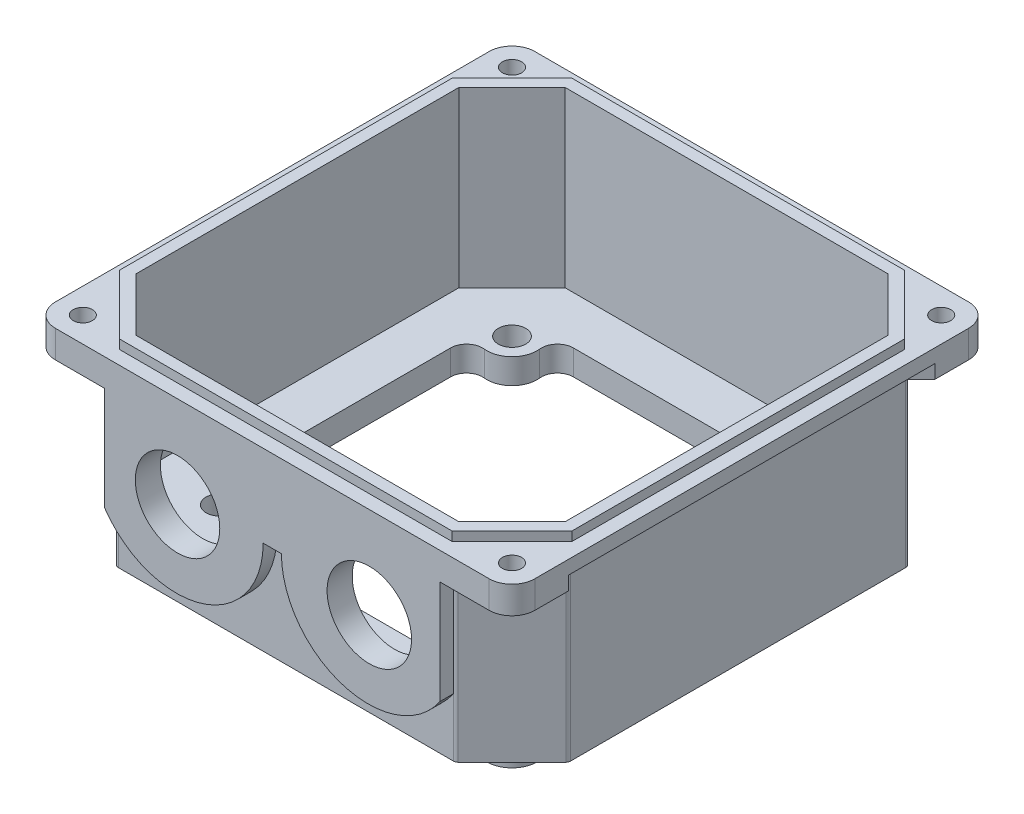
ISO-10303-21;
HEADER;
FILE_DESCRIPTION(('STEP AP214'),'2;1');
FILE_NAME('part.step','',(''),(''),'','','');
FILE_SCHEMA(('AUTOMOTIVE_DESIGN { 1 0 10303 214 1 1 1 1 }'));
ENDSEC;
DATA;
#1=APPLICATION_CONTEXT('core data for automotive mechanical design processes');
#2=APPLICATION_PROTOCOL_DEFINITION('international standard','automotive_design',2000,#1);
#3=PRODUCT_CONTEXT('',#1,'mechanical');
#4=PRODUCT('Part','Part','',(#3));
#5=PRODUCT_RELATED_PRODUCT_CATEGORY('part','',(#4));
#6=PRODUCT_DEFINITION_FORMATION('','',#4);
#7=PRODUCT_DEFINITION_CONTEXT('part definition',#1,'design');
#8=PRODUCT_DEFINITION('design','',#6,#7);
#9=PRODUCT_DEFINITION_SHAPE('','',#8);
#10=(LENGTH_UNIT() NAMED_UNIT(*) SI_UNIT(.MILLI.,.METRE.));
#11=(NAMED_UNIT(*) PLANE_ANGLE_UNIT() SI_UNIT($,.RADIAN.));
#12=(NAMED_UNIT(*) SI_UNIT($,.STERADIAN.) SOLID_ANGLE_UNIT());
#13=UNCERTAINTY_MEASURE_WITH_UNIT(LENGTH_MEASURE(1.E-05),#10,'distance_accuracy_value','');
#14=(GEOMETRIC_REPRESENTATION_CONTEXT(3) GLOBAL_UNCERTAINTY_ASSIGNED_CONTEXT((#13)) GLOBAL_UNIT_ASSIGNED_CONTEXT((#10,
#11,#12)) REPRESENTATION_CONTEXT('',''));
#15=CARTESIAN_POINT('',(0.,0.,0.));
#16=DIRECTION('',(0.,0.,1.));
#17=DIRECTION('',(1.,0.,0.));
#18=AXIS2_PLACEMENT_3D('',#15,#16,#17);
#19=CARTESIAN_POINT('',(0.,41.5,0.));
#20=DIRECTION('',(0.,1.,0.));
#21=DIRECTION('',(0.,0.,1.));
#22=AXIS2_PLACEMENT_3D('',#19,#20,#21);
#23=PLANE('',#22);
#24=DIRECTION('',(0.707106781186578,0.,-0.707106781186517));
#25=VECTOR('',#24,1.);
#26=CARTESIAN_POINT('',(36.4134739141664,41.5,49.5000000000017));
#27=LINE('',#26,#25);
#28=CARTESIAN_POINT('',(36.4134739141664,41.5,49.5000000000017));
#29=VERTEX_POINT('',#28);
#30=CARTESIAN_POINT('',(49.500000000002,41.5,36.4134739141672));
#31=VERTEX_POINT('',#30);
#32=EDGE_CURVE('E724',#29,#31,#27,.T.);
#33=ORIENTED_EDGE('',*,*,#32,.F.);
#34=DIRECTION('',(1.,0.,0.));
#35=VECTOR('',#34,1.);
#36=CARTESIAN_POINT('',(36.4134739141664,41.5,49.5000000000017));
#37=LINE('',#36,#35);
#38=CARTESIAN_POINT('',(-36.4134739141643,41.5,49.5000000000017));
#39=VERTEX_POINT('',#38);
#40=EDGE_CURVE('E722',#39,#29,#37,.T.);
#41=ORIENTED_EDGE('',*,*,#40,.F.);
#42=DIRECTION('',(0.707106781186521,0.,0.707106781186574));
#43=VECTOR('',#42,1.);
#44=CARTESIAN_POINT('',(-49.4999999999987,41.5,36.4134739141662));
#45=LINE('',#44,#43);
#46=CARTESIAN_POINT('',(-49.4999999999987,41.5,36.4134739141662));
#47=VERTEX_POINT('',#46);
#48=EDGE_CURVE('E720',#47,#39,#45,.T.);
#49=ORIENTED_EDGE('',*,*,#48,.F.);
#50=DIRECTION('',(0.,0.,1.));
#51=VECTOR('',#50,1.);
#52=CARTESIAN_POINT('',(-49.4999999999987,41.5,36.4134739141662));
#53=LINE('',#52,#51);
#54=CARTESIAN_POINT('',(-49.4999999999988,41.5,-36.4134739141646));
#55=VERTEX_POINT('',#54);
#56=EDGE_CURVE('E718',#55,#47,#53,.T.);
#57=ORIENTED_EDGE('',*,*,#56,.F.);
#58=DIRECTION('',(-0.707106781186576,0.,0.707106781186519));
#59=VECTOR('',#58,1.);
#60=CARTESIAN_POINT('',(-36.4134739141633,41.5,-49.499999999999));
#61=LINE('',#60,#59);
#62=CARTESIAN_POINT('',(-36.4134739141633,41.5,-49.499999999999));
#63=VERTEX_POINT('',#62);
#64=EDGE_CURVE('E696',#63,#55,#61,.T.);
#65=ORIENTED_EDGE('',*,*,#64,.F.);
#66=DIRECTION('',(-1.,0.,0.));
#67=VECTOR('',#66,1.);
#68=CARTESIAN_POINT('',(36.4134739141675,41.5,-49.4999999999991));
#69=LINE('',#68,#67);
#70=CARTESIAN_POINT('',(36.4134739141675,41.5,-49.4999999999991));
#71=VERTEX_POINT('',#70);
#72=EDGE_CURVE('E701',#71,#63,#69,.T.);
#73=ORIENTED_EDGE('',*,*,#72,.F.);
#74=DIRECTION('',(-0.707106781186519,0.,-0.707106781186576));
#75=VECTOR('',#74,1.);
#76=CARTESIAN_POINT('',(49.5000000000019,41.5,-36.4134739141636));
#77=LINE('',#76,#75);
#78=CARTESIAN_POINT('',(49.5000000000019,41.5,-36.4134739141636));
#79=VERTEX_POINT('',#78);
#80=EDGE_CURVE('E728',#79,#71,#77,.T.);
#81=ORIENTED_EDGE('',*,*,#80,.F.);
#82=DIRECTION('',(0.,0.,-1.));
#83=VECTOR('',#82,1.);
#84=CARTESIAN_POINT('',(49.500000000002,41.5,36.4134739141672));
#85=LINE('',#84,#83);
#86=EDGE_CURVE('E726',#31,#79,#85,.T.);
#87=ORIENTED_EDGE('',*,*,#86,.F.);
#88=EDGE_LOOP('',(#33,#41,#49,#57,#65,#73,#81,#87));
#89=FACE_BOUND('',#88,.T.);
#90=DIRECTION('',(1.,0.,0.));
#91=VECTOR('',#90,1.);
#92=CARTESIAN_POINT('',(52.5,41.5,52.5));
#93=LINE('',#92,#91);
#94=CARTESIAN_POINT('',(-47.5,41.5,52.5));
#95=VERTEX_POINT('',#94);
#96=CARTESIAN_POINT('',(47.5,41.5,52.5));
#97=VERTEX_POINT('',#96);
#98=EDGE_CURVE('E958',#95,#97,#93,.T.);
#99=ORIENTED_EDGE('',*,*,#98,.T.);
#100=CARTESIAN_POINT('',(47.5,41.5,47.5));
#101=DIRECTION('',(0.,1.,0.));
#102=DIRECTION('',(0.,0.,1.));
#103=AXIS2_PLACEMENT_3D('',#100,#101,#102);
#104=CIRCLE('',#103,5.);
#105=CARTESIAN_POINT('',(52.5,41.5,47.5));
#106=VERTEX_POINT('',#105);
#107=EDGE_CURVE('E1306',#97,#106,#104,.T.);
#108=ORIENTED_EDGE('',*,*,#107,.T.);
#109=DIRECTION('',(0.,0.,-1.));
#110=VECTOR('',#109,1.);
#111=CARTESIAN_POINT('',(52.5,41.5,52.5));
#112=LINE('',#111,#110);
#113=CARTESIAN_POINT('',(52.5,41.5,-47.5));
#114=VERTEX_POINT('',#113);
#115=EDGE_CURVE('E961',#106,#114,#112,.T.);
#116=ORIENTED_EDGE('',*,*,#115,.T.);
#117=CARTESIAN_POINT('',(47.5,41.5,-47.5));
#118=DIRECTION('',(0.,1.,0.));
#119=DIRECTION('',(0.,0.,1.));
#120=AXIS2_PLACEMENT_3D('',#117,#118,#119);
#121=CIRCLE('',#120,5.);
#122=CARTESIAN_POINT('',(47.5,41.5,-52.5));
#123=VERTEX_POINT('',#122);
#124=EDGE_CURVE('E1304',#114,#123,#121,.T.);
#125=ORIENTED_EDGE('',*,*,#124,.T.);
#126=DIRECTION('',(-1.,0.,0.));
#127=VECTOR('',#126,1.);
#128=CARTESIAN_POINT('',(52.5,41.5,-52.5));
#129=LINE('',#128,#127);
#130=CARTESIAN_POINT('',(-47.5,41.5,-52.5));
#131=VERTEX_POINT('',#130);
#132=EDGE_CURVE('E964',#123,#131,#129,.T.);
#133=ORIENTED_EDGE('',*,*,#132,.T.);
#134=CARTESIAN_POINT('',(-47.5,41.5,-47.5));
#135=DIRECTION('',(0.,1.,0.));
#136=DIRECTION('',(0.,0.,1.));
#137=AXIS2_PLACEMENT_3D('',#134,#135,#136);
#138=CIRCLE('',#137,5.);
#139=CARTESIAN_POINT('',(-52.5,41.5,-47.5));
#140=VERTEX_POINT('',#139);
#141=EDGE_CURVE('E1302',#131,#140,#138,.T.);
#142=ORIENTED_EDGE('',*,*,#141,.T.);
#143=DIRECTION('',(0.,0.,1.));
#144=VECTOR('',#143,1.);
#145=CARTESIAN_POINT('',(-52.5,41.5,52.5));
#146=LINE('',#145,#144);
#147=CARTESIAN_POINT('',(-52.5,41.5,47.5));
#148=VERTEX_POINT('',#147);
#149=EDGE_CURVE('E956',#140,#148,#146,.T.);
#150=ORIENTED_EDGE('',*,*,#149,.T.);
#151=CARTESIAN_POINT('',(-47.5,41.5,47.5));
#152=DIRECTION('',(0.,1.,0.));
#153=DIRECTION('',(0.,0.,1.));
#154=AXIS2_PLACEMENT_3D('',#151,#152,#153);
#155=CIRCLE('',#154,5.);
#156=EDGE_CURVE('E1292',#148,#95,#155,.T.);
#157=ORIENTED_EDGE('',*,*,#156,.T.);
#158=EDGE_LOOP('',(#99,#108,#116,#125,#133,#142,#150,#157));
#159=FACE_BOUND('',#158,.T.);
#160=CARTESIAN_POINT('',(-47.,41.5,47.));
#161=DIRECTION('',(0.,1.,0.));
#162=DIRECTION('',(0.,0.,1.));
#163=AXIS2_PLACEMENT_3D('',#160,#161,#162);
#164=CIRCLE('',#163,2.1);
#165=CARTESIAN_POINT('',(-47.,41.5,49.1));
#166=VERTEX_POINT('',#165);
#167=EDGE_CURVE('E632',#166,#166,#164,.T.);
#168=ORIENTED_EDGE('',*,*,#167,.F.);
#169=EDGE_LOOP('',(#168));
#170=FACE_BOUND('',#169,.T.);
#171=CARTESIAN_POINT('',(-47.,41.5,-47.));
#172=DIRECTION('',(0.,1.,0.));
#173=DIRECTION('',(0.,0.,1.));
#174=AXIS2_PLACEMENT_3D('',#171,#172,#173);
#175=CIRCLE('',#174,2.1);
#176=CARTESIAN_POINT('',(-47.,41.5,-44.9));
#177=VERTEX_POINT('',#176);
#178=EDGE_CURVE('E654',#177,#177,#175,.T.);
#179=ORIENTED_EDGE('',*,*,#178,.F.);
#180=EDGE_LOOP('',(#179));
#181=FACE_BOUND('',#180,.T.);
#182=CARTESIAN_POINT('',(47.,41.5,47.));
#183=DIRECTION('',(0.,1.,0.));
#184=DIRECTION('',(0.,0.,1.));
#185=AXIS2_PLACEMENT_3D('',#182,#183,#184);
#186=CIRCLE('',#185,2.1);
#187=CARTESIAN_POINT('',(47.,41.5,49.1));
#188=VERTEX_POINT('',#187);
#189=EDGE_CURVE('E660',#188,#188,#186,.T.);
#190=ORIENTED_EDGE('',*,*,#189,.F.);
#191=EDGE_LOOP('',(#190));
#192=FACE_BOUND('',#191,.T.);
#193=CARTESIAN_POINT('',(47.,41.5,-47.));
#194=DIRECTION('',(0.,1.,0.));
#195=DIRECTION('',(0.,0.,1.));
#196=AXIS2_PLACEMENT_3D('',#193,#194,#195);
#197=CIRCLE('',#196,2.1);
#198=CARTESIAN_POINT('',(47.,41.5,-44.9));
#199=VERTEX_POINT('',#198);
#200=EDGE_CURVE('E666',#199,#199,#197,.T.);
#201=ORIENTED_EDGE('',*,*,#200,.F.);
#202=EDGE_LOOP('',(#201));
#203=FACE_BOUND('',#202,.T.);
#204=ADVANCED_FACE('F37',(#89,#159,#170,#181,#192,#203),#23,.T.);
#205=CARTESIAN_POINT('',(0.,38.5,0.));
#206=DIRECTION('',(0.,1.,0.));
#207=DIRECTION('',(0.,0.,1.));
#208=AXIS2_PLACEMENT_3D('',#205,#206,#207);
#209=PLANE('',#208);
#210=DIRECTION('',(0.707106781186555,0.,-0.70710678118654));
#211=VECTOR('',#210,1.);
#212=CARTESIAN_POINT('',(-49.4999999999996,38.5,37.1205806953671));
#213=LINE('',#212,#211);
#214=CARTESIAN_POINT('',(-52.4999999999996,38.5,40.120580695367));
#215=VERTEX_POINT('',#214);
#216=CARTESIAN_POINT('',(-49.4999999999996,38.5,37.1205806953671));
#217=VERTEX_POINT('',#216);
#218=EDGE_CURVE('E850',#215,#217,#213,.T.);
#219=ORIENTED_EDGE('',*,*,#218,.F.);
#220=DIRECTION('',(0.,0.,1.));
#221=VECTOR('',#220,1.);
#222=CARTESIAN_POINT('',(-52.5,38.5,52.5));
#223=LINE('',#222,#221);
#224=CARTESIAN_POINT('',(-52.4999999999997,38.5,-40.120580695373));
#225=VERTEX_POINT('',#224);
#226=EDGE_CURVE('E955',#225,#215,#223,.T.);
#227=ORIENTED_EDGE('',*,*,#226,.F.);
#228=DIRECTION('',(-0.707106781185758,0.,-0.707106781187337));
#229=VECTOR('',#228,1.);
#230=CARTESIAN_POINT('',(-49.5000000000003,38.5,-37.1205806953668));
#231=LINE('',#230,#229);
#232=CARTESIAN_POINT('',(-49.5000000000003,38.5,-37.1205806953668));
#233=VERTEX_POINT('',#232);
#234=EDGE_CURVE('E871',#233,#225,#231,.T.);
#235=ORIENTED_EDGE('',*,*,#234,.F.);
#236=DIRECTION('',(0.,0.,-1.));
#237=VECTOR('',#236,1.);
#238=CARTESIAN_POINT('',(-49.5,38.5,-49.5));
#239=LINE('',#238,#237);
#240=EDGE_CURVE('E941',#217,#233,#239,.T.);
#241=ORIENTED_EDGE('',*,*,#240,.F.);
#242=EDGE_LOOP('',(#219,#227,#235,#241));
#243=FACE_BOUND('',#242,.T.);
#244=ADVANCED_FACE('F1334',(#243),#209,.F.);
#245=DIRECTION('',(0.707106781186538,0.,0.707106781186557));
#246=VECTOR('',#245,1.);
#247=CARTESIAN_POINT('',(-37.120580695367,38.5,-49.4999999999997));
#248=LINE('',#247,#246);
#249=CARTESIAN_POINT('',(-40.1205806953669,38.5,-52.4999999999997));
#250=VERTEX_POINT('',#249);
#251=CARTESIAN_POINT('',(-37.1205806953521,38.5,-49.5));
#252=VERTEX_POINT('',#251);
#253=EDGE_CURVE('E866',#250,#252,#248,.T.);
#254=ORIENTED_EDGE('',*,*,#253,.F.);
#255=DIRECTION('',(-1.,0.,0.));
#256=VECTOR('',#255,1.);
#257=CARTESIAN_POINT('',(52.5,38.5,-52.5));
#258=LINE('',#257,#256);
#259=CARTESIAN_POINT('',(40.1205806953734,38.5,-52.4999999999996));
#260=VERTEX_POINT('',#259);
#261=EDGE_CURVE('E959',#260,#250,#258,.T.);
#262=ORIENTED_EDGE('',*,*,#261,.F.);
#263=DIRECTION('',(0.707106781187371,0.,-0.707106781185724));
#264=VECTOR('',#263,1.);
#265=CARTESIAN_POINT('',(37.120580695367,38.5,-49.5000000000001));
#266=LINE('',#265,#264);
#267=CARTESIAN_POINT('',(37.120580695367,38.5,-49.5000000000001));
#268=VERTEX_POINT('',#267);
#269=EDGE_CURVE('E896',#268,#260,#266,.T.);
#270=ORIENTED_EDGE('',*,*,#269,.F.);
#271=DIRECTION('',(1.,0.,0.));
#272=VECTOR('',#271,1.);
#273=CARTESIAN_POINT('',(-49.5,38.5,-49.5));
#274=LINE('',#273,#272);
#275=EDGE_CURVE('E935',#252,#268,#274,.T.);
#276=ORIENTED_EDGE('',*,*,#275,.F.);
#277=EDGE_LOOP('',(#254,#262,#270,#276));
#278=FACE_BOUND('',#277,.T.);
#279=ADVANCED_FACE('F1391',(#278),#209,.F.);
#280=DIRECTION('',(-0.707106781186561,0.,0.707106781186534));
#281=VECTOR('',#280,1.);
#282=CARTESIAN_POINT('',(49.4999999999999,38.5,-37.1205806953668));
#283=LINE('',#282,#281);
#284=CARTESIAN_POINT('',(52.4999999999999,38.5,-40.1205806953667));
#285=VERTEX_POINT('',#284);
#286=CARTESIAN_POINT('',(49.5,38.5,-37.1205806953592));
#287=VERTEX_POINT('',#286);
#288=EDGE_CURVE('E891',#285,#287,#283,.T.);
#289=ORIENTED_EDGE('',*,*,#288,.F.);
#290=DIRECTION('',(0.,0.,-1.));
#291=VECTOR('',#290,1.);
#292=CARTESIAN_POINT('',(52.5,38.5,52.5));
#293=LINE('',#292,#291);
#294=CARTESIAN_POINT('',(52.5,38.5,40.1205806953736));
#295=VERTEX_POINT('',#294);
#296=EDGE_CURVE('E970',#295,#285,#293,.T.);
#297=ORIENTED_EDGE('',*,*,#296,.F.);
#298=DIRECTION('',(0.707106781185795,0.,0.7071067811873));
#299=VECTOR('',#298,1.);
#300=CARTESIAN_POINT('',(49.5,38.5,37.1205806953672));
#301=LINE('',#300,#299);
#302=CARTESIAN_POINT('',(49.5,38.5,37.1205806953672));
#303=VERTEX_POINT('',#302);
#304=EDGE_CURVE('E916',#303,#295,#301,.T.);
#305=ORIENTED_EDGE('',*,*,#304,.F.);
#306=DIRECTION('',(0.,0.,1.));
#307=VECTOR('',#306,1.);
#308=CARTESIAN_POINT('',(49.5,38.5,-49.5));
#309=LINE('',#308,#307);
#310=EDGE_CURVE('E938',#287,#303,#309,.T.);
#311=ORIENTED_EDGE('',*,*,#310,.F.);
#312=EDGE_LOOP('',(#289,#297,#305,#311));
#313=FACE_BOUND('',#312,.T.);
#314=ADVANCED_FACE('F1393',(#313),#209,.F.);
#315=CARTESIAN_POINT('',(52.5000000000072,-2.,34.1205806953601));
#316=DIRECTION('',(-0.707106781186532,0.,-0.707106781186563));
#317=DIRECTION('',(-0.707106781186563,0.,0.707106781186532));
#318=AXIS2_PLACEMENT_3D('',#315,#316,#317);
#319=PLANE('',#318);
#320=DIRECTION('',(0.707106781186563,0.,-0.707106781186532));
#321=VECTOR('',#320,1.);
#322=CARTESIAN_POINT('',(43.3102903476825,0.,43.3102903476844));
#323=LINE('',#322,#321);
#324=CARTESIAN_POINT('',(37.4134739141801,0.,49.2071067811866));
#325=VERTEX_POINT('',#324);
#326=CARTESIAN_POINT('',(49.2071067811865,0.,37.4134739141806));
#327=VERTEX_POINT('',#326);
#328=EDGE_CURVE('E977',#325,#327,#323,.T.);
#329=ORIENTED_EDGE('',*,*,#328,.T.);
#330=DIRECTION('',(0.,-1.,0.));
#331=VECTOR('',#330,1.);
#332=CARTESIAN_POINT('',(49.2071067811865,35.5,37.4134739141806));
#333=LINE('',#332,#331);
#334=CARTESIAN_POINT('',(49.2071067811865,35.5,37.4134739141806));
#335=VERTEX_POINT('',#334);
#336=EDGE_CURVE('E1232',#327,#335,#333,.F.);
#337=ORIENTED_EDGE('',*,*,#336,.T.);
#338=DIRECTION('',(0.707106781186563,0.,-0.707106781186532));
#339=VECTOR('',#338,1.);
#340=CARTESIAN_POINT('',(49.5,35.5,37.1205806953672));
#341=LINE('',#340,#339);
#342=CARTESIAN_POINT('',(37.4134739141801,35.5,49.2071067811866));
#343=VERTEX_POINT('',#342);
#344=EDGE_CURVE('E917',#343,#335,#341,.T.);
#345=ORIENTED_EDGE('',*,*,#344,.F.);
#346=DIRECTION('',(0.,1.,0.));
#347=VECTOR('',#346,1.);
#348=CARTESIAN_POINT('',(37.4134739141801,0.,49.2071067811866));
#349=LINE('',#348,#347);
#350=EDGE_CURVE('E1230',#343,#325,#349,.F.);
#351=ORIENTED_EDGE('',*,*,#350,.T.);
#352=EDGE_LOOP('',(#329,#337,#345,#351));
#353=FACE_BOUND('',#352,.T.);
#354=ADVANCED_FACE('F1399',(#353),#319,.F.);
#355=CARTESIAN_POINT('',(0.,0.,0.));
#356=DIRECTION('',(0.,-1.,0.));
#357=DIRECTION('',(0.,0.,-1.));
#358=AXIS2_PLACEMENT_3D('',#355,#356,#357);
#359=PLANE('',#358);
#360=DIRECTION('',(1.,0.,0.));
#361=VECTOR('',#360,1.);
#362=CARTESIAN_POINT('',(-38.5,0.,-44.));
#363=LINE('',#362,#361);
#364=CARTESIAN_POINT('',(-38.5,0.,-44.));
#365=VERTEX_POINT('',#364);
#366=CARTESIAN_POINT('',(38.5,0.,-44.));
#367=VERTEX_POINT('',#366);
#368=EDGE_CURVE('E1157',#365,#367,#363,.T.);
#369=ORIENTED_EDGE('',*,*,#368,.F.);
#370=CARTESIAN_POINT('',(-38.5,0.,-38.5));
#371=DIRECTION('',(0.,-1.,0.));
#372=DIRECTION('',(0.,0.,1.));
#373=AXIS2_PLACEMENT_3D('',#370,#371,#372);
#374=CIRCLE('',#373,5.5);
#375=CARTESIAN_POINT('',(-44.,0.,-38.5));
#376=VERTEX_POINT('',#375);
#377=EDGE_CURVE('E1135',#376,#365,#374,.T.);
#378=ORIENTED_EDGE('',*,*,#377,.F.);
#379=DIRECTION('',(0.,0.,-1.));
#380=VECTOR('',#379,1.);
#381=CARTESIAN_POINT('',(-44.,0.,-38.5));
#382=LINE('',#381,#380);
#383=CARTESIAN_POINT('',(-44.,0.,38.5));
#384=VERTEX_POINT('',#383);
#385=EDGE_CURVE('E1140',#384,#376,#382,.T.);
#386=ORIENTED_EDGE('',*,*,#385,.F.);
#387=CARTESIAN_POINT('',(-38.5,0.,38.5));
#388=DIRECTION('',(0.,-1.,0.));
#389=DIRECTION('',(0.,0.,1.));
#390=AXIS2_PLACEMENT_3D('',#387,#388,#389);
#391=CIRCLE('',#390,5.5);
#392=CARTESIAN_POINT('',(-38.5,0.,44.));
#393=VERTEX_POINT('',#392);
#394=EDGE_CURVE('E1167',#393,#384,#391,.T.);
#395=ORIENTED_EDGE('',*,*,#394,.F.);
#396=DIRECTION('',(-1.,0.,0.));
#397=VECTOR('',#396,1.);
#398=CARTESIAN_POINT('',(-38.5,0.,44.));
#399=LINE('',#398,#397);
#400=CARTESIAN_POINT('',(38.5,0.,44.));
#401=VERTEX_POINT('',#400);
#402=EDGE_CURVE('E1165',#401,#393,#399,.T.);
#403=ORIENTED_EDGE('',*,*,#402,.F.);
#404=CARTESIAN_POINT('',(38.5,0.,38.5));
#405=DIRECTION('',(0.,-1.,0.));
#406=DIRECTION('',(0.,0.,1.));
#407=AXIS2_PLACEMENT_3D('',#404,#405,#406);
#408=CIRCLE('',#407,5.5);
#409=CARTESIAN_POINT('',(44.,0.,38.5));
#410=VERTEX_POINT('',#409);
#411=EDGE_CURVE('E1163',#410,#401,#408,.T.);
#412=ORIENTED_EDGE('',*,*,#411,.F.);
#413=DIRECTION('',(0.,0.,1.));
#414=VECTOR('',#413,1.);
#415=CARTESIAN_POINT('',(44.,0.,-38.5));
#416=LINE('',#415,#414);
#417=CARTESIAN_POINT('',(44.,0.,-38.5));
#418=VERTEX_POINT('',#417);
#419=EDGE_CURVE('E1161',#418,#410,#416,.T.);
#420=ORIENTED_EDGE('',*,*,#419,.F.);
#421=CARTESIAN_POINT('',(38.5,0.,-38.5));
#422=DIRECTION('',(0.,-1.,0.));
#423=DIRECTION('',(0.,0.,-1.));
#424=AXIS2_PLACEMENT_3D('',#421,#422,#423);
#425=CIRCLE('',#424,5.50000000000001);
#426=EDGE_CURVE('E1159',#367,#418,#425,.T.);
#427=ORIENTED_EDGE('',*,*,#426,.F.);
#428=EDGE_LOOP('',(#369,#378,#386,#395,#403,#412,#420,#427));
#429=FACE_BOUND('',#428,.T.);
#430=DIRECTION('',(0.,0.,-1.));
#431=VECTOR('',#430,1.);
#432=CARTESIAN_POINT('',(-49.5,0.,-49.5));
#433=LINE('',#432,#431);
#434=CARTESIAN_POINT('',(-49.5,0.,36.7063671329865));
#435=VERTEX_POINT('',#434);
#436=CARTESIAN_POINT('',(-49.5,0.,-36.7063671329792));
#437=VERTEX_POINT('',#436);
#438=EDGE_CURVE('E929',#435,#437,#433,.T.);
#439=ORIENTED_EDGE('',*,*,#438,.T.);
#440=CARTESIAN_POINT('',(-48.5,0.,-36.7063671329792));
#441=DIRECTION('',(0.,-1.,0.));
#442=DIRECTION('',(0.,0.,-1.));
#443=AXIS2_PLACEMENT_3D('',#440,#441,#442);
#444=CIRCLE('',#443,1.);
#445=CARTESIAN_POINT('',(-49.2071067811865,0.,-37.4134739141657));
#446=VERTEX_POINT('',#445);
#447=EDGE_CURVE('E1270',#437,#446,#444,.T.);
#448=ORIENTED_EDGE('',*,*,#447,.T.);
#449=DIRECTION('',(-0.707106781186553,0.,0.707106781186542));
#450=VECTOR('',#449,1.);
#451=CARTESIAN_POINT('',(-43.3102903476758,0.,-43.3102903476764));
#452=LINE('',#451,#450);
#453=CARTESIAN_POINT('',(-37.4134739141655,0.,-49.2071067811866));
#454=VERTEX_POINT('',#453);
#455=EDGE_CURVE('E983',#454,#446,#452,.T.);
#456=ORIENTED_EDGE('',*,*,#455,.F.);
#457=CARTESIAN_POINT('',(-36.706367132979,0.,-48.5));
#458=DIRECTION('',(0.,-1.,0.));
#459=DIRECTION('',(0.,0.,-1.));
#460=AXIS2_PLACEMENT_3D('',#457,#458,#459);
#461=CIRCLE('',#460,1.);
#462=CARTESIAN_POINT('',(-36.706367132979,0.,-49.5));
#463=VERTEX_POINT('',#462);
#464=EDGE_CURVE('E1268',#454,#463,#461,.T.);
#465=ORIENTED_EDGE('',*,*,#464,.T.);
#466=DIRECTION('',(1.,0.,0.));
#467=VECTOR('',#466,1.);
#468=CARTESIAN_POINT('',(-49.5,0.,-49.5));
#469=LINE('',#468,#467);
#470=CARTESIAN_POINT('',(36.7063671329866,0.,-49.5));
#471=VERTEX_POINT('',#470);
#472=EDGE_CURVE('E927',#463,#471,#469,.T.);
#473=ORIENTED_EDGE('',*,*,#472,.T.);
#474=CARTESIAN_POINT('',(36.7063671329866,0.,-48.5));
#475=DIRECTION('',(0.,-1.,0.));
#476=DIRECTION('',(0.,0.,-1.));
#477=AXIS2_PLACEMENT_3D('',#474,#475,#476);
#478=CIRCLE('',#477,1.);
#479=CARTESIAN_POINT('',(37.4134739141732,0.,-49.2071067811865));
#480=VERTEX_POINT('',#479);
#481=EDGE_CURVE('E1213',#471,#480,#478,.T.);
#482=ORIENTED_EDGE('',*,*,#481,.T.);
#483=DIRECTION('',(-0.707106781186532,0.,-0.707106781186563));
#484=VECTOR('',#483,1.);
#485=CARTESIAN_POINT('',(43.3102903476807,0.,-43.3102903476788));
#486=LINE('',#485,#484);
#487=CARTESIAN_POINT('',(49.2071067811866,0.,-37.4134739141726));
#488=VERTEX_POINT('',#487);
#489=EDGE_CURVE('E967',#488,#480,#486,.T.);
#490=ORIENTED_EDGE('',*,*,#489,.F.);
#491=CARTESIAN_POINT('',(48.5,0.,-36.7063671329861));
#492=DIRECTION('',(0.,-1.,0.));
#493=DIRECTION('',(0.,0.,-1.));
#494=AXIS2_PLACEMENT_3D('',#491,#492,#493);
#495=CIRCLE('',#494,1.);
#496=CARTESIAN_POINT('',(49.5,0.,-36.7063671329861));
#497=VERTEX_POINT('',#496);
#498=EDGE_CURVE('E1211',#488,#497,#495,.T.);
#499=ORIENTED_EDGE('',*,*,#498,.T.);
#500=DIRECTION('',(0.,0.,1.));
#501=VECTOR('',#500,1.);
#502=CARTESIAN_POINT('',(49.5,0.,-49.5));
#503=LINE('',#502,#501);
#504=CARTESIAN_POINT('',(49.5,0.,36.706367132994));
#505=VERTEX_POINT('',#504);
#506=EDGE_CURVE('E926',#497,#505,#503,.T.);
#507=ORIENTED_EDGE('',*,*,#506,.T.);
#508=CARTESIAN_POINT('',(48.5,0.,36.706367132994));
#509=DIRECTION('',(0.,-1.,0.));
#510=DIRECTION('',(0.,0.,-1.));
#511=AXIS2_PLACEMENT_3D('',#508,#509,#510);
#512=CIRCLE('',#511,1.);
#513=EDGE_CURVE('E1209',#505,#327,#512,.T.);
#514=ORIENTED_EDGE('',*,*,#513,.T.);
#515=ORIENTED_EDGE('',*,*,#328,.F.);
#516=CARTESIAN_POINT('',(36.7063671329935,0.,48.5));
#517=DIRECTION('',(0.,-1.,0.));
#518=DIRECTION('',(0.,0.,-1.));
#519=AXIS2_PLACEMENT_3D('',#516,#517,#518);
#520=CIRCLE('',#519,1.);
#521=CARTESIAN_POINT('',(36.7063671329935,0.,49.5));
#522=VERTEX_POINT('',#521);
#523=EDGE_CURVE('E1207',#325,#522,#520,.T.);
#524=ORIENTED_EDGE('',*,*,#523,.T.);
#525=DIRECTION('',(-1.,0.,0.));
#526=VECTOR('',#525,1.);
#527=CARTESIAN_POINT('',(-49.5,0.,49.5));
#528=LINE('',#527,#526);
#529=CARTESIAN_POINT('',(-36.706367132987,0.,49.5));
#530=VERTEX_POINT('',#529);
#531=EDGE_CURVE('E932',#522,#530,#528,.T.);
#532=ORIENTED_EDGE('',*,*,#531,.T.);
#533=CARTESIAN_POINT('',(-36.706367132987,0.,48.5));
#534=DIRECTION('',(0.,-1.,0.));
#535=DIRECTION('',(0.,0.,-1.));
#536=AXIS2_PLACEMENT_3D('',#533,#534,#535);
#537=CIRCLE('',#536,1.);
#538=CARTESIAN_POINT('',(-37.4134739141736,0.,49.2071067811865));
#539=VERTEX_POINT('',#538);
#540=EDGE_CURVE('E1205',#530,#539,#537,.T.);
#541=ORIENTED_EDGE('',*,*,#540,.T.);
#542=DIRECTION('',(0.707106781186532,0.,0.707106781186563));
#543=VECTOR('',#542,1.);
#544=CARTESIAN_POINT('',(-43.3102903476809,0.,43.310290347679));
#545=LINE('',#544,#543);
#546=CARTESIAN_POINT('',(-49.2071067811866,0.,37.413473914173));
#547=VERTEX_POINT('',#546);
#548=EDGE_CURVE('E980',#547,#539,#545,.T.);
#549=ORIENTED_EDGE('',*,*,#548,.F.);
#550=CARTESIAN_POINT('',(-48.5,0.,36.7063671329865));
#551=DIRECTION('',(0.,-1.,0.));
#552=DIRECTION('',(0.,0.,-1.));
#553=AXIS2_PLACEMENT_3D('',#550,#551,#552);
#554=CIRCLE('',#553,1.);
#555=EDGE_CURVE('E1203',#547,#435,#554,.T.);
#556=ORIENTED_EDGE('',*,*,#555,.T.);
#557=EDGE_LOOP('',(#439,#448,#456,#465,#473,#482,#490,#499,#507,#514,#515,#524,#532,#541,#549,#556));
#558=FACE_BOUND('',#557,.T.);
#559=ADVANCED_FACE('F1402',(#429,#558),#359,.T.);
#560=CARTESIAN_POINT('',(34.1205806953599,-2.,-52.5));
#561=DIRECTION('',(-0.707106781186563,0.,0.707106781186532));
#562=DIRECTION('',(0.707106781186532,0.,0.707106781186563));
#563=AXIS2_PLACEMENT_3D('',#560,#561,#562);
#564=PLANE('',#563);
#565=ORIENTED_EDGE('',*,*,#489,.T.);
#566=DIRECTION('',(0.,-1.,0.));
#567=VECTOR('',#566,1.);
#568=CARTESIAN_POINT('',(37.4134739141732,35.5,-49.2071067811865));
#569=LINE('',#568,#567);
#570=CARTESIAN_POINT('',(37.4134739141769,35.5,-49.2071067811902));
#571=VERTEX_POINT('',#570);
#572=EDGE_CURVE('E1217',#480,#571,#569,.F.);
#573=ORIENTED_EDGE('',*,*,#572,.T.);
#574=DIRECTION('',(-0.707106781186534,0.,-0.707106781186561));
#575=VECTOR('',#574,1.);
#576=CARTESIAN_POINT('',(37.120580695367,35.5,-49.5000000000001));
#577=LINE('',#576,#575);
#578=CARTESIAN_POINT('',(49.2071067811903,35.5,-37.4134739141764));
#579=VERTEX_POINT('',#578);
#580=EDGE_CURVE('E895',#579,#571,#577,.T.);
#581=ORIENTED_EDGE('',*,*,#580,.F.);
#582=DIRECTION('',(0.,1.,0.));
#583=VECTOR('',#582,1.);
#584=CARTESIAN_POINT('',(49.2071067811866,0.,-37.4134739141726));
#585=LINE('',#584,#583);
#586=EDGE_CURVE('E1215',#579,#488,#585,.F.);
#587=ORIENTED_EDGE('',*,*,#586,.T.);
#588=EDGE_LOOP('',(#565,#573,#581,#587));
#589=FACE_BOUND('',#588,.T.);
#590=ADVANCED_FACE('F1408',(#589),#564,.F.);
#591=CARTESIAN_POINT('',(-34.1205806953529,-2.,52.5000000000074));
#592=DIRECTION('',(0.707106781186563,0.,-0.707106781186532));
#593=DIRECTION('',(-0.707106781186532,0.,-0.707106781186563));
#594=AXIS2_PLACEMENT_3D('',#591,#592,#593);
#595=PLANE('',#594);
#596=ORIENTED_EDGE('',*,*,#548,.T.);
#597=DIRECTION('',(0.,-1.,0.));
#598=VECTOR('',#597,1.);
#599=CARTESIAN_POINT('',(-37.4134739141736,35.5,49.2071067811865));
#600=LINE('',#599,#598);
#601=CARTESIAN_POINT('',(-37.413473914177,35.5,49.20710678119));
#602=VERTEX_POINT('',#601);
#603=EDGE_CURVE('E1242',#539,#602,#600,.F.);
#604=ORIENTED_EDGE('',*,*,#603,.T.);
#605=DIRECTION('',(0.70710678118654,0.,0.707106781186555));
#606=VECTOR('',#605,1.);
#607=CARTESIAN_POINT('',(-37.1205806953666,35.5,49.5000000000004));
#608=LINE('',#607,#606);
#609=CARTESIAN_POINT('',(-49.2071067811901,35.5,37.4134739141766));
#610=VERTEX_POINT('',#609);
#611=EDGE_CURVE('E854',#610,#602,#608,.T.);
#612=ORIENTED_EDGE('',*,*,#611,.F.);
#613=DIRECTION('',(0.,1.,0.));
#614=VECTOR('',#613,1.);
#615=CARTESIAN_POINT('',(-49.2071067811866,0.,37.413473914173));
#616=LINE('',#615,#614);
#617=EDGE_CURVE('E1240',#610,#547,#616,.F.);
#618=ORIENTED_EDGE('',*,*,#617,.T.);
#619=EDGE_LOOP('',(#596,#604,#612,#618));
#620=FACE_BOUND('',#619,.T.);
#621=ADVANCED_FACE('F1404',(#620),#595,.F.);
#622=CARTESIAN_POINT('',(-52.4999999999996,-2.,-34.1205806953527));
#623=DIRECTION('',(0.707106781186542,0.,0.707106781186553));
#624=DIRECTION('',(0.707106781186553,0.,-0.707106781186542));
#625=AXIS2_PLACEMENT_3D('',#622,#623,#624);
#626=PLANE('',#625);
#627=ORIENTED_EDGE('',*,*,#455,.T.);
#628=DIRECTION('',(0.,-1.,0.));
#629=VECTOR('',#628,1.);
#630=CARTESIAN_POINT('',(-49.2071067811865,35.5,-37.4134739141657));
#631=LINE('',#630,#629);
#632=CARTESIAN_POINT('',(-49.2071067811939,35.5,-37.4134739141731));
#633=VERTEX_POINT('',#632);
#634=EDGE_CURVE('E1274',#446,#633,#631,.F.);
#635=ORIENTED_EDGE('',*,*,#634,.T.);
#636=DIRECTION('',(-0.707106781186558,0.,0.707106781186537));
#637=VECTOR('',#636,1.);
#638=CARTESIAN_POINT('',(-49.5000000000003,35.5,-37.1205806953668));
#639=LINE('',#638,#637);
#640=CARTESIAN_POINT('',(-37.4134739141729,35.5,-49.2071067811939));
#641=VERTEX_POINT('',#640);
#642=EDGE_CURVE('E870',#641,#633,#639,.T.);
#643=ORIENTED_EDGE('',*,*,#642,.F.);
#644=DIRECTION('',(0.,1.,0.));
#645=VECTOR('',#644,1.);
#646=CARTESIAN_POINT('',(-37.4134739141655,0.,-49.2071067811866));
#647=LINE('',#646,#645);
#648=EDGE_CURVE('E1272',#641,#454,#647,.F.);
#649=ORIENTED_EDGE('',*,*,#648,.T.);
#650=EDGE_LOOP('',(#627,#635,#643,#649));
#651=FACE_BOUND('',#650,.T.);
#652=ADVANCED_FACE('F1407',(#651),#626,.F.);
#653=CARTESIAN_POINT('',(52.5,38.5,52.5));
#654=DIRECTION('',(-1.,0.,0.));
#655=DIRECTION('',(0.,0.,1.));
#656=AXIS2_PLACEMENT_3D('',#653,#654,#655);
#657=PLANE('',#656);
#658=ORIENTED_EDGE('',*,*,#115,.F.);
#659=DIRECTION('',(0.,-1.,0.));
#660=VECTOR('',#659,1.);
#661=CARTESIAN_POINT('',(52.5,38.5,47.5));
#662=LINE('',#661,#660);
#663=CARTESIAN_POINT('',(52.5,35.5,47.5));
#664=VERTEX_POINT('',#663);
#665=EDGE_CURVE('E1296',#106,#664,#662,.T.);
#666=ORIENTED_EDGE('',*,*,#665,.T.);
#667=DIRECTION('',(0.,0.,1.));
#668=VECTOR('',#667,1.);
#669=CARTESIAN_POINT('',(52.5,35.5,52.5));
#670=LINE('',#669,#668);
#671=CARTESIAN_POINT('',(52.5,35.5,40.1205806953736));
#672=VERTEX_POINT('',#671);
#673=EDGE_CURVE('E599',#672,#664,#670,.T.);
#674=ORIENTED_EDGE('',*,*,#673,.F.);
#675=DIRECTION('',(0.,1.,0.));
#676=VECTOR('',#675,1.);
#677=CARTESIAN_POINT('',(52.5,35.5,40.1205806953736));
#678=LINE('',#677,#676);
#679=EDGE_CURVE('E598',#672,#295,#678,.T.);
#680=ORIENTED_EDGE('',*,*,#679,.T.);
#681=ORIENTED_EDGE('',*,*,#296,.T.);
#682=DIRECTION('',(0.,1.,0.));
#683=VECTOR('',#682,1.);
#684=CARTESIAN_POINT('',(52.4999999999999,35.5,-40.1205806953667));
#685=LINE('',#684,#683);
#686=CARTESIAN_POINT('',(52.4999999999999,35.5,-40.1205806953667));
#687=VERTEX_POINT('',#686);
#688=EDGE_CURVE('E906',#687,#285,#685,.T.);
#689=ORIENTED_EDGE('',*,*,#688,.F.);
#690=DIRECTION('',(0.,0.,1.));
#691=VECTOR('',#690,1.);
#692=CARTESIAN_POINT('',(52.4999999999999,35.5,-40.1205806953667));
#693=LINE('',#692,#691);
#694=CARTESIAN_POINT('',(52.4999999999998,35.5,-47.5));
#695=VERTEX_POINT('',#694);
#696=EDGE_CURVE('E904',#695,#687,#693,.T.);
#697=ORIENTED_EDGE('',*,*,#696,.F.);
#698=DIRECTION('',(0.,-1.,0.));
#699=VECTOR('',#698,1.);
#700=CARTESIAN_POINT('',(52.5,38.5,-47.5));
#701=LINE('',#700,#699);
#702=EDGE_CURVE('E1294',#695,#114,#701,.F.);
#703=ORIENTED_EDGE('',*,*,#702,.T.);
#704=EDGE_LOOP('',(#658,#666,#674,#680,#681,#689,#697,#703));
#705=FACE_BOUND('',#704,.T.);
#706=ADVANCED_FACE('F1364',(#705),#657,.F.);
#707=CARTESIAN_POINT('',(-52.5,38.5,-52.5));
#708=DIRECTION('',(0.,0.,1.));
#709=DIRECTION('',(1.,0.,0.));
#710=AXIS2_PLACEMENT_3D('',#707,#708,#709);
#711=PLANE('',#710);
#712=ORIENTED_EDGE('',*,*,#132,.F.);
#713=DIRECTION('',(0.,-1.,0.));
#714=VECTOR('',#713,1.);
#715=CARTESIAN_POINT('',(47.5,38.5,-52.5));
#716=LINE('',#715,#714);
#717=CARTESIAN_POINT('',(47.5,35.5,-52.4999999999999));
#718=VERTEX_POINT('',#717);
#719=EDGE_CURVE('E1310',#123,#718,#716,.T.);
#720=ORIENTED_EDGE('',*,*,#719,.T.);
#721=DIRECTION('',(1.,0.,0.));
#722=VECTOR('',#721,1.);
#723=CARTESIAN_POINT('',(52.4999999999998,35.5,-52.5000000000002));
#724=LINE('',#723,#722);
#725=CARTESIAN_POINT('',(40.1205806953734,35.5,-52.4999999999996));
#726=VERTEX_POINT('',#725);
#727=EDGE_CURVE('E901',#726,#718,#724,.T.);
#728=ORIENTED_EDGE('',*,*,#727,.F.);
#729=DIRECTION('',(0.,1.,0.));
#730=VECTOR('',#729,1.);
#731=CARTESIAN_POINT('',(40.1205806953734,35.5,-52.4999999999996));
#732=LINE('',#731,#730);
#733=EDGE_CURVE('E910',#726,#260,#732,.T.);
#734=ORIENTED_EDGE('',*,*,#733,.T.);
#735=ORIENTED_EDGE('',*,*,#261,.T.);
#736=DIRECTION('',(0.,1.,0.));
#737=VECTOR('',#736,1.);
#738=CARTESIAN_POINT('',(-40.1205806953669,35.5,-52.4999999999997));
#739=LINE('',#738,#737);
#740=CARTESIAN_POINT('',(-40.1205806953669,35.5,-52.4999999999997));
#741=VERTEX_POINT('',#740);
#742=EDGE_CURVE('E881',#741,#250,#739,.T.);
#743=ORIENTED_EDGE('',*,*,#742,.F.);
#744=DIRECTION('',(1.,0.,0.));
#745=VECTOR('',#744,1.);
#746=CARTESIAN_POINT('',(-40.1205806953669,35.5,-52.4999999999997));
#747=LINE('',#746,#745);
#748=CARTESIAN_POINT('',(-47.5,35.5,-52.4999999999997));
#749=VERTEX_POINT('',#748);
#750=EDGE_CURVE('E879',#749,#741,#747,.T.);
#751=ORIENTED_EDGE('',*,*,#750,.F.);
#752=DIRECTION('',(0.,-1.,0.));
#753=VECTOR('',#752,1.);
#754=CARTESIAN_POINT('',(-47.5,38.5,-52.5));
#755=LINE('',#754,#753);
#756=EDGE_CURVE('E1308',#749,#131,#755,.F.);
#757=ORIENTED_EDGE('',*,*,#756,.T.);
#758=EDGE_LOOP('',(#712,#720,#728,#734,#735,#743,#751,#757));
#759=FACE_BOUND('',#758,.T.);
#760=ADVANCED_FACE('F1374',(#759),#711,.F.);
#761=CARTESIAN_POINT('',(-52.5,38.5,52.5));
#762=DIRECTION('',(1.,0.,0.));
#763=DIRECTION('',(0.,0.,-1.));
#764=AXIS2_PLACEMENT_3D('',#761,#762,#763);
#765=PLANE('',#764);
#766=ORIENTED_EDGE('',*,*,#149,.F.);
#767=DIRECTION('',(0.,-1.,0.));
#768=VECTOR('',#767,1.);
#769=CARTESIAN_POINT('',(-52.5,38.5,-47.5));
#770=LINE('',#769,#768);
#771=CARTESIAN_POINT('',(-52.5000000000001,35.5,-47.5));
#772=VERTEX_POINT('',#771);
#773=EDGE_CURVE('E45',#140,#772,#770,.T.);
#774=ORIENTED_EDGE('',*,*,#773,.T.);
#775=DIRECTION('',(0.,0.,-1.));
#776=VECTOR('',#775,1.);
#777=CARTESIAN_POINT('',(-52.5000000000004,35.5,-52.4999999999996));
#778=LINE('',#777,#776);
#779=CARTESIAN_POINT('',(-52.4999999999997,35.5,-40.120580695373));
#780=VERTEX_POINT('',#779);
#781=EDGE_CURVE('E876',#780,#772,#778,.T.);
#782=ORIENTED_EDGE('',*,*,#781,.F.);
#783=DIRECTION('',(0.,1.,0.));
#784=VECTOR('',#783,1.);
#785=CARTESIAN_POINT('',(-52.4999999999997,35.5,-40.120580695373));
#786=LINE('',#785,#784);
#787=EDGE_CURVE('E885',#780,#225,#786,.T.);
#788=ORIENTED_EDGE('',*,*,#787,.T.);
#789=ORIENTED_EDGE('',*,*,#226,.T.);
#790=DIRECTION('',(0.,1.,0.));
#791=VECTOR('',#790,1.);
#792=CARTESIAN_POINT('',(-52.4999999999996,35.5,40.120580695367));
#793=LINE('',#792,#791);
#794=CARTESIAN_POINT('',(-52.4999999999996,35.5,40.120580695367));
#795=VERTEX_POINT('',#794);
#796=EDGE_CURVE('E860',#795,#215,#793,.T.);
#797=ORIENTED_EDGE('',*,*,#796,.F.);
#798=DIRECTION('',(0.,0.,-1.));
#799=VECTOR('',#798,1.);
#800=CARTESIAN_POINT('',(-52.4999999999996,35.5,40.120580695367));
#801=LINE('',#800,#799);
#802=CARTESIAN_POINT('',(-52.4999999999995,35.5,47.5));
#803=VERTEX_POINT('',#802);
#804=EDGE_CURVE('E858',#803,#795,#801,.T.);
#805=ORIENTED_EDGE('',*,*,#804,.F.);
#806=DIRECTION('',(0.,-1.,0.));
#807=VECTOR('',#806,1.);
#808=CARTESIAN_POINT('',(-52.5,38.5,47.5));
#809=LINE('',#808,#807);
#810=EDGE_CURVE('E1289',#803,#148,#809,.F.);
#811=ORIENTED_EDGE('',*,*,#810,.T.);
#812=EDGE_LOOP('',(#766,#774,#782,#788,#789,#797,#805,#811));
#813=FACE_BOUND('',#812,.T.);
#814=ADVANCED_FACE('F1319',(#813),#765,.F.);
#815=CARTESIAN_POINT('',(-52.5,38.5,52.5));
#816=DIRECTION('',(0.,0.,-1.));
#817=DIRECTION('',(-1.,0.,0.));
#818=AXIS2_PLACEMENT_3D('',#815,#816,#817);
#819=PLANE('',#818);
#820=CARTESIAN_POINT('',(-20.75128135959,21.5,52.5));
#821=DIRECTION('',(0.,0.,1.));
#822=DIRECTION('',(1.,0.,0.));
#823=AXIS2_PLACEMENT_3D('',#820,#821,#822);
#824=CIRCLE('',#823,9.24999999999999);
#825=CARTESIAN_POINT('',(-11.5012813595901,21.5,52.5));
#826=VERTEX_POINT('',#825);
#827=EDGE_CURVE('E2718',#826,#826,#824,.T.);
#828=ORIENTED_EDGE('',*,*,#827,.F.);
#829=EDGE_LOOP('',(#828));
#830=FACE_BOUND('',#829,.T.);
#831=CARTESIAN_POINT('',(21.24871864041,21.5,52.5));
#832=DIRECTION('',(0.,0.,1.));
#833=DIRECTION('',(1.,0.,0.));
#834=AXIS2_PLACEMENT_3D('',#831,#832,#833);
#835=CIRCLE('',#834,9.24999999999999);
#836=CARTESIAN_POINT('',(30.4987186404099,21.5,52.5));
#837=VERTEX_POINT('',#836);
#838=EDGE_CURVE('E621',#837,#837,#835,.T.);
#839=ORIENTED_EDGE('',*,*,#838,.F.);
#840=EDGE_LOOP('',(#839));
#841=FACE_BOUND('',#840,.T.);
#842=DIRECTION('',(0.,-1.,0.));
#843=VECTOR('',#842,1.);
#844=CARTESIAN_POINT('',(47.5,38.5,52.5));
#845=LINE('',#844,#843);
#846=CARTESIAN_POINT('',(47.5,35.5,52.5));
#847=VERTEX_POINT('',#846);
#848=EDGE_CURVE('E1300',#847,#97,#845,.F.);
#849=ORIENTED_EDGE('',*,*,#848,.T.);
#850=ORIENTED_EDGE('',*,*,#98,.F.);
#851=DIRECTION('',(0.,-1.,0.));
#852=VECTOR('',#851,1.);
#853=CARTESIAN_POINT('',(-47.5,38.5,52.5));
#854=LINE('',#853,#852);
#855=CARTESIAN_POINT('',(-47.5,35.5,52.5000000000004));
#856=VERTEX_POINT('',#855);
#857=EDGE_CURVE('E1285',#95,#856,#854,.T.);
#858=ORIENTED_EDGE('',*,*,#857,.T.);
#859=DIRECTION('',(-1.,0.,0.));
#860=VECTOR('',#859,1.);
#861=CARTESIAN_POINT('',(-52.4999999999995,35.5,52.5000000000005));
#862=LINE('',#861,#860);
#863=CARTESIAN_POINT('',(-36.706367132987,35.5,52.5));
#864=VERTEX_POINT('',#863);
#865=EDGE_CURVE('E52',#864,#856,#862,.T.);
#866=ORIENTED_EDGE('',*,*,#865,.F.);
#867=DIRECTION('',(0.,1.,0.));
#868=VECTOR('',#867,1.);
#869=CARTESIAN_POINT('',(-36.706367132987,41.5,52.5));
#870=LINE('',#869,#868);
#871=CARTESIAN_POINT('',(-36.706367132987,12.8084130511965,52.5));
#872=VERTEX_POINT('',#871);
#873=EDGE_CURVE('E609',#872,#864,#870,.T.);
#874=ORIENTED_EDGE('',*,*,#873,.F.);
#875=CARTESIAN_POINT('',(-21.,23.5,52.5));
#876=DIRECTION('',(0.,0.,-1.));
#877=DIRECTION('',(-1.,0.,0.));
#878=AXIS2_PLACEMENT_3D('',#875,#876,#877);
#879=CIRCLE('',#878,19.);
#880=CARTESIAN_POINT('',(-2.00000000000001,23.5,52.5));
#881=VERTEX_POINT('',#880);
#882=EDGE_CURVE('E629',#881,#872,#879,.T.);
#883=ORIENTED_EDGE('',*,*,#882,.F.);
#884=DIRECTION('',(-1.,0.,0.));
#885=VECTOR('',#884,1.);
#886=CARTESIAN_POINT('',(-2.00000000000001,23.5,52.5));
#887=LINE('',#886,#885);
#888=CARTESIAN_POINT('',(2.00000000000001,23.5,52.5));
#889=VERTEX_POINT('',#888);
#890=EDGE_CURVE('E626',#889,#881,#887,.T.);
#891=ORIENTED_EDGE('',*,*,#890,.F.);
#892=CARTESIAN_POINT('',(21.,23.5,52.5));
#893=DIRECTION('',(0.,0.,-1.));
#894=DIRECTION('',(-1.,0.,0.));
#895=AXIS2_PLACEMENT_3D('',#892,#893,#894);
#896=CIRCLE('',#895,19.);
#897=CARTESIAN_POINT('',(36.7063671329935,12.8084130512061,52.5));
#898=VERTEX_POINT('',#897);
#899=EDGE_CURVE('E605',#898,#889,#896,.T.);
#900=ORIENTED_EDGE('',*,*,#899,.F.);
#901=DIRECTION('',(0.,-1.,0.));
#902=VECTOR('',#901,1.);
#903=CARTESIAN_POINT('',(36.7063671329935,41.5,52.5));
#904=LINE('',#903,#902);
#905=CARTESIAN_POINT('',(36.7063671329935,35.5,52.5));
#906=VERTEX_POINT('',#905);
#907=EDGE_CURVE('E602',#906,#898,#904,.T.);
#908=ORIENTED_EDGE('',*,*,#907,.F.);
#909=DIRECTION('',(-1.,0.,0.));
#910=VECTOR('',#909,1.);
#911=CARTESIAN_POINT('',(40.1205806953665,35.5,52.5));
#912=LINE('',#911,#910);
#913=EDGE_CURVE('E589',#847,#906,#912,.T.);
#914=ORIENTED_EDGE('',*,*,#913,.F.);
#915=EDGE_LOOP('',(#849,#850,#858,#866,#874,#883,#891,#900,#908,#914));
#916=FACE_BOUND('',#915,.T.);
#917=ADVANCED_FACE('F603',(#830,#841,#916),#819,.F.);
#918=CARTESIAN_POINT('',(-38.5,-2.,-38.5));
#919=DIRECTION('',(0.,1.,0.));
#920=DIRECTION('',(0.,0.,1.));
#921=AXIS2_PLACEMENT_3D('',#918,#919,#920);
#922=PLANE('',#921);
#923=CARTESIAN_POINT('',(-38.5,-2.,-38.5));
#924=DIRECTION('',(0.,-1.,0.));
#925=DIRECTION('',(0.,0.,1.));
#926=AXIS2_PLACEMENT_3D('',#923,#924,#925);
#927=CIRCLE('',#926,5.5);
#928=CARTESIAN_POINT('',(-44.,-2.,-38.5));
#929=VERTEX_POINT('',#928);
#930=CARTESIAN_POINT('',(-38.5,-2.,-44.));
#931=VERTEX_POINT('',#930);
#932=EDGE_CURVE('E1136',#929,#931,#927,.T.);
#933=ORIENTED_EDGE('',*,*,#932,.T.);
#934=DIRECTION('',(1.,0.,0.));
#935=VECTOR('',#934,1.);
#936=CARTESIAN_POINT('',(-38.5,-2.,-44.));
#937=LINE('',#936,#935);
#938=CARTESIAN_POINT('',(38.5,-2.,-44.));
#939=VERTEX_POINT('',#938);
#940=EDGE_CURVE('E1139',#931,#939,#937,.T.);
#941=ORIENTED_EDGE('',*,*,#940,.T.);
#942=CARTESIAN_POINT('',(38.5,-2.,-38.5));
#943=DIRECTION('',(0.,-1.,0.));
#944=DIRECTION('',(0.,0.,-1.));
#945=AXIS2_PLACEMENT_3D('',#942,#943,#944);
#946=CIRCLE('',#945,5.50000000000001);
#947=CARTESIAN_POINT('',(44.,-2.,-38.5));
#948=VERTEX_POINT('',#947);
#949=EDGE_CURVE('E1142',#939,#948,#946,.T.);
#950=ORIENTED_EDGE('',*,*,#949,.T.);
#951=DIRECTION('',(0.,0.,1.));
#952=VECTOR('',#951,1.);
#953=CARTESIAN_POINT('',(44.,-2.,-38.5));
#954=LINE('',#953,#952);
#955=CARTESIAN_POINT('',(44.,-2.,38.5));
#956=VERTEX_POINT('',#955);
#957=EDGE_CURVE('E1144',#948,#956,#954,.T.);
#958=ORIENTED_EDGE('',*,*,#957,.T.);
#959=CARTESIAN_POINT('',(38.5,-2.,38.5));
#960=DIRECTION('',(0.,-1.,0.));
#961=DIRECTION('',(0.,0.,1.));
#962=AXIS2_PLACEMENT_3D('',#959,#960,#961);
#963=CIRCLE('',#962,5.5);
#964=CARTESIAN_POINT('',(38.5,-2.,44.));
#965=VERTEX_POINT('',#964);
#966=EDGE_CURVE('E1146',#956,#965,#963,.T.);
#967=ORIENTED_EDGE('',*,*,#966,.T.);
#968=DIRECTION('',(-1.,0.,0.));
#969=VECTOR('',#968,1.);
#970=CARTESIAN_POINT('',(-38.5,-2.,44.));
#971=LINE('',#970,#969);
#972=CARTESIAN_POINT('',(-38.5,-2.,44.));
#973=VERTEX_POINT('',#972);
#974=EDGE_CURVE('E1148',#965,#973,#971,.T.);
#975=ORIENTED_EDGE('',*,*,#974,.T.);
#976=CARTESIAN_POINT('',(-38.5,-2.,38.5));
#977=DIRECTION('',(0.,-1.,0.));
#978=DIRECTION('',(0.,0.,1.));
#979=AXIS2_PLACEMENT_3D('',#976,#977,#978);
#980=CIRCLE('',#979,5.5);
#981=CARTESIAN_POINT('',(-44.,-2.,38.5));
#982=VERTEX_POINT('',#981);
#983=EDGE_CURVE('E1150',#973,#982,#980,.T.);
#984=ORIENTED_EDGE('',*,*,#983,.T.);
#985=DIRECTION('',(0.,0.,-1.));
#986=VECTOR('',#985,1.);
#987=CARTESIAN_POINT('',(-44.,-2.,-38.5));
#988=LINE('',#987,#986);
#989=EDGE_CURVE('E1152',#982,#929,#988,.T.);
#990=ORIENTED_EDGE('',*,*,#989,.T.);
#991=EDGE_LOOP('',(#933,#941,#950,#958,#967,#975,#984,#990));
#992=FACE_BOUND('',#991,.T.);
#993=CARTESIAN_POINT('',(-36.,-2.,-36.));
#994=DIRECTION('',(0.,-1.,0.));
#995=DIRECTION('',(0.,0.,1.));
#996=AXIS2_PLACEMENT_3D('',#993,#994,#995);
#997=CIRCLE('',#996,5.5);
#998=CARTESIAN_POINT('',(-41.5,-2.,-36.));
#999=VERTEX_POINT('',#998);
#1000=CARTESIAN_POINT('',(-36.,-2.,-41.5));
#1001=VERTEX_POINT('',#1000);
#1002=EDGE_CURVE('E1079',#999,#1001,#997,.T.);
#1003=ORIENTED_EDGE('',*,*,#1002,.F.);
#1004=DIRECTION('',(0.,0.,-1.));
#1005=VECTOR('',#1004,1.);
#1006=CARTESIAN_POINT('',(-41.5,-2.,-36.));
#1007=LINE('',#1006,#1005);
#1008=CARTESIAN_POINT('',(-41.5,-2.,36.));
#1009=VERTEX_POINT('',#1008);
#1010=EDGE_CURVE('E1095',#1009,#999,#1007,.T.);
#1011=ORIENTED_EDGE('',*,*,#1010,.F.);
#1012=CARTESIAN_POINT('',(-36.,-2.,36.));
#1013=DIRECTION('',(0.,-1.,0.));
#1014=DIRECTION('',(0.,0.,1.));
#1015=AXIS2_PLACEMENT_3D('',#1012,#1013,#1014);
#1016=CIRCLE('',#1015,5.5);
#1017=CARTESIAN_POINT('',(-36.,-2.,41.5));
#1018=VERTEX_POINT('',#1017);
#1019=EDGE_CURVE('E1092',#1018,#1009,#1016,.T.);
#1020=ORIENTED_EDGE('',*,*,#1019,.F.);
#1021=DIRECTION('',(-1.,0.,0.));
#1022=VECTOR('',#1021,1.);
#1023=CARTESIAN_POINT('',(-36.,-2.,41.5));
#1024=LINE('',#1023,#1022);
#1025=CARTESIAN_POINT('',(36.,-2.,41.5));
#1026=VERTEX_POINT('',#1025);
#1027=EDGE_CURVE('E1090',#1026,#1018,#1024,.T.);
#1028=ORIENTED_EDGE('',*,*,#1027,.F.);
#1029=CARTESIAN_POINT('',(36.,-2.,36.));
#1030=DIRECTION('',(0.,-1.,0.));
#1031=DIRECTION('',(0.,0.,1.));
#1032=AXIS2_PLACEMENT_3D('',#1029,#1030,#1031);
#1033=CIRCLE('',#1032,5.5);
#1034=CARTESIAN_POINT('',(41.5,-2.,36.));
#1035=VERTEX_POINT('',#1034);
#1036=EDGE_CURVE('E1088',#1035,#1026,#1033,.T.);
#1037=ORIENTED_EDGE('',*,*,#1036,.F.);
#1038=DIRECTION('',(0.,0.,1.));
#1039=VECTOR('',#1038,1.);
#1040=CARTESIAN_POINT('',(41.5,-2.,-36.));
#1041=LINE('',#1040,#1039);
#1042=CARTESIAN_POINT('',(41.5,-2.,-36.));
#1043=VERTEX_POINT('',#1042);
#1044=EDGE_CURVE('E1086',#1043,#1035,#1041,.T.);
#1045=ORIENTED_EDGE('',*,*,#1044,.F.);
#1046=CARTESIAN_POINT('',(36.,-2.,-36.));
#1047=DIRECTION('',(0.,-1.,0.));
#1048=DIRECTION('',(0.,0.,-1.));
#1049=AXIS2_PLACEMENT_3D('',#1046,#1047,#1048);
#1050=CIRCLE('',#1049,5.50000000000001);
#1051=CARTESIAN_POINT('',(36.,-2.,-41.5));
#1052=VERTEX_POINT('',#1051);
#1053=EDGE_CURVE('E1084',#1052,#1043,#1050,.T.);
#1054=ORIENTED_EDGE('',*,*,#1053,.F.);
#1055=DIRECTION('',(1.,0.,0.));
#1056=VECTOR('',#1055,1.);
#1057=CARTESIAN_POINT('',(-36.,-2.,-41.5));
#1058=LINE('',#1057,#1056);
#1059=EDGE_CURVE('E1081',#1001,#1052,#1058,.T.);
#1060=ORIENTED_EDGE('',*,*,#1059,.F.);
#1061=EDGE_LOOP('',(#1003,#1011,#1020,#1028,#1037,#1045,#1054,#1060));
#1062=FACE_BOUND('',#1061,.T.);
#1063=ADVANCED_FACE('F1530',(#992,#1062),#922,.F.);
#1064=CARTESIAN_POINT('',(-38.5,-2.,-38.5));
#1065=DIRECTION('',(0.,1.,0.));
#1066=DIRECTION('',(0.,0.,1.));
#1067=AXIS2_PLACEMENT_3D('',#1064,#1065,#1066);
#1068=CYLINDRICAL_SURFACE('',#1067,5.5);
#1069=ORIENTED_EDGE('',*,*,#377,.T.);
#1070=DIRECTION('',(0.,1.,0.));
#1071=VECTOR('',#1070,1.);
#1072=CARTESIAN_POINT('',(-38.5,-2.,-44.));
#1073=LINE('',#1072,#1071);
#1074=EDGE_CURVE('E1190',#931,#365,#1073,.T.);
#1075=ORIENTED_EDGE('',*,*,#1074,.F.);
#1076=ORIENTED_EDGE('',*,*,#932,.F.);
#1077=DIRECTION('',(0.,1.,0.));
#1078=VECTOR('',#1077,1.);
#1079=CARTESIAN_POINT('',(-44.,-2.,-38.5));
#1080=LINE('',#1079,#1078);
#1081=EDGE_CURVE('E1154',#929,#376,#1080,.T.);
#1082=ORIENTED_EDGE('',*,*,#1081,.T.);
#1083=EDGE_LOOP('',(#1069,#1075,#1076,#1082));
#1084=FACE_BOUND('',#1083,.T.);
#1085=ADVANCED_FACE('F1533',(#1084),#1068,.T.);
#1086=CARTESIAN_POINT('',(-38.5,-2.,-44.));
#1087=DIRECTION('',(0.,0.,1.));
#1088=DIRECTION('',(1.,0.,0.));
#1089=AXIS2_PLACEMENT_3D('',#1086,#1087,#1088);
#1090=PLANE('',#1089);
#1091=ORIENTED_EDGE('',*,*,#368,.T.);
#1092=DIRECTION('',(0.,1.,0.));
#1093=VECTOR('',#1092,1.);
#1094=CARTESIAN_POINT('',(38.5,-2.,-44.));
#1095=LINE('',#1094,#1093);
#1096=EDGE_CURVE('E1187',#939,#367,#1095,.T.);
#1097=ORIENTED_EDGE('',*,*,#1096,.F.);
#1098=ORIENTED_EDGE('',*,*,#940,.F.);
#1099=ORIENTED_EDGE('',*,*,#1074,.T.);
#1100=EDGE_LOOP('',(#1091,#1097,#1098,#1099));
#1101=FACE_BOUND('',#1100,.T.);
#1102=ADVANCED_FACE('F1557',(#1101),#1090,.F.);
#1103=CARTESIAN_POINT('',(38.5,-2.,-38.5));
#1104=DIRECTION('',(0.,1.,0.));
#1105=DIRECTION('',(0.,0.,1.));
#1106=AXIS2_PLACEMENT_3D('',#1103,#1104,#1105);
#1107=CYLINDRICAL_SURFACE('',#1106,5.50000000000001);
#1108=ORIENTED_EDGE('',*,*,#426,.T.);
#1109=DIRECTION('',(0.,1.,0.));
#1110=VECTOR('',#1109,1.);
#1111=CARTESIAN_POINT('',(44.,-2.,-38.5));
#1112=LINE('',#1111,#1110);
#1113=EDGE_CURVE('E1184',#948,#418,#1112,.T.);
#1114=ORIENTED_EDGE('',*,*,#1113,.F.);
#1115=ORIENTED_EDGE('',*,*,#949,.F.);
#1116=ORIENTED_EDGE('',*,*,#1096,.T.);
#1117=EDGE_LOOP('',(#1108,#1114,#1115,#1116));
#1118=FACE_BOUND('',#1117,.T.);
#1119=ADVANCED_FACE('F1553',(#1118),#1107,.T.);
#1120=CARTESIAN_POINT('',(44.,-2.,-38.5));
#1121=DIRECTION('',(-1.,0.,0.));
#1122=DIRECTION('',(0.,0.,1.));
#1123=AXIS2_PLACEMENT_3D('',#1120,#1121,#1122);
#1124=PLANE('',#1123);
#1125=ORIENTED_EDGE('',*,*,#419,.T.);
#1126=DIRECTION('',(0.,1.,0.));
#1127=VECTOR('',#1126,1.);
#1128=CARTESIAN_POINT('',(44.,-2.,38.5));
#1129=LINE('',#1128,#1127);
#1130=EDGE_CURVE('E1181',#956,#410,#1129,.T.);
#1131=ORIENTED_EDGE('',*,*,#1130,.F.);
#1132=ORIENTED_EDGE('',*,*,#957,.F.);
#1133=ORIENTED_EDGE('',*,*,#1113,.T.);
#1134=EDGE_LOOP('',(#1125,#1131,#1132,#1133));
#1135=FACE_BOUND('',#1134,.T.);
#1136=ADVANCED_FACE('F1549',(#1135),#1124,.F.);
#1137=CARTESIAN_POINT('',(38.5,-2.,38.5));
#1138=DIRECTION('',(0.,1.,0.));
#1139=DIRECTION('',(0.,0.,1.));
#1140=AXIS2_PLACEMENT_3D('',#1137,#1138,#1139);
#1141=CYLINDRICAL_SURFACE('',#1140,5.5);
#1142=ORIENTED_EDGE('',*,*,#411,.T.);
#1143=DIRECTION('',(0.,1.,0.));
#1144=VECTOR('',#1143,1.);
#1145=CARTESIAN_POINT('',(38.5,-2.,44.));
#1146=LINE('',#1145,#1144);
#1147=EDGE_CURVE('E1178',#965,#401,#1146,.T.);
#1148=ORIENTED_EDGE('',*,*,#1147,.F.);
#1149=ORIENTED_EDGE('',*,*,#966,.F.);
#1150=ORIENTED_EDGE('',*,*,#1130,.T.);
#1151=EDGE_LOOP('',(#1142,#1148,#1149,#1150));
#1152=FACE_BOUND('',#1151,.T.);
#1153=ADVANCED_FACE('F1545',(#1152),#1141,.T.);
#1154=CARTESIAN_POINT('',(-38.5,-2.,44.));
#1155=DIRECTION('',(0.,0.,-1.));
#1156=DIRECTION('',(-1.,0.,0.));
#1157=AXIS2_PLACEMENT_3D('',#1154,#1155,#1156);
#1158=PLANE('',#1157);
#1159=ORIENTED_EDGE('',*,*,#402,.T.);
#1160=DIRECTION('',(0.,1.,0.));
#1161=VECTOR('',#1160,1.);
#1162=CARTESIAN_POINT('',(-38.5,-2.,44.));
#1163=LINE('',#1162,#1161);
#1164=EDGE_CURVE('E1175',#973,#393,#1163,.T.);
#1165=ORIENTED_EDGE('',*,*,#1164,.F.);
#1166=ORIENTED_EDGE('',*,*,#974,.F.);
#1167=ORIENTED_EDGE('',*,*,#1147,.T.);
#1168=EDGE_LOOP('',(#1159,#1165,#1166,#1167));
#1169=FACE_BOUND('',#1168,.T.);
#1170=ADVANCED_FACE('F1541',(#1169),#1158,.F.);
#1171=CARTESIAN_POINT('',(-38.5,-2.,38.5));
#1172=DIRECTION('',(0.,1.,0.));
#1173=DIRECTION('',(0.,0.,1.));
#1174=AXIS2_PLACEMENT_3D('',#1171,#1172,#1173);
#1175=CYLINDRICAL_SURFACE('',#1174,5.5);
#1176=ORIENTED_EDGE('',*,*,#394,.T.);
#1177=DIRECTION('',(0.,1.,0.));
#1178=VECTOR('',#1177,1.);
#1179=CARTESIAN_POINT('',(-44.,-2.,38.5));
#1180=LINE('',#1179,#1178);
#1181=EDGE_CURVE('E1173',#982,#384,#1180,.T.);
#1182=ORIENTED_EDGE('',*,*,#1181,.F.);
#1183=ORIENTED_EDGE('',*,*,#983,.F.);
#1184=ORIENTED_EDGE('',*,*,#1164,.T.);
#1185=EDGE_LOOP('',(#1176,#1182,#1183,#1184));
#1186=FACE_BOUND('',#1185,.T.);
#1187=ADVANCED_FACE('F1537',(#1186),#1175,.T.);
#1188=CARTESIAN_POINT('',(-44.,-2.,-38.5));
#1189=DIRECTION('',(1.,0.,0.));
#1190=DIRECTION('',(0.,0.,-1.));
#1191=AXIS2_PLACEMENT_3D('',#1188,#1189,#1190);
#1192=PLANE('',#1191);
#1193=ORIENTED_EDGE('',*,*,#385,.T.);
#1194=ORIENTED_EDGE('',*,*,#1081,.F.);
#1195=ORIENTED_EDGE('',*,*,#989,.F.);
#1196=ORIENTED_EDGE('',*,*,#1181,.T.);
#1197=EDGE_LOOP('',(#1193,#1194,#1195,#1196));
#1198=FACE_BOUND('',#1197,.T.);
#1199=ADVANCED_FACE('F1528',(#1198),#1192,.F.);
#1200=CARTESIAN_POINT('',(-36.,-2.,-36.));
#1201=DIRECTION('',(0.,1.,0.));
#1202=DIRECTION('',(0.,0.,1.));
#1203=AXIS2_PLACEMENT_3D('',#1200,#1201,#1202);
#1204=CYLINDRICAL_SURFACE('',#1203,5.5);
#1205=CARTESIAN_POINT('',(-36.,0.,-36.));
#1206=DIRECTION('',(0.,-1.,0.));
#1207=DIRECTION('',(0.,0.,1.));
#1208=AXIS2_PLACEMENT_3D('',#1205,#1206,#1207);
#1209=CIRCLE('',#1208,5.5);
#1210=CARTESIAN_POINT('',(-41.5,0.,-36.));
#1211=VERTEX_POINT('',#1210);
#1212=CARTESIAN_POINT('',(-36.,0.,-41.5));
#1213=VERTEX_POINT('',#1212);
#1214=EDGE_CURVE('E1049',#1211,#1213,#1209,.T.);
#1215=ORIENTED_EDGE('',*,*,#1214,.F.);
#1216=DIRECTION('',(0.,1.,0.));
#1217=VECTOR('',#1216,1.);
#1218=CARTESIAN_POINT('',(-41.5,-2.,-36.));
#1219=LINE('',#1218,#1217);
#1220=EDGE_CURVE('E1097',#999,#1211,#1219,.T.);
#1221=ORIENTED_EDGE('',*,*,#1220,.F.);
#1222=ORIENTED_EDGE('',*,*,#1002,.T.);
#1223=DIRECTION('',(0.,1.,0.));
#1224=VECTOR('',#1223,1.);
#1225=CARTESIAN_POINT('',(-36.,-2.,-41.5));
#1226=LINE('',#1225,#1224);
#1227=EDGE_CURVE('E1132',#1001,#1213,#1226,.T.);
#1228=ORIENTED_EDGE('',*,*,#1227,.T.);
#1229=EDGE_LOOP('',(#1215,#1221,#1222,#1228));
#1230=FACE_BOUND('',#1229,.T.);
#1231=ADVANCED_FACE('F1524',(#1230),#1204,.F.);
#1232=CARTESIAN_POINT('',(-36.,-2.,-41.5));
#1233=DIRECTION('',(0.,0.,1.));
#1234=DIRECTION('',(1.,0.,0.));
#1235=AXIS2_PLACEMENT_3D('',#1232,#1233,#1234);
#1236=PLANE('',#1235);
#1237=DIRECTION('',(1.,0.,0.));
#1238=VECTOR('',#1237,1.);
#1239=CARTESIAN_POINT('',(-36.,0.,-41.5));
#1240=LINE('',#1239,#1238);
#1241=CARTESIAN_POINT('',(36.,0.,-41.5));
#1242=VERTEX_POINT('',#1241);
#1243=EDGE_CURVE('E1099',#1213,#1242,#1240,.T.);
#1244=ORIENTED_EDGE('',*,*,#1243,.F.);
#1245=ORIENTED_EDGE('',*,*,#1227,.F.);
#1246=ORIENTED_EDGE('',*,*,#1059,.T.);
#1247=DIRECTION('',(0.,1.,0.));
#1248=VECTOR('',#1247,1.);
#1249=CARTESIAN_POINT('',(36.,-2.,-41.5));
#1250=LINE('',#1249,#1248);
#1251=EDGE_CURVE('E1129',#1052,#1242,#1250,.T.);
#1252=ORIENTED_EDGE('',*,*,#1251,.T.);
#1253=EDGE_LOOP('',(#1244,#1245,#1246,#1252));
#1254=FACE_BOUND('',#1253,.T.);
#1255=ADVANCED_FACE('F1520',(#1254),#1236,.T.);
#1256=CARTESIAN_POINT('',(36.,-2.,-36.));
#1257=DIRECTION('',(0.,1.,0.));
#1258=DIRECTION('',(0.,0.,1.));
#1259=AXIS2_PLACEMENT_3D('',#1256,#1257,#1258);
#1260=CYLINDRICAL_SURFACE('',#1259,5.50000000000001);
#1261=CARTESIAN_POINT('',(36.,0.,-36.));
#1262=DIRECTION('',(0.,-1.,0.));
#1263=DIRECTION('',(0.,0.,-1.));
#1264=AXIS2_PLACEMENT_3D('',#1261,#1262,#1263);
#1265=CIRCLE('',#1264,5.50000000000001);
#1266=CARTESIAN_POINT('',(41.5,0.,-36.));
#1267=VERTEX_POINT('',#1266);
#1268=EDGE_CURVE('E1101',#1242,#1267,#1265,.T.);
#1269=ORIENTED_EDGE('',*,*,#1268,.F.);
#1270=ORIENTED_EDGE('',*,*,#1251,.F.);
#1271=ORIENTED_EDGE('',*,*,#1053,.T.);
#1272=DIRECTION('',(0.,1.,0.));
#1273=VECTOR('',#1272,1.);
#1274=CARTESIAN_POINT('',(41.5,-2.,-36.));
#1275=LINE('',#1274,#1273);
#1276=EDGE_CURVE('E1126',#1043,#1267,#1275,.T.);
#1277=ORIENTED_EDGE('',*,*,#1276,.T.);
#1278=EDGE_LOOP('',(#1269,#1270,#1271,#1277));
#1279=FACE_BOUND('',#1278,.T.);
#1280=ADVANCED_FACE('F1516',(#1279),#1260,.F.);
#1281=CARTESIAN_POINT('',(41.5,-2.,-36.));
#1282=DIRECTION('',(-1.,0.,0.));
#1283=DIRECTION('',(0.,0.,1.));
#1284=AXIS2_PLACEMENT_3D('',#1281,#1282,#1283);
#1285=PLANE('',#1284);
#1286=DIRECTION('',(0.,0.,1.));
#1287=VECTOR('',#1286,1.);
#1288=CARTESIAN_POINT('',(41.5,0.,-36.));
#1289=LINE('',#1288,#1287);
#1290=CARTESIAN_POINT('',(41.5,0.,36.));
#1291=VERTEX_POINT('',#1290);
#1292=EDGE_CURVE('E1103',#1267,#1291,#1289,.T.);
#1293=ORIENTED_EDGE('',*,*,#1292,.F.);
#1294=ORIENTED_EDGE('',*,*,#1276,.F.);
#1295=ORIENTED_EDGE('',*,*,#1044,.T.);
#1296=DIRECTION('',(0.,1.,0.));
#1297=VECTOR('',#1296,1.);
#1298=CARTESIAN_POINT('',(41.5,-2.,36.));
#1299=LINE('',#1298,#1297);
#1300=EDGE_CURVE('E1123',#1035,#1291,#1299,.T.);
#1301=ORIENTED_EDGE('',*,*,#1300,.T.);
#1302=EDGE_LOOP('',(#1293,#1294,#1295,#1301));
#1303=FACE_BOUND('',#1302,.T.);
#1304=ADVANCED_FACE('F1512',(#1303),#1285,.T.);
#1305=CARTESIAN_POINT('',(36.,-2.,36.));
#1306=DIRECTION('',(0.,1.,0.));
#1307=DIRECTION('',(0.,0.,1.));
#1308=AXIS2_PLACEMENT_3D('',#1305,#1306,#1307);
#1309=CYLINDRICAL_SURFACE('',#1308,5.5);
#1310=CARTESIAN_POINT('',(36.,0.,36.));
#1311=DIRECTION('',(0.,-1.,0.));
#1312=DIRECTION('',(0.,0.,1.));
#1313=AXIS2_PLACEMENT_3D('',#1310,#1311,#1312);
#1314=CIRCLE('',#1313,5.5);
#1315=CARTESIAN_POINT('',(36.,0.,41.5));
#1316=VERTEX_POINT('',#1315);
#1317=EDGE_CURVE('E1105',#1291,#1316,#1314,.T.);
#1318=ORIENTED_EDGE('',*,*,#1317,.F.);
#1319=ORIENTED_EDGE('',*,*,#1300,.F.);
#1320=ORIENTED_EDGE('',*,*,#1036,.T.);
#1321=DIRECTION('',(0.,1.,0.));
#1322=VECTOR('',#1321,1.);
#1323=CARTESIAN_POINT('',(36.,-2.,41.5));
#1324=LINE('',#1323,#1322);
#1325=EDGE_CURVE('E1120',#1026,#1316,#1324,.T.);
#1326=ORIENTED_EDGE('',*,*,#1325,.T.);
#1327=EDGE_LOOP('',(#1318,#1319,#1320,#1326));
#1328=FACE_BOUND('',#1327,.T.);
#1329=ADVANCED_FACE('F1508',(#1328),#1309,.F.);
#1330=CARTESIAN_POINT('',(-36.,-2.,41.5));
#1331=DIRECTION('',(0.,0.,-1.));
#1332=DIRECTION('',(-1.,0.,0.));
#1333=AXIS2_PLACEMENT_3D('',#1330,#1331,#1332);
#1334=PLANE('',#1333);
#1335=DIRECTION('',(-1.,0.,0.));
#1336=VECTOR('',#1335,1.);
#1337=CARTESIAN_POINT('',(-36.,0.,41.5));
#1338=LINE('',#1337,#1336);
#1339=CARTESIAN_POINT('',(-36.,0.,41.5));
#1340=VERTEX_POINT('',#1339);
#1341=EDGE_CURVE('E1107',#1316,#1340,#1338,.T.);
#1342=ORIENTED_EDGE('',*,*,#1341,.F.);
#1343=ORIENTED_EDGE('',*,*,#1325,.F.);
#1344=ORIENTED_EDGE('',*,*,#1027,.T.);
#1345=DIRECTION('',(0.,1.,0.));
#1346=VECTOR('',#1345,1.);
#1347=CARTESIAN_POINT('',(-36.,-2.,41.5));
#1348=LINE('',#1347,#1346);
#1349=EDGE_CURVE('E1117',#1018,#1340,#1348,.T.);
#1350=ORIENTED_EDGE('',*,*,#1349,.T.);
#1351=EDGE_LOOP('',(#1342,#1343,#1344,#1350));
#1352=FACE_BOUND('',#1351,.T.);
#1353=ADVANCED_FACE('F1504',(#1352),#1334,.T.);
#1354=CARTESIAN_POINT('',(-36.,-2.,36.));
#1355=DIRECTION('',(0.,1.,0.));
#1356=DIRECTION('',(0.,0.,1.));
#1357=AXIS2_PLACEMENT_3D('',#1354,#1355,#1356);
#1358=CYLINDRICAL_SURFACE('',#1357,5.5);
#1359=CARTESIAN_POINT('',(-36.,0.,36.));
#1360=DIRECTION('',(0.,-1.,0.));
#1361=DIRECTION('',(0.,0.,1.));
#1362=AXIS2_PLACEMENT_3D('',#1359,#1360,#1361);
#1363=CIRCLE('',#1362,5.5);
#1364=CARTESIAN_POINT('',(-41.5,0.,36.));
#1365=VERTEX_POINT('',#1364);
#1366=EDGE_CURVE('E1109',#1340,#1365,#1363,.T.);
#1367=ORIENTED_EDGE('',*,*,#1366,.F.);
#1368=ORIENTED_EDGE('',*,*,#1349,.F.);
#1369=ORIENTED_EDGE('',*,*,#1019,.T.);
#1370=DIRECTION('',(0.,1.,0.));
#1371=VECTOR('',#1370,1.);
#1372=CARTESIAN_POINT('',(-41.5,-2.,36.));
#1373=LINE('',#1372,#1371);
#1374=EDGE_CURVE('E1114',#1009,#1365,#1373,.T.);
#1375=ORIENTED_EDGE('',*,*,#1374,.T.);
#1376=EDGE_LOOP('',(#1367,#1368,#1369,#1375));
#1377=FACE_BOUND('',#1376,.T.);
#1378=ADVANCED_FACE('F1500',(#1377),#1358,.F.);
#1379=CARTESIAN_POINT('',(-41.5,-2.,-36.));
#1380=DIRECTION('',(1.,0.,0.));
#1381=DIRECTION('',(0.,0.,-1.));
#1382=AXIS2_PLACEMENT_3D('',#1379,#1380,#1381);
#1383=PLANE('',#1382);
#1384=DIRECTION('',(0.,0.,-1.));
#1385=VECTOR('',#1384,1.);
#1386=CARTESIAN_POINT('',(-41.5,0.,-36.));
#1387=LINE('',#1386,#1385);
#1388=EDGE_CURVE('E1082',#1365,#1211,#1387,.T.);
#1389=ORIENTED_EDGE('',*,*,#1388,.F.);
#1390=ORIENTED_EDGE('',*,*,#1374,.F.);
#1391=ORIENTED_EDGE('',*,*,#1010,.T.);
#1392=ORIENTED_EDGE('',*,*,#1220,.T.);
#1393=EDGE_LOOP('',(#1389,#1390,#1391,#1392));
#1394=FACE_BOUND('',#1393,.T.);
#1395=ADVANCED_FACE('F1497',(#1394),#1383,.T.);
#1396=CARTESIAN_POINT('',(23.0557280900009,0.,32.9999999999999));
#1397=DIRECTION('',(0.,-1.,0.));
#1398=DIRECTION('',(0.,0.,1.));
#1399=AXIS2_PLACEMENT_3D('',#1396,#1397,#1398);
#1400=CIRCLE('',#1399,3.5);
#1401=CARTESIAN_POINT('',(26.5340560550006,0.,32.6111111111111));
#1402=VERTEX_POINT('',#1401);
#1403=CARTESIAN_POINT('',(23.0557280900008,0.,36.4999999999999));
#1404=VERTEX_POINT('',#1403);
#1405=EDGE_CURVE('E990',#1402,#1404,#1400,.T.);
#1406=ORIENTED_EDGE('',*,*,#1405,.F.);
#1407=CARTESIAN_POINT('',(32.,0.,32.));
#1408=DIRECTION('',(0.,1.,0.));
#1409=DIRECTION('',(0.,0.,-1.));
#1410=AXIS2_PLACEMENT_3D('',#1407,#1408,#1409);
#1411=CIRCLE('',#1410,5.5);
#1412=CARTESIAN_POINT('',(32.6111111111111,0.,26.5340560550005));
#1413=VERTEX_POINT('',#1412);
#1414=EDGE_CURVE('E1043',#1413,#1402,#1411,.T.);
#1415=ORIENTED_EDGE('',*,*,#1414,.F.);
#1416=CARTESIAN_POINT('',(33.,0.,23.0557280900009));
#1417=DIRECTION('',(0.,-1.,0.));
#1418=DIRECTION('',(0.,0.,1.));
#1419=AXIS2_PLACEMENT_3D('',#1416,#1417,#1418);
#1420=CIRCLE('',#1419,3.5);
#1421=CARTESIAN_POINT('',(36.5,0.,23.0557280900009));
#1422=VERTEX_POINT('',#1421);
#1423=EDGE_CURVE('E1040',#1422,#1413,#1420,.T.);
#1424=ORIENTED_EDGE('',*,*,#1423,.F.);
#1425=DIRECTION('',(0.,0.,1.));
#1426=VECTOR('',#1425,1.);
#1427=CARTESIAN_POINT('',(36.5,0.,-23.055728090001));
#1428=LINE('',#1427,#1426);
#1429=CARTESIAN_POINT('',(36.5,0.,-23.055728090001));
#1430=VERTEX_POINT('',#1429);
#1431=EDGE_CURVE('E1037',#1430,#1422,#1428,.T.);
#1432=ORIENTED_EDGE('',*,*,#1431,.F.);
#1433=CARTESIAN_POINT('',(33.,0.,-23.055728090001));
#1434=DIRECTION('',(0.,-1.,0.));
#1435=DIRECTION('',(0.,0.,-1.));
#1436=AXIS2_PLACEMENT_3D('',#1433,#1434,#1435);
#1437=CIRCLE('',#1436,3.5);
#1438=CARTESIAN_POINT('',(32.6111111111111,0.,-26.5340560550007));
#1439=VERTEX_POINT('',#1438);
#1440=EDGE_CURVE('E1034',#1439,#1430,#1437,.T.);
#1441=ORIENTED_EDGE('',*,*,#1440,.F.);
#1442=CARTESIAN_POINT('',(31.9999999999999,0.,-32.0000000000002));
#1443=DIRECTION('',(0.,1.,0.));
#1444=DIRECTION('',(0.,0.,-1.));
#1445=AXIS2_PLACEMENT_3D('',#1442,#1443,#1444);
#1446=CIRCLE('',#1445,5.5);
#1447=CARTESIAN_POINT('',(26.5340560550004,0.,-32.6111111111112));
#1448=VERTEX_POINT('',#1447);
#1449=EDGE_CURVE('E1031',#1448,#1439,#1446,.T.);
#1450=ORIENTED_EDGE('',*,*,#1449,.F.);
#1451=CARTESIAN_POINT('',(23.0557280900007,0.,-33.0000000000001));
#1452=DIRECTION('',(0.,-1.,0.));
#1453=DIRECTION('',(0.,0.,-1.));
#1454=AXIS2_PLACEMENT_3D('',#1451,#1452,#1453);
#1455=CIRCLE('',#1454,3.5);
#1456=CARTESIAN_POINT('',(23.0557280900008,0.,-36.5000000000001));
#1457=VERTEX_POINT('',#1456);
#1458=EDGE_CURVE('E1028',#1457,#1448,#1455,.T.);
#1459=ORIENTED_EDGE('',*,*,#1458,.F.);
#1460=DIRECTION('',(1.,0.,0.));
#1461=VECTOR('',#1460,1.);
#1462=CARTESIAN_POINT('',(-23.0557280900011,0.,-36.5000000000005));
#1463=LINE('',#1462,#1461);
#1464=CARTESIAN_POINT('',(-23.0557280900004,0.,-36.5000000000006));
#1465=VERTEX_POINT('',#1464);
#1466=EDGE_CURVE('E1025',#1465,#1457,#1463,.T.);
#1467=ORIENTED_EDGE('',*,*,#1466,.F.);
#1468=CARTESIAN_POINT('',(-23.0557280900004,0.,-33.0000000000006));
#1469=DIRECTION('',(0.,-1.,0.));
#1470=DIRECTION('',(0.,0.,-1.));
#1471=AXIS2_PLACEMENT_3D('',#1468,#1469,#1470);
#1472=CIRCLE('',#1471,3.49999999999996);
#1473=CARTESIAN_POINT('',(-26.5340560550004,0.,-32.6111111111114));
#1474=VERTEX_POINT('',#1473);
#1475=EDGE_CURVE('E1022',#1474,#1465,#1472,.T.);
#1476=ORIENTED_EDGE('',*,*,#1475,.F.);
#1477=CARTESIAN_POINT('',(-32.0000000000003,0.,-31.9999999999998));
#1478=DIRECTION('',(0.,1.,0.));
#1479=DIRECTION('',(0.,0.,-1.));
#1480=AXIS2_PLACEMENT_3D('',#1477,#1478,#1479);
#1481=CIRCLE('',#1480,5.50000000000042);
#1482=CARTESIAN_POINT('',(-32.6111111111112,0.,-26.5340560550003));
#1483=VERTEX_POINT('',#1482);
#1484=EDGE_CURVE('E1019',#1483,#1474,#1481,.T.);
#1485=ORIENTED_EDGE('',*,*,#1484,.F.);
#1486=CARTESIAN_POINT('',(-33.,0.,-23.0557280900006));
#1487=DIRECTION('',(0.,-1.,0.));
#1488=DIRECTION('',(0.,0.,-1.));
#1489=AXIS2_PLACEMENT_3D('',#1486,#1487,#1488);
#1490=CIRCLE('',#1489,3.5);
#1491=CARTESIAN_POINT('',(-36.5,0.,-23.0557280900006));
#1492=VERTEX_POINT('',#1491);
#1493=EDGE_CURVE('E1016',#1492,#1483,#1490,.T.);
#1494=ORIENTED_EDGE('',*,*,#1493,.F.);
#1495=DIRECTION('',(0.,0.,-1.));
#1496=VECTOR('',#1495,1.);
#1497=CARTESIAN_POINT('',(-36.5,0.,-23.0557280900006));
#1498=LINE('',#1497,#1496);
#1499=CARTESIAN_POINT('',(-36.5,0.,23.0557280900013));
#1500=VERTEX_POINT('',#1499);
#1501=EDGE_CURVE('E1013',#1500,#1492,#1498,.T.);
#1502=ORIENTED_EDGE('',*,*,#1501,.F.);
#1503=CARTESIAN_POINT('',(-33.,0.,23.0557280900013));
#1504=DIRECTION('',(0.,-1.,0.));
#1505=DIRECTION('',(0.,0.,1.));
#1506=AXIS2_PLACEMENT_3D('',#1503,#1504,#1505);
#1507=CIRCLE('',#1506,3.5);
#1508=CARTESIAN_POINT('',(-32.6111111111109,0.,26.5340560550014));
#1509=VERTEX_POINT('',#1508);
#1510=EDGE_CURVE('E1010',#1509,#1500,#1507,.T.);
#1511=ORIENTED_EDGE('',*,*,#1510,.F.);
#1512=CARTESIAN_POINT('',(-31.9999999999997,0.,32.0000000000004));
#1513=DIRECTION('',(0.,1.,0.));
#1514=DIRECTION('',(0.,0.,-1.));
#1515=AXIS2_PLACEMENT_3D('',#1512,#1513,#1514);
#1516=CIRCLE('',#1515,5.49999999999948);
#1517=CARTESIAN_POINT('',(-26.5340560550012,0.,32.6111111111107));
#1518=VERTEX_POINT('',#1517);
#1519=EDGE_CURVE('E1007',#1518,#1509,#1516,.T.);
#1520=ORIENTED_EDGE('',*,*,#1519,.F.);
#1521=CARTESIAN_POINT('',(-23.0557280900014,0.,32.9999999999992));
#1522=DIRECTION('',(0.,-1.,0.));
#1523=DIRECTION('',(0.,0.,1.));
#1524=AXIS2_PLACEMENT_3D('',#1521,#1522,#1523);
#1525=CIRCLE('',#1524,3.50000000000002);
#1526=CARTESIAN_POINT('',(-23.0557280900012,0.,36.4999999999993));
#1527=VERTEX_POINT('',#1526);
#1528=EDGE_CURVE('E1004',#1527,#1518,#1525,.T.);
#1529=ORIENTED_EDGE('',*,*,#1528,.F.);
#1530=DIRECTION('',(-1.,0.,0.));
#1531=VECTOR('',#1530,1.);
#1532=CARTESIAN_POINT('',(-23.0557280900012,0.,36.4999999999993));
#1533=LINE('',#1532,#1531);
#1534=EDGE_CURVE('E1001',#1404,#1527,#1533,.T.);
#1535=ORIENTED_EDGE('',*,*,#1534,.F.);
#1536=EDGE_LOOP('',(#1406,#1415,#1424,#1432,#1441,#1450,#1459,#1467,#1476,#1485,#1494,#1502,
#1511,#1520,#1529,#1535));
#1537=FACE_BOUND('',#1536,.T.);
#1538=CARTESIAN_POINT('',(-31.9999999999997,0.,32.0000000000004));
#1539=DIRECTION('',(0.,-1.,0.));
#1540=DIRECTION('',(0.,0.,-1.));
#1541=AXIS2_PLACEMENT_3D('',#1538,#1539,#1540);
#1542=CIRCLE('',#1541,3.);
#1543=CARTESIAN_POINT('',(-31.9999999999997,0.,29.0000000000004));
#1544=VERTEX_POINT('',#1543);
#1545=EDGE_CURVE('E986',#1544,#1544,#1542,.T.);
#1546=ORIENTED_EDGE('',*,*,#1545,.F.);
#1547=EDGE_LOOP('',(#1546));
#1548=FACE_BOUND('',#1547,.T.);
#1549=CARTESIAN_POINT('',(-32.0000000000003,0.,-31.9999999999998));
#1550=DIRECTION('',(0.,-1.,0.));
#1551=DIRECTION('',(0.,0.,-1.));
#1552=AXIS2_PLACEMENT_3D('',#1549,#1550,#1551);
#1553=CIRCLE('',#1552,3.);
#1554=CARTESIAN_POINT('',(-32.0000000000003,0.,-34.9999999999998));
#1555=VERTEX_POINT('',#1554);
#1556=EDGE_CURVE('E994',#1555,#1555,#1553,.T.);
#1557=ORIENTED_EDGE('',*,*,#1556,.F.);
#1558=EDGE_LOOP('',(#1557));
#1559=FACE_BOUND('',#1558,.T.);
#1560=CARTESIAN_POINT('',(31.9999999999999,0.,-32.0000000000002));
#1561=DIRECTION('',(0.,-1.,0.));
#1562=DIRECTION('',(0.,0.,-1.));
#1563=AXIS2_PLACEMENT_3D('',#1560,#1561,#1562);
#1564=CIRCLE('',#1563,3.);
#1565=CARTESIAN_POINT('',(31.9999999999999,0.,-35.0000000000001));
#1566=VERTEX_POINT('',#1565);
#1567=EDGE_CURVE('E991',#1566,#1566,#1564,.T.);
#1568=ORIENTED_EDGE('',*,*,#1567,.F.);
#1569=EDGE_LOOP('',(#1568));
#1570=FACE_BOUND('',#1569,.T.);
#1571=CARTESIAN_POINT('',(32.,0.,32.));
#1572=DIRECTION('',(0.,-1.,0.));
#1573=DIRECTION('',(0.,0.,-1.));
#1574=AXIS2_PLACEMENT_3D('',#1571,#1572,#1573);
#1575=CIRCLE('',#1574,3.);
#1576=CARTESIAN_POINT('',(32.,0.,29.));
#1577=VERTEX_POINT('',#1576);
#1578=EDGE_CURVE('E987',#1577,#1577,#1575,.T.);
#1579=ORIENTED_EDGE('',*,*,#1578,.F.);
#1580=EDGE_LOOP('',(#1579));
#1581=FACE_BOUND('',#1580,.T.);
#1582=ORIENTED_EDGE('',*,*,#1214,.T.);
#1583=ORIENTED_EDGE('',*,*,#1243,.T.);
#1584=ORIENTED_EDGE('',*,*,#1268,.T.);
#1585=ORIENTED_EDGE('',*,*,#1292,.T.);
#1586=ORIENTED_EDGE('',*,*,#1317,.T.);
#1587=ORIENTED_EDGE('',*,*,#1341,.T.);
#1588=ORIENTED_EDGE('',*,*,#1366,.T.);
#1589=ORIENTED_EDGE('',*,*,#1388,.T.);
#1590=EDGE_LOOP('',(#1582,#1583,#1584,#1585,#1586,#1587,#1588,#1589));
#1591=FACE_BOUND('',#1590,.T.);
#1592=ADVANCED_FACE('F1420',(#1537,#1548,#1559,#1570,#1581,#1591),#359,.T.);
#1593=CARTESIAN_POINT('',(32.,38.5,32.));
#1594=DIRECTION('',(0.,-1.,0.));
#1595=DIRECTION('',(0.,0.,-1.));
#1596=AXIS2_PLACEMENT_3D('',#1593,#1594,#1595);
#1597=CYLINDRICAL_SURFACE('',#1596,3.);
#1598=CARTESIAN_POINT('',(32.,5.50000000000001,32.));
#1599=DIRECTION('',(0.,-1.,0.));
#1600=DIRECTION('',(0.,0.,-1.));
#1601=AXIS2_PLACEMENT_3D('',#1598,#1599,#1600);
#1602=CIRCLE('',#1601,3.);
#1603=CARTESIAN_POINT('',(32.,5.50000000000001,29.));
#1604=VERTEX_POINT('',#1603);
#1605=EDGE_CURVE('E847',#1604,#1604,#1602,.F.);
#1606=ORIENTED_EDGE('',*,*,#1605,.T.);
#1607=EDGE_LOOP('',(#1606));
#1608=FACE_BOUND('',#1607,.T.);
#1609=ORIENTED_EDGE('',*,*,#1578,.T.);
#1610=EDGE_LOOP('',(#1609));
#1611=FACE_BOUND('',#1610,.T.);
#1612=ADVANCED_FACE('F1416',(#1608,#1611),#1597,.F.);
#1613=CARTESIAN_POINT('',(31.9999999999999,38.5,-32.0000000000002));
#1614=DIRECTION('',(0.,-1.,0.));
#1615=DIRECTION('',(0.,0.,-1.));
#1616=AXIS2_PLACEMENT_3D('',#1613,#1614,#1615);
#1617=CYLINDRICAL_SURFACE('',#1616,3.);
#1618=CARTESIAN_POINT('',(31.9999999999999,5.50000000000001,-32.0000000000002));
#1619=DIRECTION('',(0.,-1.,0.));
#1620=DIRECTION('',(0.,0.,-1.));
#1621=AXIS2_PLACEMENT_3D('',#1618,#1619,#1620);
#1622=CIRCLE('',#1621,3.);
#1623=CARTESIAN_POINT('',(31.9999999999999,5.50000000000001,-35.0000000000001));
#1624=VERTEX_POINT('',#1623);
#1625=EDGE_CURVE('E844',#1624,#1624,#1622,.F.);
#1626=ORIENTED_EDGE('',*,*,#1625,.T.);
#1627=EDGE_LOOP('',(#1626));
#1628=FACE_BOUND('',#1627,.T.);
#1629=ORIENTED_EDGE('',*,*,#1567,.T.);
#1630=EDGE_LOOP('',(#1629));
#1631=FACE_BOUND('',#1630,.T.);
#1632=ADVANCED_FACE('F1419',(#1628,#1631),#1617,.F.);
#1633=CARTESIAN_POINT('',(-32.0000000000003,38.5,-31.9999999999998));
#1634=DIRECTION('',(0.,-1.,0.));
#1635=DIRECTION('',(0.,0.,-1.));
#1636=AXIS2_PLACEMENT_3D('',#1633,#1634,#1635);
#1637=CYLINDRICAL_SURFACE('',#1636,3.);
#1638=CARTESIAN_POINT('',(-32.0000000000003,5.50000000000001,-31.9999999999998));
#1639=DIRECTION('',(0.,-1.,0.));
#1640=DIRECTION('',(0.,0.,-1.));
#1641=AXIS2_PLACEMENT_3D('',#1638,#1639,#1640);
#1642=CIRCLE('',#1641,3.);
#1643=CARTESIAN_POINT('',(-32.0000000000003,5.50000000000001,-34.9999999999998));
#1644=VERTEX_POINT('',#1643);
#1645=EDGE_CURVE('E841',#1644,#1644,#1642,.F.);
#1646=ORIENTED_EDGE('',*,*,#1645,.T.);
#1647=EDGE_LOOP('',(#1646));
#1648=FACE_BOUND('',#1647,.T.);
#1649=ORIENTED_EDGE('',*,*,#1556,.T.);
#1650=EDGE_LOOP('',(#1649));
#1651=FACE_BOUND('',#1650,.T.);
#1652=ADVANCED_FACE('F1424',(#1648,#1651),#1637,.F.);
#1653=CARTESIAN_POINT('',(-31.9999999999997,38.5,32.0000000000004));
#1654=DIRECTION('',(0.,-1.,0.));
#1655=DIRECTION('',(0.,0.,-1.));
#1656=AXIS2_PLACEMENT_3D('',#1653,#1654,#1655);
#1657=CYLINDRICAL_SURFACE('',#1656,3.);
#1658=CARTESIAN_POINT('',(-31.9999999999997,5.50000000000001,32.0000000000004));
#1659=DIRECTION('',(0.,-1.,0.));
#1660=DIRECTION('',(0.,0.,-1.));
#1661=AXIS2_PLACEMENT_3D('',#1658,#1659,#1660);
#1662=CIRCLE('',#1661,3.);
#1663=CARTESIAN_POINT('',(-31.9999999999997,5.50000000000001,29.0000000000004));
#1664=VERTEX_POINT('',#1663);
#1665=EDGE_CURVE('E838',#1664,#1664,#1662,.F.);
#1666=ORIENTED_EDGE('',*,*,#1665,.T.);
#1667=EDGE_LOOP('',(#1666));
#1668=FACE_BOUND('',#1667,.T.);
#1669=ORIENTED_EDGE('',*,*,#1545,.T.);
#1670=EDGE_LOOP('',(#1669));
#1671=FACE_BOUND('',#1670,.T.);
#1672=ADVANCED_FACE('F1428',(#1668,#1671),#1657,.F.);
#1673=CARTESIAN_POINT('',(23.0557280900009,38.5,32.9999999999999));
#1674=DIRECTION('',(0.,-1.,0.));
#1675=DIRECTION('',(0.,0.,-1.));
#1676=AXIS2_PLACEMENT_3D('',#1673,#1674,#1675);
#1677=CYLINDRICAL_SURFACE('',#1676,3.5);
#1678=DIRECTION('',(0.,-1.,0.));
#1679=VECTOR('',#1678,1.);
#1680=CARTESIAN_POINT('',(23.0557280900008,38.5,36.4999999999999));
#1681=LINE('',#1680,#1679);
#1682=CARTESIAN_POINT('',(23.0557280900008,5.50000000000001,36.4999999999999));
#1683=VERTEX_POINT('',#1682);
#1684=EDGE_CURVE('E1046',#1683,#1404,#1681,.T.);
#1685=ORIENTED_EDGE('',*,*,#1684,.F.);
#1686=CARTESIAN_POINT('',(23.0557280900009,5.50000000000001,32.9999999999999));
#1687=DIRECTION('',(0.,-1.,0.));
#1688=DIRECTION('',(0.,0.,-1.));
#1689=AXIS2_PLACEMENT_3D('',#1686,#1687,#1688);
#1690=CIRCLE('',#1689,3.5);
#1691=CARTESIAN_POINT('',(26.5340560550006,5.50000000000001,32.6111111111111));
#1692=VERTEX_POINT('',#1691);
#1693=EDGE_CURVE('E835',#1683,#1692,#1690,.F.);
#1694=ORIENTED_EDGE('',*,*,#1693,.T.);
#1695=DIRECTION('',(0.,-1.,0.));
#1696=VECTOR('',#1695,1.);
#1697=CARTESIAN_POINT('',(26.5340560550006,38.5,32.6111111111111));
#1698=LINE('',#1697,#1696);
#1699=EDGE_CURVE('E1047',#1692,#1402,#1698,.T.);
#1700=ORIENTED_EDGE('',*,*,#1699,.T.);
#1701=ORIENTED_EDGE('',*,*,#1405,.T.);
#1702=EDGE_LOOP('',(#1685,#1694,#1700,#1701));
#1703=FACE_BOUND('',#1702,.T.);
#1704=ADVANCED_FACE('F1432',(#1703),#1677,.F.);
#1705=CARTESIAN_POINT('',(32.,38.5,32.));
#1706=DIRECTION('',(0.,-1.,0.));
#1707=DIRECTION('',(0.,0.,-1.));
#1708=AXIS2_PLACEMENT_3D('',#1705,#1706,#1707);
#1709=CYLINDRICAL_SURFACE('',#1708,5.5);
#1710=ORIENTED_EDGE('',*,*,#1699,.F.);
#1711=CARTESIAN_POINT('',(32.,5.50000000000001,32.));
#1712=DIRECTION('',(0.,-1.,0.));
#1713=DIRECTION('',(0.,0.,-1.));
#1714=AXIS2_PLACEMENT_3D('',#1711,#1712,#1713);
#1715=CIRCLE('',#1714,5.5);
#1716=CARTESIAN_POINT('',(32.6111111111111,5.50000000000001,26.5340560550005));
#1717=VERTEX_POINT('',#1716);
#1718=EDGE_CURVE('E832',#1692,#1717,#1715,.T.);
#1719=ORIENTED_EDGE('',*,*,#1718,.T.);
#1720=DIRECTION('',(0.,-1.,0.));
#1721=VECTOR('',#1720,1.);
#1722=CARTESIAN_POINT('',(32.6111111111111,38.5,26.5340560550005));
#1723=LINE('',#1722,#1721);
#1724=EDGE_CURVE('E1050',#1717,#1413,#1723,.T.);
#1725=ORIENTED_EDGE('',*,*,#1724,.T.);
#1726=ORIENTED_EDGE('',*,*,#1414,.T.);
#1727=EDGE_LOOP('',(#1710,#1719,#1725,#1726));
#1728=FACE_BOUND('',#1727,.T.);
#1729=ADVANCED_FACE('F1434',(#1728),#1709,.T.);
#1730=CARTESIAN_POINT('',(33.,38.5,23.0557280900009));
#1731=DIRECTION('',(0.,-1.,0.));
#1732=DIRECTION('',(0.,0.,-1.));
#1733=AXIS2_PLACEMENT_3D('',#1730,#1731,#1732);
#1734=CYLINDRICAL_SURFACE('',#1733,3.5);
#1735=ORIENTED_EDGE('',*,*,#1724,.F.);
#1736=CARTESIAN_POINT('',(33.,5.50000000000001,23.0557280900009));
#1737=DIRECTION('',(0.,-1.,0.));
#1738=DIRECTION('',(0.,0.,-1.));
#1739=AXIS2_PLACEMENT_3D('',#1736,#1737,#1738);
#1740=CIRCLE('',#1739,3.5);
#1741=CARTESIAN_POINT('',(36.5,5.50000000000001,23.0557280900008));
#1742=VERTEX_POINT('',#1741);
#1743=EDGE_CURVE('E829',#1717,#1742,#1740,.F.);
#1744=ORIENTED_EDGE('',*,*,#1743,.T.);
#1745=DIRECTION('',(0.,-1.,0.));
#1746=VECTOR('',#1745,1.);
#1747=CARTESIAN_POINT('',(36.5,38.5,23.0557280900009));
#1748=LINE('',#1747,#1746);
#1749=EDGE_CURVE('E1052',#1742,#1422,#1748,.T.);
#1750=ORIENTED_EDGE('',*,*,#1749,.T.);
#1751=ORIENTED_EDGE('',*,*,#1423,.T.);
#1752=EDGE_LOOP('',(#1735,#1744,#1750,#1751));
#1753=FACE_BOUND('',#1752,.T.);
#1754=ADVANCED_FACE('F1437',(#1753),#1734,.F.);
#1755=CARTESIAN_POINT('',(36.5,38.5,-23.055728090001));
#1756=DIRECTION('',(1.,0.,0.));
#1757=DIRECTION('',(0.,0.,-1.));
#1758=AXIS2_PLACEMENT_3D('',#1755,#1756,#1757);
#1759=PLANE('',#1758);
#1760=ORIENTED_EDGE('',*,*,#1749,.F.);
#1761=DIRECTION('',(0.,0.,-1.));
#1762=VECTOR('',#1761,1.);
#1763=CARTESIAN_POINT('',(36.5,5.50000000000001,-23.055728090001));
#1764=LINE('',#1763,#1762);
#1765=CARTESIAN_POINT('',(36.5,5.50000000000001,-23.055728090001));
#1766=VERTEX_POINT('',#1765);
#1767=EDGE_CURVE('E826',#1742,#1766,#1764,.T.);
#1768=ORIENTED_EDGE('',*,*,#1767,.T.);
#1769=DIRECTION('',(0.,-1.,0.));
#1770=VECTOR('',#1769,1.);
#1771=CARTESIAN_POINT('',(36.5,38.5,-23.055728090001));
#1772=LINE('',#1771,#1770);
#1773=EDGE_CURVE('E1054',#1766,#1430,#1772,.T.);
#1774=ORIENTED_EDGE('',*,*,#1773,.T.);
#1775=ORIENTED_EDGE('',*,*,#1431,.T.);
#1776=EDGE_LOOP('',(#1760,#1768,#1774,#1775));
#1777=FACE_BOUND('',#1776,.T.);
#1778=ADVANCED_FACE('F1441',(#1777),#1759,.F.);
#1779=CARTESIAN_POINT('',(33.,38.5,-23.055728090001));
#1780=DIRECTION('',(0.,-1.,0.));
#1781=DIRECTION('',(0.,0.,-1.));
#1782=AXIS2_PLACEMENT_3D('',#1779,#1780,#1781);
#1783=CYLINDRICAL_SURFACE('',#1782,3.5);
#1784=ORIENTED_EDGE('',*,*,#1773,.F.);
#1785=CARTESIAN_POINT('',(33.,5.50000000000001,-23.055728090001));
#1786=DIRECTION('',(0.,-1.,0.));
#1787=DIRECTION('',(0.,0.,-1.));
#1788=AXIS2_PLACEMENT_3D('',#1785,#1786,#1787);
#1789=CIRCLE('',#1788,3.5);
#1790=CARTESIAN_POINT('',(32.6111111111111,5.50000000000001,-26.5340560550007));
#1791=VERTEX_POINT('',#1790);
#1792=EDGE_CURVE('E823',#1766,#1791,#1789,.F.);
#1793=ORIENTED_EDGE('',*,*,#1792,.T.);
#1794=DIRECTION('',(0.,-1.,0.));
#1795=VECTOR('',#1794,1.);
#1796=CARTESIAN_POINT('',(32.6111111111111,38.5,-26.5340560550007));
#1797=LINE('',#1796,#1795);
#1798=EDGE_CURVE('E1056',#1791,#1439,#1797,.T.);
#1799=ORIENTED_EDGE('',*,*,#1798,.T.);
#1800=ORIENTED_EDGE('',*,*,#1440,.T.);
#1801=EDGE_LOOP('',(#1784,#1793,#1799,#1800));
#1802=FACE_BOUND('',#1801,.T.);
#1803=ADVANCED_FACE('F1445',(#1802),#1783,.F.);
#1804=CARTESIAN_POINT('',(31.9999999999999,38.5,-32.0000000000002));
#1805=DIRECTION('',(0.,-1.,0.));
#1806=DIRECTION('',(0.,0.,-1.));
#1807=AXIS2_PLACEMENT_3D('',#1804,#1805,#1806);
#1808=CYLINDRICAL_SURFACE('',#1807,5.5);
#1809=ORIENTED_EDGE('',*,*,#1798,.F.);
#1810=CARTESIAN_POINT('',(31.9999999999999,5.50000000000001,-32.0000000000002));
#1811=DIRECTION('',(0.,-1.,0.));
#1812=DIRECTION('',(0.,0.,-1.));
#1813=AXIS2_PLACEMENT_3D('',#1810,#1811,#1812);
#1814=CIRCLE('',#1813,5.5);
#1815=CARTESIAN_POINT('',(26.5340560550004,5.50000000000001,-32.6111111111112));
#1816=VERTEX_POINT('',#1815);
#1817=EDGE_CURVE('E820',#1791,#1816,#1814,.T.);
#1818=ORIENTED_EDGE('',*,*,#1817,.T.);
#1819=DIRECTION('',(0.,-1.,0.));
#1820=VECTOR('',#1819,1.);
#1821=CARTESIAN_POINT('',(26.5340560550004,38.5,-32.6111111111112));
#1822=LINE('',#1821,#1820);
#1823=EDGE_CURVE('E1058',#1816,#1448,#1822,.T.);
#1824=ORIENTED_EDGE('',*,*,#1823,.T.);
#1825=ORIENTED_EDGE('',*,*,#1449,.T.);
#1826=EDGE_LOOP('',(#1809,#1818,#1824,#1825));
#1827=FACE_BOUND('',#1826,.T.);
#1828=ADVANCED_FACE('F1449',(#1827),#1808,.T.);
#1829=CARTESIAN_POINT('',(23.0557280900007,38.5,-33.0000000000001));
#1830=DIRECTION('',(0.,-1.,0.));
#1831=DIRECTION('',(0.,0.,-1.));
#1832=AXIS2_PLACEMENT_3D('',#1829,#1830,#1831);
#1833=CYLINDRICAL_SURFACE('',#1832,3.5);
#1834=ORIENTED_EDGE('',*,*,#1823,.F.);
#1835=CARTESIAN_POINT('',(23.0557280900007,5.50000000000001,-33.0000000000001));
#1836=DIRECTION('',(0.,-1.,0.));
#1837=DIRECTION('',(0.,0.,-1.));
#1838=AXIS2_PLACEMENT_3D('',#1835,#1836,#1837);
#1839=CIRCLE('',#1838,3.5);
#1840=CARTESIAN_POINT('',(23.0557280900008,5.50000000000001,-36.5000000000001));
#1841=VERTEX_POINT('',#1840);
#1842=EDGE_CURVE('E817',#1816,#1841,#1839,.F.);
#1843=ORIENTED_EDGE('',*,*,#1842,.T.);
#1844=DIRECTION('',(0.,-1.,0.));
#1845=VECTOR('',#1844,1.);
#1846=CARTESIAN_POINT('',(23.0557280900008,38.5,-36.5000000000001));
#1847=LINE('',#1846,#1845);
#1848=EDGE_CURVE('E1060',#1841,#1457,#1847,.T.);
#1849=ORIENTED_EDGE('',*,*,#1848,.T.);
#1850=ORIENTED_EDGE('',*,*,#1458,.T.);
#1851=EDGE_LOOP('',(#1834,#1843,#1849,#1850));
#1852=FACE_BOUND('',#1851,.T.);
#1853=ADVANCED_FACE('F1453',(#1852),#1833,.F.);
#1854=CARTESIAN_POINT('',(-23.0557280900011,38.5,-36.5000000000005));
#1855=DIRECTION('',(0.,0.,-1.));
#1856=DIRECTION('',(-1.,0.,0.));
#1857=AXIS2_PLACEMENT_3D('',#1854,#1855,#1856);
#1858=PLANE('',#1857);
#1859=ORIENTED_EDGE('',*,*,#1848,.F.);
#1860=DIRECTION('',(-1.,0.,0.));
#1861=VECTOR('',#1860,1.);
#1862=CARTESIAN_POINT('',(-23.0557280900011,5.50000000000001,-36.5000000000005));
#1863=LINE('',#1862,#1861);
#1864=CARTESIAN_POINT('',(-23.0557280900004,5.50000000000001,-36.5000000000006));
#1865=VERTEX_POINT('',#1864);
#1866=EDGE_CURVE('E814',#1841,#1865,#1863,.T.);
#1867=ORIENTED_EDGE('',*,*,#1866,.T.);
#1868=DIRECTION('',(0.,-1.,0.));
#1869=VECTOR('',#1868,1.);
#1870=CARTESIAN_POINT('',(-23.0557280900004,38.5,-36.5000000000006));
#1871=LINE('',#1870,#1869);
#1872=EDGE_CURVE('E1062',#1865,#1465,#1871,.T.);
#1873=ORIENTED_EDGE('',*,*,#1872,.T.);
#1874=ORIENTED_EDGE('',*,*,#1466,.T.);
#1875=EDGE_LOOP('',(#1859,#1867,#1873,#1874));
#1876=FACE_BOUND('',#1875,.T.);
#1877=ADVANCED_FACE('F1457',(#1876),#1858,.F.);
#1878=CARTESIAN_POINT('',(-23.0557280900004,38.5,-33.0000000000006));
#1879=DIRECTION('',(0.,-1.,0.));
#1880=DIRECTION('',(0.,0.,-1.));
#1881=AXIS2_PLACEMENT_3D('',#1878,#1879,#1880);
#1882=CYLINDRICAL_SURFACE('',#1881,3.49999999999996);
#1883=ORIENTED_EDGE('',*,*,#1872,.F.);
#1884=CARTESIAN_POINT('',(-23.0557280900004,5.50000000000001,-33.0000000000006));
#1885=DIRECTION('',(0.,-1.,0.));
#1886=DIRECTION('',(0.,0.,-1.));
#1887=AXIS2_PLACEMENT_3D('',#1884,#1885,#1886);
#1888=CIRCLE('',#1887,3.49999999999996);
#1889=CARTESIAN_POINT('',(-26.5340560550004,5.50000000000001,-32.6111111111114));
#1890=VERTEX_POINT('',#1889);
#1891=EDGE_CURVE('E811',#1865,#1890,#1888,.F.);
#1892=ORIENTED_EDGE('',*,*,#1891,.T.);
#1893=DIRECTION('',(0.,-1.,0.));
#1894=VECTOR('',#1893,1.);
#1895=CARTESIAN_POINT('',(-26.5340560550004,38.5,-32.6111111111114));
#1896=LINE('',#1895,#1894);
#1897=EDGE_CURVE('E1064',#1890,#1474,#1896,.T.);
#1898=ORIENTED_EDGE('',*,*,#1897,.T.);
#1899=ORIENTED_EDGE('',*,*,#1475,.T.);
#1900=EDGE_LOOP('',(#1883,#1892,#1898,#1899));
#1901=FACE_BOUND('',#1900,.T.);
#1902=ADVANCED_FACE('F1461',(#1901),#1882,.F.);
#1903=CARTESIAN_POINT('',(-32.0000000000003,38.5,-31.9999999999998));
#1904=DIRECTION('',(0.,-1.,0.));
#1905=DIRECTION('',(0.,0.,-1.));
#1906=AXIS2_PLACEMENT_3D('',#1903,#1904,#1905);
#1907=CYLINDRICAL_SURFACE('',#1906,5.50000000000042);
#1908=ORIENTED_EDGE('',*,*,#1897,.F.);
#1909=CARTESIAN_POINT('',(-32.0000000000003,5.50000000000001,-31.9999999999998));
#1910=DIRECTION('',(0.,-1.,0.));
#1911=DIRECTION('',(0.,0.,-1.));
#1912=AXIS2_PLACEMENT_3D('',#1909,#1910,#1911);
#1913=CIRCLE('',#1912,5.50000000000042);
#1914=CARTESIAN_POINT('',(-32.6111111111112,5.50000000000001,-26.5340560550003));
#1915=VERTEX_POINT('',#1914);
#1916=EDGE_CURVE('E808',#1890,#1915,#1913,.T.);
#1917=ORIENTED_EDGE('',*,*,#1916,.T.);
#1918=DIRECTION('',(0.,-1.,0.));
#1919=VECTOR('',#1918,1.);
#1920=CARTESIAN_POINT('',(-32.6111111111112,38.5,-26.5340560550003));
#1921=LINE('',#1920,#1919);
#1922=EDGE_CURVE('E1066',#1915,#1483,#1921,.T.);
#1923=ORIENTED_EDGE('',*,*,#1922,.T.);
#1924=ORIENTED_EDGE('',*,*,#1484,.T.);
#1925=EDGE_LOOP('',(#1908,#1917,#1923,#1924));
#1926=FACE_BOUND('',#1925,.T.);
#1927=ADVANCED_FACE('F1465',(#1926),#1907,.T.);
#1928=CARTESIAN_POINT('',(-33.,38.5,-23.0557280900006));
#1929=DIRECTION('',(0.,-1.,0.));
#1930=DIRECTION('',(0.,0.,-1.));
#1931=AXIS2_PLACEMENT_3D('',#1928,#1929,#1930);
#1932=CYLINDRICAL_SURFACE('',#1931,3.5);
#1933=ORIENTED_EDGE('',*,*,#1922,.F.);
#1934=CARTESIAN_POINT('',(-33.,5.50000000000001,-23.0557280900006));
#1935=DIRECTION('',(0.,-1.,0.));
#1936=DIRECTION('',(0.,0.,-1.));
#1937=AXIS2_PLACEMENT_3D('',#1934,#1935,#1936);
#1938=CIRCLE('',#1937,3.5);
#1939=CARTESIAN_POINT('',(-36.5,5.50000000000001,-23.0557280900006));
#1940=VERTEX_POINT('',#1939);
#1941=EDGE_CURVE('E805',#1915,#1940,#1938,.F.);
#1942=ORIENTED_EDGE('',*,*,#1941,.T.);
#1943=DIRECTION('',(0.,-1.,0.));
#1944=VECTOR('',#1943,1.);
#1945=CARTESIAN_POINT('',(-36.5,38.5,-23.0557280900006));
#1946=LINE('',#1945,#1944);
#1947=EDGE_CURVE('E1068',#1940,#1492,#1946,.T.);
#1948=ORIENTED_EDGE('',*,*,#1947,.T.);
#1949=ORIENTED_EDGE('',*,*,#1493,.T.);
#1950=EDGE_LOOP('',(#1933,#1942,#1948,#1949));
#1951=FACE_BOUND('',#1950,.T.);
#1952=ADVANCED_FACE('F1469',(#1951),#1932,.F.);
#1953=CARTESIAN_POINT('',(-36.5,38.5,-23.0557280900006));
#1954=DIRECTION('',(-1.,0.,0.));
#1955=DIRECTION('',(0.,0.,1.));
#1956=AXIS2_PLACEMENT_3D('',#1953,#1954,#1955);
#1957=PLANE('',#1956);
#1958=ORIENTED_EDGE('',*,*,#1947,.F.);
#1959=DIRECTION('',(0.,0.,1.));
#1960=VECTOR('',#1959,1.);
#1961=CARTESIAN_POINT('',(-36.5,5.50000000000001,-23.0557280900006));
#1962=LINE('',#1961,#1960);
#1963=CARTESIAN_POINT('',(-36.5,5.50000000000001,23.0557280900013));
#1964=VERTEX_POINT('',#1963);
#1965=EDGE_CURVE('E802',#1940,#1964,#1962,.T.);
#1966=ORIENTED_EDGE('',*,*,#1965,.T.);
#1967=DIRECTION('',(0.,-1.,0.));
#1968=VECTOR('',#1967,1.);
#1969=CARTESIAN_POINT('',(-36.5,38.5,23.0557280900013));
#1970=LINE('',#1969,#1968);
#1971=EDGE_CURVE('E1070',#1964,#1500,#1970,.T.);
#1972=ORIENTED_EDGE('',*,*,#1971,.T.);
#1973=ORIENTED_EDGE('',*,*,#1501,.T.);
#1974=EDGE_LOOP('',(#1958,#1966,#1972,#1973));
#1975=FACE_BOUND('',#1974,.T.);
#1976=ADVANCED_FACE('F1473',(#1975),#1957,.F.);
#1977=CARTESIAN_POINT('',(-33.,38.5,23.0557280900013));
#1978=DIRECTION('',(0.,-1.,0.));
#1979=DIRECTION('',(0.,0.,-1.));
#1980=AXIS2_PLACEMENT_3D('',#1977,#1978,#1979);
#1981=CYLINDRICAL_SURFACE('',#1980,3.5);
#1982=ORIENTED_EDGE('',*,*,#1971,.F.);
#1983=CARTESIAN_POINT('',(-33.,5.50000000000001,23.0557280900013));
#1984=DIRECTION('',(0.,-1.,0.));
#1985=DIRECTION('',(0.,0.,-1.));
#1986=AXIS2_PLACEMENT_3D('',#1983,#1984,#1985);
#1987=CIRCLE('',#1986,3.5);
#1988=CARTESIAN_POINT('',(-32.6111111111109,5.50000000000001,26.5340560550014));
#1989=VERTEX_POINT('',#1988);
#1990=EDGE_CURVE('E799',#1964,#1989,#1987,.F.);
#1991=ORIENTED_EDGE('',*,*,#1990,.T.);
#1992=DIRECTION('',(0.,-1.,0.));
#1993=VECTOR('',#1992,1.);
#1994=CARTESIAN_POINT('',(-32.6111111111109,38.5,26.5340560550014));
#1995=LINE('',#1994,#1993);
#1996=EDGE_CURVE('E1072',#1989,#1509,#1995,.T.);
#1997=ORIENTED_EDGE('',*,*,#1996,.T.);
#1998=ORIENTED_EDGE('',*,*,#1510,.T.);
#1999=EDGE_LOOP('',(#1982,#1991,#1997,#1998));
#2000=FACE_BOUND('',#1999,.T.);
#2001=ADVANCED_FACE('F1477',(#2000),#1981,.F.);
#2002=CARTESIAN_POINT('',(-31.9999999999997,38.5,32.0000000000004));
#2003=DIRECTION('',(0.,-1.,0.));
#2004=DIRECTION('',(0.,0.,-1.));
#2005=AXIS2_PLACEMENT_3D('',#2002,#2003,#2004);
#2006=CYLINDRICAL_SURFACE('',#2005,5.49999999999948);
#2007=ORIENTED_EDGE('',*,*,#1996,.F.);
#2008=CARTESIAN_POINT('',(-31.9999999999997,5.50000000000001,32.0000000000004));
#2009=DIRECTION('',(0.,-1.,0.));
#2010=DIRECTION('',(0.,0.,-1.));
#2011=AXIS2_PLACEMENT_3D('',#2008,#2009,#2010);
#2012=CIRCLE('',#2011,5.49999999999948);
#2013=CARTESIAN_POINT('',(-26.5340560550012,5.50000000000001,32.6111111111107));
#2014=VERTEX_POINT('',#2013);
#2015=EDGE_CURVE('E796',#1989,#2014,#2012,.T.);
#2016=ORIENTED_EDGE('',*,*,#2015,.T.);
#2017=DIRECTION('',(0.,-1.,0.));
#2018=VECTOR('',#2017,1.);
#2019=CARTESIAN_POINT('',(-26.5340560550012,38.5,32.6111111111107));
#2020=LINE('',#2019,#2018);
#2021=EDGE_CURVE('E1074',#2014,#1518,#2020,.T.);
#2022=ORIENTED_EDGE('',*,*,#2021,.T.);
#2023=ORIENTED_EDGE('',*,*,#1519,.T.);
#2024=EDGE_LOOP('',(#2007,#2016,#2022,#2023));
#2025=FACE_BOUND('',#2024,.T.);
#2026=ADVANCED_FACE('F1481',(#2025),#2006,.T.);
#2027=CARTESIAN_POINT('',(-23.0557280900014,38.5,32.9999999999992));
#2028=DIRECTION('',(0.,-1.,0.));
#2029=DIRECTION('',(0.,0.,-1.));
#2030=AXIS2_PLACEMENT_3D('',#2027,#2028,#2029);
#2031=CYLINDRICAL_SURFACE('',#2030,3.50000000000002);
#2032=ORIENTED_EDGE('',*,*,#2021,.F.);
#2033=CARTESIAN_POINT('',(-23.0557280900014,5.50000000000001,32.9999999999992));
#2034=DIRECTION('',(0.,-1.,0.));
#2035=DIRECTION('',(0.,0.,-1.));
#2036=AXIS2_PLACEMENT_3D('',#2033,#2034,#2035);
#2037=CIRCLE('',#2036,3.50000000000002);
#2038=CARTESIAN_POINT('',(-23.0557280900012,5.50000000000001,36.4999999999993));
#2039=VERTEX_POINT('',#2038);
#2040=EDGE_CURVE('E780',#2014,#2039,#2037,.F.);
#2041=ORIENTED_EDGE('',*,*,#2040,.T.);
#2042=DIRECTION('',(0.,-1.,0.));
#2043=VECTOR('',#2042,1.);
#2044=CARTESIAN_POINT('',(-23.0557280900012,38.5,36.4999999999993));
#2045=LINE('',#2044,#2043);
#2046=EDGE_CURVE('E1076',#2039,#1527,#2045,.T.);
#2047=ORIENTED_EDGE('',*,*,#2046,.T.);
#2048=ORIENTED_EDGE('',*,*,#1528,.T.);
#2049=EDGE_LOOP('',(#2032,#2041,#2047,#2048));
#2050=FACE_BOUND('',#2049,.T.);
#2051=ADVANCED_FACE('F1485',(#2050),#2031,.F.);
#2052=CARTESIAN_POINT('',(-23.0557280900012,38.5,36.4999999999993));
#2053=DIRECTION('',(0.,0.,1.));
#2054=DIRECTION('',(1.,0.,0.));
#2055=AXIS2_PLACEMENT_3D('',#2052,#2053,#2054);
#2056=PLANE('',#2055);
#2057=ORIENTED_EDGE('',*,*,#2046,.F.);
#2058=DIRECTION('',(1.,0.,0.));
#2059=VECTOR('',#2058,1.);
#2060=CARTESIAN_POINT('',(-23.0557280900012,5.50000000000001,36.4999999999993));
#2061=LINE('',#2060,#2059);
#2062=EDGE_CURVE('E1192',#2039,#1683,#2061,.T.);
#2063=ORIENTED_EDGE('',*,*,#2062,.T.);
#2064=ORIENTED_EDGE('',*,*,#1684,.T.);
#2065=ORIENTED_EDGE('',*,*,#1534,.T.);
#2066=EDGE_LOOP('',(#2057,#2063,#2064,#2065));
#2067=FACE_BOUND('',#2066,.T.);
#2068=ADVANCED_FACE('F1489',(#2067),#2056,.F.);
#2069=CARTESIAN_POINT('',(-49.5,190.546707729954,-49.5));
#2070=DIRECTION('',(-1.,0.,0.));
#2071=DIRECTION('',(0.,0.,1.));
#2072=AXIS2_PLACEMENT_3D('',#2069,#2070,#2071);
#2073=PLANE('',#2072);
#2074=DIRECTION('',(0.,0.,1.));
#2075=VECTOR('',#2074,1.);
#2076=CARTESIAN_POINT('',(-49.5,35.5,-49.5));
#2077=LINE('',#2076,#2075);
#2078=CARTESIAN_POINT('',(-49.5000000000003,35.5,-37.1205806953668));
#2079=VERTEX_POINT('',#2078);
#2080=CARTESIAN_POINT('',(-49.5,35.5,-36.7063671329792));
#2081=VERTEX_POINT('',#2080);
#2082=EDGE_CURVE('E1262',#2079,#2081,#2077,.T.);
#2083=ORIENTED_EDGE('',*,*,#2082,.T.);
#2084=DIRECTION('',(0.,-1.,0.));
#2085=VECTOR('',#2084,1.);
#2086=CARTESIAN_POINT('',(-49.5,0.,-36.7063671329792));
#2087=LINE('',#2086,#2085);
#2088=EDGE_CURVE('E1265',#2081,#437,#2087,.T.);
#2089=ORIENTED_EDGE('',*,*,#2088,.T.);
#2090=ORIENTED_EDGE('',*,*,#438,.F.);
#2091=DIRECTION('',(0.,1.,0.));
#2092=VECTOR('',#2091,1.);
#2093=CARTESIAN_POINT('',(-49.5,35.5,36.7063671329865));
#2094=LINE('',#2093,#2092);
#2095=CARTESIAN_POINT('',(-49.5,35.5,36.7063671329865));
#2096=VERTEX_POINT('',#2095);
#2097=EDGE_CURVE('E1246',#435,#2096,#2094,.T.);
#2098=ORIENTED_EDGE('',*,*,#2097,.T.);
#2099=DIRECTION('',(0.,0.,1.));
#2100=VECTOR('',#2099,1.);
#2101=CARTESIAN_POINT('',(-49.5,35.5,-49.5));
#2102=LINE('',#2101,#2100);
#2103=CARTESIAN_POINT('',(-49.4999999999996,35.5,37.1205806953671));
#2104=VERTEX_POINT('',#2103);
#2105=EDGE_CURVE('E1244',#2096,#2104,#2102,.T.);
#2106=ORIENTED_EDGE('',*,*,#2105,.T.);
#2107=DIRECTION('',(0.,1.,0.));
#2108=VECTOR('',#2107,1.);
#2109=CARTESIAN_POINT('',(-49.4999999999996,35.5,37.1205806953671));
#2110=LINE('',#2109,#2108);
#2111=EDGE_CURVE('E863',#2104,#217,#2110,.T.);
#2112=ORIENTED_EDGE('',*,*,#2111,.T.);
#2113=ORIENTED_EDGE('',*,*,#240,.T.);
#2114=DIRECTION('',(0.,-1.,0.));
#2115=VECTOR('',#2114,1.);
#2116=CARTESIAN_POINT('',(-49.5,-2.,-37.1205806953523));
#2117=LINE('',#2116,#2115);
#2118=EDGE_CURVE('E946',#233,#2079,#2117,.T.);
#2119=ORIENTED_EDGE('',*,*,#2118,.T.);
#2120=EDGE_LOOP('',(#2083,#2089,#2090,#2098,#2106,#2112,#2113,#2119));
#2121=FACE_BOUND('',#2120,.T.);
#2122=ADVANCED_FACE('F1341',(#2121),#2073,.T.);
#2123=CARTESIAN_POINT('',(-49.5,190.546707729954,-49.5));
#2124=DIRECTION('',(0.,0.,-1.));
#2125=DIRECTION('',(-1.,0.,0.));
#2126=AXIS2_PLACEMENT_3D('',#2123,#2124,#2125);
#2127=PLANE('',#2126);
#2128=ORIENTED_EDGE('',*,*,#472,.F.);
#2129=DIRECTION('',(0.,1.,0.));
#2130=VECTOR('',#2129,1.);
#2131=CARTESIAN_POINT('',(-36.706367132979,35.5,-49.5));
#2132=LINE('',#2131,#2130);
#2133=CARTESIAN_POINT('',(-36.706367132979,35.5,-49.5));
#2134=VERTEX_POINT('',#2133);
#2135=EDGE_CURVE('E1278',#463,#2134,#2132,.T.);
#2136=ORIENTED_EDGE('',*,*,#2135,.T.);
#2137=DIRECTION('',(-1.,0.,0.));
#2138=VECTOR('',#2137,1.);
#2139=CARTESIAN_POINT('',(-49.5,35.5,-49.5));
#2140=LINE('',#2139,#2138);
#2141=CARTESIAN_POINT('',(-37.120580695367,35.5,-49.4999999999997));
#2142=VERTEX_POINT('',#2141);
#2143=EDGE_CURVE('E1276',#2134,#2142,#2140,.T.);
#2144=ORIENTED_EDGE('',*,*,#2143,.T.);
#2145=DIRECTION('',(0.,1.,0.));
#2146=VECTOR('',#2145,1.);
#2147=CARTESIAN_POINT('',(-37.120580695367,35.5,-49.4999999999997));
#2148=LINE('',#2147,#2146);
#2149=EDGE_CURVE('E888',#2142,#252,#2148,.T.);
#2150=ORIENTED_EDGE('',*,*,#2149,.T.);
#2151=ORIENTED_EDGE('',*,*,#275,.T.);
#2152=DIRECTION('',(0.,-1.,0.));
#2153=VECTOR('',#2152,1.);
#2154=CARTESIAN_POINT('',(37.1205806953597,-2.,-49.5));
#2155=LINE('',#2154,#2153);
#2156=CARTESIAN_POINT('',(37.120580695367,35.5,-49.5000000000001));
#2157=VERTEX_POINT('',#2156);
#2158=EDGE_CURVE('E949',#268,#2157,#2155,.T.);
#2159=ORIENTED_EDGE('',*,*,#2158,.T.);
#2160=DIRECTION('',(-1.,0.,0.));
#2161=VECTOR('',#2160,1.);
#2162=CARTESIAN_POINT('',(-49.5,35.5,-49.5));
#2163=LINE('',#2162,#2161);
#2164=CARTESIAN_POINT('',(36.7063671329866,35.5,-49.5));
#2165=VERTEX_POINT('',#2164);
#2166=EDGE_CURVE('E1195',#2157,#2165,#2163,.T.);
#2167=ORIENTED_EDGE('',*,*,#2166,.T.);
#2168=DIRECTION('',(0.,-1.,0.));
#2169=VECTOR('',#2168,1.);
#2170=CARTESIAN_POINT('',(36.7063671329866,0.,-49.5));
#2171=LINE('',#2170,#2169);
#2172=EDGE_CURVE('E1200',#2165,#471,#2171,.T.);
#2173=ORIENTED_EDGE('',*,*,#2172,.T.);
#2174=EDGE_LOOP('',(#2128,#2136,#2144,#2150,#2151,#2159,#2167,#2173));
#2175=FACE_BOUND('',#2174,.T.);
#2176=ADVANCED_FACE('F1643',(#2175),#2127,.T.);
#2177=CARTESIAN_POINT('',(-49.5,190.546707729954,49.5));
#2178=DIRECTION('',(0.,0.,1.));
#2179=DIRECTION('',(1.,0.,0.));
#2180=AXIS2_PLACEMENT_3D('',#2177,#2178,#2179);
#2181=PLANE('',#2180);
#2182=DIRECTION('',(0.,1.,0.));
#2183=VECTOR('',#2182,1.);
#2184=CARTESIAN_POINT('',(36.7063671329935,35.5,49.5));
#2185=LINE('',#2184,#2183);
#2186=CARTESIAN_POINT('',(36.7063671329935,12.8084130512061,49.5));
#2187=VERTEX_POINT('',#2186);
#2188=EDGE_CURVE('E1238',#522,#2187,#2185,.T.);
#2189=ORIENTED_EDGE('',*,*,#2188,.T.);
#2190=CARTESIAN_POINT('',(21.,23.5,49.5));
#2191=DIRECTION('',(0.,0.,1.));
#2192=DIRECTION('',(1.,0.,0.));
#2193=AXIS2_PLACEMENT_3D('',#2190,#2191,#2192);
#2194=CIRCLE('',#2193,19.);
#2195=CARTESIAN_POINT('',(2.00000000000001,23.5,49.5));
#2196=VERTEX_POINT('',#2195);
#2197=EDGE_CURVE('E60',#2196,#2187,#2194,.T.);
#2198=ORIENTED_EDGE('',*,*,#2197,.F.);
#2199=DIRECTION('',(1.,0.,0.));
#2200=VECTOR('',#2199,1.);
#2201=CARTESIAN_POINT('',(-2.00000000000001,23.5,49.5));
#2202=LINE('',#2201,#2200);
#2203=CARTESIAN_POINT('',(-2.00000000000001,23.5,49.5));
#2204=VERTEX_POINT('',#2203);
#2205=EDGE_CURVE('E635',#2204,#2196,#2202,.T.);
#2206=ORIENTED_EDGE('',*,*,#2205,.F.);
#2207=CARTESIAN_POINT('',(-21.,23.5,49.5));
#2208=DIRECTION('',(0.,0.,1.));
#2209=DIRECTION('',(-1.,0.,0.));
#2210=AXIS2_PLACEMENT_3D('',#2207,#2208,#2209);
#2211=CIRCLE('',#2210,19.);
#2212=CARTESIAN_POINT('',(-36.706367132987,12.8084130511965,49.5));
#2213=VERTEX_POINT('',#2212);
#2214=EDGE_CURVE('E618',#2213,#2204,#2211,.T.);
#2215=ORIENTED_EDGE('',*,*,#2214,.F.);
#2216=DIRECTION('',(0.,-1.,0.));
#2217=VECTOR('',#2216,1.);
#2218=CARTESIAN_POINT('',(-36.706367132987,0.,49.5));
#2219=LINE('',#2218,#2217);
#2220=EDGE_CURVE('E1234',#2213,#530,#2219,.T.);
#2221=ORIENTED_EDGE('',*,*,#2220,.T.);
#2222=ORIENTED_EDGE('',*,*,#531,.F.);
#2223=EDGE_LOOP('',(#2189,#2198,#2206,#2215,#2221,#2222));
#2224=FACE_BOUND('',#2223,.T.);
#2225=ADVANCED_FACE('F1638',(#2224),#2181,.T.);
#2226=CARTESIAN_POINT('',(49.5,190.546707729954,-49.5));
#2227=DIRECTION('',(1.,0.,0.));
#2228=DIRECTION('',(0.,0.,-1.));
#2229=AXIS2_PLACEMENT_3D('',#2226,#2227,#2228);
#2230=PLANE('',#2229);
#2231=ORIENTED_EDGE('',*,*,#506,.F.);
#2232=DIRECTION('',(0.,1.,0.));
#2233=VECTOR('',#2232,1.);
#2234=CARTESIAN_POINT('',(49.5,35.5,-36.7063671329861));
#2235=LINE('',#2234,#2233);
#2236=CARTESIAN_POINT('',(49.5,35.5,-36.7063671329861));
#2237=VERTEX_POINT('',#2236);
#2238=EDGE_CURVE('E1227',#497,#2237,#2235,.T.);
#2239=ORIENTED_EDGE('',*,*,#2238,.T.);
#2240=DIRECTION('',(0.,0.,-1.));
#2241=VECTOR('',#2240,1.);
#2242=CARTESIAN_POINT('',(49.5,35.5,-49.5));
#2243=LINE('',#2242,#2241);
#2244=CARTESIAN_POINT('',(49.4999999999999,35.5,-37.1205806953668));
#2245=VERTEX_POINT('',#2244);
#2246=EDGE_CURVE('E1225',#2237,#2245,#2243,.T.);
#2247=ORIENTED_EDGE('',*,*,#2246,.T.);
#2248=DIRECTION('',(0.,1.,0.));
#2249=VECTOR('',#2248,1.);
#2250=CARTESIAN_POINT('',(49.4999999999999,35.5,-37.1205806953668));
#2251=LINE('',#2250,#2249);
#2252=EDGE_CURVE('E913',#2245,#287,#2251,.T.);
#2253=ORIENTED_EDGE('',*,*,#2252,.T.);
#2254=ORIENTED_EDGE('',*,*,#310,.T.);
#2255=DIRECTION('',(0.,-1.,0.));
#2256=VECTOR('',#2255,1.);
#2257=CARTESIAN_POINT('',(49.5,-2.,37.1205806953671));
#2258=LINE('',#2257,#2256);
#2259=CARTESIAN_POINT('',(49.5,35.5,37.1205806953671));
#2260=VERTEX_POINT('',#2259);
#2261=EDGE_CURVE('E952',#303,#2260,#2258,.T.);
#2262=ORIENTED_EDGE('',*,*,#2261,.T.);
#2263=DIRECTION('',(0.,0.,-1.));
#2264=VECTOR('',#2263,1.);
#2265=CARTESIAN_POINT('',(49.5,35.5,0.));
#2266=LINE('',#2265,#2264);
#2267=CARTESIAN_POINT('',(49.5,35.5,36.706367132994));
#2268=VERTEX_POINT('',#2267);
#2269=EDGE_CURVE('E1219',#2260,#2268,#2266,.T.);
#2270=ORIENTED_EDGE('',*,*,#2269,.T.);
#2271=DIRECTION('',(0.,-1.,0.));
#2272=VECTOR('',#2271,1.);
#2273=CARTESIAN_POINT('',(49.5,0.,36.706367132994));
#2274=LINE('',#2273,#2272);
#2275=EDGE_CURVE('E1222',#2268,#505,#2274,.T.);
#2276=ORIENTED_EDGE('',*,*,#2275,.T.);
#2277=EDGE_LOOP('',(#2231,#2239,#2247,#2253,#2254,#2262,#2270,#2276));
#2278=FACE_BOUND('',#2277,.T.);
#2279=ADVANCED_FACE('F1396',(#2278),#2230,.T.);
#2280=CARTESIAN_POINT('',(49.5,35.5,37.1205806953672));
#2281=DIRECTION('',(-0.7071067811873,0.,0.707106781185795));
#2282=DIRECTION('',(0.707106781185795,0.,0.7071067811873));
#2283=AXIS2_PLACEMENT_3D('',#2280,#2281,#2282);
#2284=PLANE('',#2283);
#2285=ORIENTED_EDGE('',*,*,#304,.T.);
#2286=ORIENTED_EDGE('',*,*,#679,.F.);
#2287=DIRECTION('',(0.707106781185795,0.,0.7071067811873));
#2288=VECTOR('',#2287,1.);
#2289=CARTESIAN_POINT('',(49.5,35.5,37.1205806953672));
#2290=LINE('',#2289,#2288);
#2291=EDGE_CURVE('E920',#2260,#672,#2290,.T.);
#2292=ORIENTED_EDGE('',*,*,#2291,.F.);
#2293=ORIENTED_EDGE('',*,*,#2261,.F.);
#2294=EDGE_LOOP('',(#2285,#2286,#2292,#2293));
#2295=FACE_BOUND('',#2294,.T.);
#2296=ADVANCED_FACE('F1692',(#2295),#2284,.F.);
#2297=CARTESIAN_POINT('',(0.,35.5,0.));
#2298=DIRECTION('',(0.,1.,0.));
#2299=DIRECTION('',(0.,0.,1.));
#2300=AXIS2_PLACEMENT_3D('',#2297,#2298,#2299);
#2301=PLANE('',#2300);
#2302=CARTESIAN_POINT('',(47.,35.5,47.));
#2303=DIRECTION('',(0.,1.,0.));
#2304=DIRECTION('',(0.,0.,1.));
#2305=AXIS2_PLACEMENT_3D('',#2302,#2303,#2304);
#2306=CIRCLE('',#2305,2.1);
#2307=CARTESIAN_POINT('',(47.,35.5,49.1));
#2308=VERTEX_POINT('',#2307);
#2309=EDGE_CURVE('E663',#2308,#2308,#2306,.T.);
#2310=ORIENTED_EDGE('',*,*,#2309,.T.);
#2311=EDGE_LOOP('',(#2310));
#2312=FACE_BOUND('',#2311,.T.);
#2313=ORIENTED_EDGE('',*,*,#913,.T.);
#2314=DIRECTION('',(0.,0.,1.));
#2315=VECTOR('',#2314,1.);
#2316=CARTESIAN_POINT('',(36.7063671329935,35.5,44.9550187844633));
#2317=LINE('',#2316,#2315);
#2318=CARTESIAN_POINT('',(36.7063671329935,35.5,49.5));
#2319=VERTEX_POINT('',#2318);
#2320=EDGE_CURVE('E593',#2319,#906,#2317,.T.);
#2321=ORIENTED_EDGE('',*,*,#2320,.F.);
#2322=CARTESIAN_POINT('',(36.7063671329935,35.5,48.5));
#2323=DIRECTION('',(0.,1.,0.));
#2324=DIRECTION('',(0.,0.,1.));
#2325=AXIS2_PLACEMENT_3D('',#2322,#2323,#2324);
#2326=CIRCLE('',#2325,1.);
#2327=EDGE_CURVE('E1255',#2319,#343,#2326,.T.);
#2328=ORIENTED_EDGE('',*,*,#2327,.T.);
#2329=ORIENTED_EDGE('',*,*,#344,.T.);
#2330=CARTESIAN_POINT('',(48.5,35.5,36.706367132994));
#2331=DIRECTION('',(0.,1.,0.));
#2332=DIRECTION('',(0.,0.,1.));
#2333=AXIS2_PLACEMENT_3D('',#2330,#2331,#2332);
#2334=CIRCLE('',#2333,1.);
#2335=EDGE_CURVE('E1253',#335,#2268,#2334,.T.);
#2336=ORIENTED_EDGE('',*,*,#2335,.T.);
#2337=ORIENTED_EDGE('',*,*,#2269,.F.);
#2338=ORIENTED_EDGE('',*,*,#2291,.T.);
#2339=ORIENTED_EDGE('',*,*,#673,.T.);
#2340=CARTESIAN_POINT('',(47.5,35.5,47.5));
#2341=DIRECTION('',(0.,1.,0.));
#2342=DIRECTION('',(0.,0.,1.));
#2343=AXIS2_PLACEMENT_3D('',#2340,#2341,#2342);
#2344=CIRCLE('',#2343,5.);
#2345=EDGE_CURVE('E595',#664,#847,#2344,.F.);
#2346=ORIENTED_EDGE('',*,*,#2345,.T.);
#2347=EDGE_LOOP('',(#2313,#2321,#2328,#2329,#2336,#2337,#2338,#2339,#2346));
#2348=FACE_BOUND('',#2347,.T.);
#2349=ADVANCED_FACE('F591',(#2312,#2348),#2301,.F.);
#2350=CARTESIAN_POINT('',(49.4999999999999,35.5,-37.1205806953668));
#2351=DIRECTION('',(-0.707106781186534,0.,-0.707106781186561));
#2352=DIRECTION('',(-0.707106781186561,0.,0.707106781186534));
#2353=AXIS2_PLACEMENT_3D('',#2350,#2351,#2352);
#2354=PLANE('',#2353);
#2355=ORIENTED_EDGE('',*,*,#288,.T.);
#2356=ORIENTED_EDGE('',*,*,#2252,.F.);
#2357=DIRECTION('',(-0.707106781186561,0.,0.707106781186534));
#2358=VECTOR('',#2357,1.);
#2359=CARTESIAN_POINT('',(49.4999999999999,35.5,-37.1205806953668));
#2360=LINE('',#2359,#2358);
#2361=EDGE_CURVE('E892',#687,#2245,#2360,.T.);
#2362=ORIENTED_EDGE('',*,*,#2361,.F.);
#2363=ORIENTED_EDGE('',*,*,#688,.T.);
#2364=EDGE_LOOP('',(#2355,#2356,#2362,#2363));
#2365=FACE_BOUND('',#2364,.T.);
#2366=ADVANCED_FACE('F1691',(#2365),#2354,.F.);
#2367=CARTESIAN_POINT('',(37.120580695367,35.5,-49.5000000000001));
#2368=DIRECTION('',(0.707106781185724,0.,0.707106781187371));
#2369=DIRECTION('',(0.707106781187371,0.,-0.707106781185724));
#2370=AXIS2_PLACEMENT_3D('',#2367,#2368,#2369);
#2371=PLANE('',#2370);
#2372=ORIENTED_EDGE('',*,*,#269,.T.);
#2373=ORIENTED_EDGE('',*,*,#733,.F.);
#2374=DIRECTION('',(0.707106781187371,0.,-0.707106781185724));
#2375=VECTOR('',#2374,1.);
#2376=CARTESIAN_POINT('',(37.120580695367,35.5,-49.5000000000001));
#2377=LINE('',#2376,#2375);
#2378=EDGE_CURVE('E899',#2157,#726,#2377,.T.);
#2379=ORIENTED_EDGE('',*,*,#2378,.F.);
#2380=ORIENTED_EDGE('',*,*,#2158,.F.);
#2381=EDGE_LOOP('',(#2372,#2373,#2379,#2380));
#2382=FACE_BOUND('',#2381,.T.);
#2383=ADVANCED_FACE('F1878',(#2382),#2371,.F.);
#2384=CARTESIAN_POINT('',(0.,35.5,0.));
#2385=DIRECTION('',(0.,-1.,0.));
#2386=DIRECTION('',(0.,0.,-1.));
#2387=AXIS2_PLACEMENT_3D('',#2384,#2385,#2386);
#2388=PLANE('',#2387);
#2389=CARTESIAN_POINT('',(47.,35.5,-47.));
#2390=DIRECTION('',(0.,-1.,0.));
#2391=DIRECTION('',(0.,0.,-1.));
#2392=AXIS2_PLACEMENT_3D('',#2389,#2390,#2391);
#2393=CIRCLE('',#2392,2.1);
#2394=CARTESIAN_POINT('',(47.,35.5,-49.1));
#2395=VERTEX_POINT('',#2394);
#2396=EDGE_CURVE('E669',#2395,#2395,#2393,.T.);
#2397=ORIENTED_EDGE('',*,*,#2396,.F.);
#2398=EDGE_LOOP('',(#2397));
#2399=FACE_BOUND('',#2398,.T.);
#2400=ORIENTED_EDGE('',*,*,#727,.T.);
#2401=CARTESIAN_POINT('',(47.5,35.5,-47.5));
#2402=DIRECTION('',(0.,-1.,0.));
#2403=DIRECTION('',(0.,0.,-1.));
#2404=AXIS2_PLACEMENT_3D('',#2401,#2402,#2403);
#2405=CIRCLE('',#2404,5.);
#2406=EDGE_CURVE('E1313',#718,#695,#2405,.T.);
#2407=ORIENTED_EDGE('',*,*,#2406,.T.);
#2408=ORIENTED_EDGE('',*,*,#696,.T.);
#2409=ORIENTED_EDGE('',*,*,#2361,.T.);
#2410=ORIENTED_EDGE('',*,*,#2246,.F.);
#2411=CARTESIAN_POINT('',(48.5,35.5,-36.7063671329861));
#2412=DIRECTION('',(0.,-1.,0.));
#2413=DIRECTION('',(0.,0.,-1.));
#2414=AXIS2_PLACEMENT_3D('',#2411,#2412,#2413);
#2415=CIRCLE('',#2414,1.);
#2416=EDGE_CURVE('E1251',#2237,#579,#2415,.F.);
#2417=ORIENTED_EDGE('',*,*,#2416,.T.);
#2418=ORIENTED_EDGE('',*,*,#580,.T.);
#2419=CARTESIAN_POINT('',(36.7063671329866,35.5,-48.5));
#2420=DIRECTION('',(0.,-1.,0.));
#2421=DIRECTION('',(0.,0.,-1.));
#2422=AXIS2_PLACEMENT_3D('',#2419,#2420,#2421);
#2423=CIRCLE('',#2422,1.);
#2424=EDGE_CURVE('E1249',#571,#2165,#2423,.F.);
#2425=ORIENTED_EDGE('',*,*,#2424,.T.);
#2426=ORIENTED_EDGE('',*,*,#2166,.F.);
#2427=ORIENTED_EDGE('',*,*,#2378,.T.);
#2428=EDGE_LOOP('',(#2400,#2407,#2408,#2409,#2410,#2417,#2418,#2425,#2426,#2427));
#2429=FACE_BOUND('',#2428,.T.);
#2430=ADVANCED_FACE('F1874',(#2399,#2429),#2388,.T.);
#2431=CARTESIAN_POINT('',(-37.120580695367,35.5,-49.4999999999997));
#2432=DIRECTION('',(-0.707106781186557,0.,0.707106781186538));
#2433=DIRECTION('',(0.707106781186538,0.,0.707106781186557));
#2434=AXIS2_PLACEMENT_3D('',#2431,#2432,#2433);
#2435=PLANE('',#2434);
#2436=ORIENTED_EDGE('',*,*,#253,.T.);
#2437=ORIENTED_EDGE('',*,*,#2149,.F.);
#2438=DIRECTION('',(0.707106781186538,0.,0.707106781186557));
#2439=VECTOR('',#2438,1.);
#2440=CARTESIAN_POINT('',(-37.120580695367,35.5,-49.4999999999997));
#2441=LINE('',#2440,#2439);
#2442=EDGE_CURVE('E867',#741,#2142,#2441,.T.);
#2443=ORIENTED_EDGE('',*,*,#2442,.F.);
#2444=ORIENTED_EDGE('',*,*,#742,.T.);
#2445=EDGE_LOOP('',(#2436,#2437,#2443,#2444));
#2446=FACE_BOUND('',#2445,.T.);
#2447=ADVANCED_FACE('F1871',(#2446),#2435,.F.);
#2448=CARTESIAN_POINT('',(-49.5000000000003,35.5,-37.1205806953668));
#2449=DIRECTION('',(0.707106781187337,0.,-0.707106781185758));
#2450=DIRECTION('',(-0.707106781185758,0.,-0.707106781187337));
#2451=AXIS2_PLACEMENT_3D('',#2448,#2449,#2450);
#2452=PLANE('',#2451);
#2453=ORIENTED_EDGE('',*,*,#234,.T.);
#2454=ORIENTED_EDGE('',*,*,#787,.F.);
#2455=DIRECTION('',(-0.707106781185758,0.,-0.707106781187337));
#2456=VECTOR('',#2455,1.);
#2457=CARTESIAN_POINT('',(-49.5000000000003,35.5,-37.1205806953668));
#2458=LINE('',#2457,#2456);
#2459=EDGE_CURVE('E874',#2079,#780,#2458,.T.);
#2460=ORIENTED_EDGE('',*,*,#2459,.F.);
#2461=ORIENTED_EDGE('',*,*,#2118,.F.);
#2462=EDGE_LOOP('',(#2453,#2454,#2460,#2461));
#2463=FACE_BOUND('',#2462,.T.);
#2464=ADVANCED_FACE('F1328',(#2463),#2452,.F.);
#2465=CARTESIAN_POINT('',(0.,35.5,0.));
#2466=DIRECTION('',(0.,-1.,0.));
#2467=DIRECTION('',(0.,0.,-1.));
#2468=AXIS2_PLACEMENT_3D('',#2465,#2466,#2467);
#2469=PLANE('',#2468);
#2470=CARTESIAN_POINT('',(-47.,35.5,-47.));
#2471=DIRECTION('',(0.,-1.,0.));
#2472=DIRECTION('',(0.,0.,-1.));
#2473=AXIS2_PLACEMENT_3D('',#2470,#2471,#2472);
#2474=CIRCLE('',#2473,2.1);
#2475=CARTESIAN_POINT('',(-47.,35.5,-49.1));
#2476=VERTEX_POINT('',#2475);
#2477=EDGE_CURVE('E657',#2476,#2476,#2474,.T.);
#2478=ORIENTED_EDGE('',*,*,#2477,.F.);
#2479=EDGE_LOOP('',(#2478));
#2480=FACE_BOUND('',#2479,.T.);
#2481=ORIENTED_EDGE('',*,*,#781,.T.);
#2482=CARTESIAN_POINT('',(-47.5,35.5,-47.5));
#2483=DIRECTION('',(0.,-1.,0.));
#2484=DIRECTION('',(0.,0.,-1.));
#2485=AXIS2_PLACEMENT_3D('',#2482,#2483,#2484);
#2486=CIRCLE('',#2485,5.);
#2487=EDGE_CURVE('E12',#772,#749,#2486,.T.);
#2488=ORIENTED_EDGE('',*,*,#2487,.T.);
#2489=ORIENTED_EDGE('',*,*,#750,.T.);
#2490=ORIENTED_EDGE('',*,*,#2442,.T.);
#2491=ORIENTED_EDGE('',*,*,#2143,.F.);
#2492=CARTESIAN_POINT('',(-36.706367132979,35.5,-48.5));
#2493=DIRECTION('',(0.,-1.,0.));
#2494=DIRECTION('',(0.,0.,-1.));
#2495=AXIS2_PLACEMENT_3D('',#2492,#2493,#2494);
#2496=CIRCLE('',#2495,1.);
#2497=EDGE_CURVE('E1283',#2134,#641,#2496,.F.);
#2498=ORIENTED_EDGE('',*,*,#2497,.T.);
#2499=ORIENTED_EDGE('',*,*,#642,.T.);
#2500=CARTESIAN_POINT('',(-48.5,35.5,-36.7063671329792));
#2501=DIRECTION('',(0.,-1.,0.));
#2502=DIRECTION('',(0.,0.,-1.));
#2503=AXIS2_PLACEMENT_3D('',#2500,#2501,#2502);
#2504=CIRCLE('',#2503,1.);
#2505=EDGE_CURVE('E1281',#633,#2081,#2504,.F.);
#2506=ORIENTED_EDGE('',*,*,#2505,.T.);
#2507=ORIENTED_EDGE('',*,*,#2082,.F.);
#2508=ORIENTED_EDGE('',*,*,#2459,.T.);
#2509=EDGE_LOOP('',(#2481,#2488,#2489,#2490,#2491,#2498,#2499,#2506,#2507,#2508));
#2510=FACE_BOUND('',#2509,.T.);
#2511=ADVANCED_FACE('F1323',(#2480,#2510),#2469,.T.);
#2512=CARTESIAN_POINT('',(-49.4999999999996,35.5,37.1205806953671));
#2513=DIRECTION('',(0.70710678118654,0.,0.707106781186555));
#2514=DIRECTION('',(0.707106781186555,0.,-0.70710678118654));
#2515=AXIS2_PLACEMENT_3D('',#2512,#2513,#2514);
#2516=PLANE('',#2515);
#2517=ORIENTED_EDGE('',*,*,#218,.T.);
#2518=ORIENTED_EDGE('',*,*,#2111,.F.);
#2519=DIRECTION('',(0.707106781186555,0.,-0.70710678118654));
#2520=VECTOR('',#2519,1.);
#2521=CARTESIAN_POINT('',(-49.4999999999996,35.5,37.1205806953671));
#2522=LINE('',#2521,#2520);
#2523=EDGE_CURVE('E851',#795,#2104,#2522,.T.);
#2524=ORIENTED_EDGE('',*,*,#2523,.F.);
#2525=ORIENTED_EDGE('',*,*,#796,.T.);
#2526=EDGE_LOOP('',(#2517,#2518,#2524,#2525));
#2527=FACE_BOUND('',#2526,.T.);
#2528=ADVANCED_FACE('F1338',(#2527),#2516,.F.);
#2529=CARTESIAN_POINT('',(0.,35.5,0.));
#2530=DIRECTION('',(0.,-1.,0.));
#2531=DIRECTION('',(0.,0.,-1.));
#2532=AXIS2_PLACEMENT_3D('',#2529,#2530,#2531);
#2533=PLANE('',#2532);
#2534=DIRECTION('',(0.,0.,1.));
#2535=VECTOR('',#2534,1.);
#2536=CARTESIAN_POINT('',(-36.706367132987,35.5,44.9550187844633));
#2537=LINE('',#2536,#2535);
#2538=CARTESIAN_POINT('',(-36.706367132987,35.5,49.5));
#2539=VERTEX_POINT('',#2538);
#2540=EDGE_CURVE('E614',#2539,#864,#2537,.T.);
#2541=ORIENTED_EDGE('',*,*,#2540,.T.);
#2542=ORIENTED_EDGE('',*,*,#865,.T.);
#2543=CARTESIAN_POINT('',(-47.5,35.5,47.5));
#2544=DIRECTION('',(0.,-1.,0.));
#2545=DIRECTION('',(0.,0.,-1.));
#2546=AXIS2_PLACEMENT_3D('',#2543,#2544,#2545);
#2547=CIRCLE('',#2546,5.);
#2548=EDGE_CURVE('E1287',#856,#803,#2547,.T.);
#2549=ORIENTED_EDGE('',*,*,#2548,.T.);
#2550=ORIENTED_EDGE('',*,*,#804,.T.);
#2551=ORIENTED_EDGE('',*,*,#2523,.T.);
#2552=ORIENTED_EDGE('',*,*,#2105,.F.);
#2553=CARTESIAN_POINT('',(-48.5,35.5,36.7063671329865));
#2554=DIRECTION('',(0.,-1.,0.));
#2555=DIRECTION('',(0.,0.,-1.));
#2556=AXIS2_PLACEMENT_3D('',#2553,#2554,#2555);
#2557=CIRCLE('',#2556,1.);
#2558=EDGE_CURVE('E1260',#2096,#610,#2557,.F.);
#2559=ORIENTED_EDGE('',*,*,#2558,.T.);
#2560=ORIENTED_EDGE('',*,*,#611,.T.);
#2561=CARTESIAN_POINT('',(-36.706367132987,35.5,48.5));
#2562=DIRECTION('',(0.,-1.,0.));
#2563=DIRECTION('',(0.,0.,-1.));
#2564=AXIS2_PLACEMENT_3D('',#2561,#2562,#2563);
#2565=CIRCLE('',#2564,1.);
#2566=EDGE_CURVE('E1257',#602,#2539,#2565,.F.);
#2567=ORIENTED_EDGE('',*,*,#2566,.T.);
#2568=EDGE_LOOP('',(#2541,#2542,#2549,#2550,#2551,#2552,#2559,#2560,#2567));
#2569=FACE_BOUND('',#2568,.T.);
#2570=CARTESIAN_POINT('',(-47.,35.5,47.));
#2571=DIRECTION('',(0.,-1.,0.));
#2572=DIRECTION('',(0.,0.,-1.));
#2573=AXIS2_PLACEMENT_3D('',#2570,#2571,#2572);
#2574=CIRCLE('',#2573,2.1);
#2575=CARTESIAN_POINT('',(-47.,35.5,44.9));
#2576=VERTEX_POINT('',#2575);
#2577=EDGE_CURVE('E653',#2576,#2576,#2574,.T.);
#2578=ORIENTED_EDGE('',*,*,#2577,.F.);
#2579=EDGE_LOOP('',(#2578));
#2580=FACE_BOUND('',#2579,.T.);
#2581=ADVANCED_FACE('F1346',(#2569,#2580),#2533,.T.);
#2582=CARTESIAN_POINT('',(0.,5.50000000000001,0.));
#2583=DIRECTION('',(0.,-1.,0.));
#2584=DIRECTION('',(0.,0.,-1.));
#2585=AXIS2_PLACEMENT_3D('',#2582,#2583,#2584);
#2586=PLANE('',#2585);
#2587=ORIENTED_EDGE('',*,*,#1625,.F.);
#2588=EDGE_LOOP('',(#2587));
#2589=FACE_BOUND('',#2588,.T.);
#2590=ORIENTED_EDGE('',*,*,#1665,.F.);
#2591=EDGE_LOOP('',(#2590));
#2592=FACE_BOUND('',#2591,.T.);
#2593=DIRECTION('',(-0.707106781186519,0.,-0.707106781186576));
#2594=VECTOR('',#2593,1.);
#2595=CARTESIAN_POINT('',(35.3779400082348,5.50000000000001,-46.9999999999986));
#2596=LINE('',#2595,#2594);
#2597=CARTESIAN_POINT('',(47.0000000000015,5.50000000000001,-35.3779400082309));
#2598=VERTEX_POINT('',#2597);
#2599=CARTESIAN_POINT('',(35.3779400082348,5.50000000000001,-46.9999999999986));
#2600=VERTEX_POINT('',#2599);
#2601=EDGE_CURVE('E753',#2598,#2600,#2596,.T.);
#2602=ORIENTED_EDGE('',*,*,#2601,.T.);
#2603=DIRECTION('',(-1.,0.,0.));
#2604=VECTOR('',#2603,1.);
#2605=CARTESIAN_POINT('',(-35.3779400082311,5.50000000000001,-46.9999999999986));
#2606=LINE('',#2605,#2604);
#2607=CARTESIAN_POINT('',(-35.3779400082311,5.50000000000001,-46.9999999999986));
#2608=VERTEX_POINT('',#2607);
#2609=EDGE_CURVE('E756',#2600,#2608,#2606,.T.);
#2610=ORIENTED_EDGE('',*,*,#2609,.T.);
#2611=DIRECTION('',(-0.707106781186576,0.,0.707106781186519));
#2612=VECTOR('',#2611,1.);
#2613=CARTESIAN_POINT('',(-46.9999999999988,5.50000000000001,-35.3779400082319));
#2614=LINE('',#2613,#2612);
#2615=CARTESIAN_POINT('',(-46.9999999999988,5.50000000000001,-35.3779400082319));
#2616=VERTEX_POINT('',#2615);
#2617=EDGE_CURVE('E759',#2608,#2616,#2614,.T.);
#2618=ORIENTED_EDGE('',*,*,#2617,.T.);
#2619=DIRECTION('',(0.,0.,1.));
#2620=VECTOR('',#2619,1.);
#2621=CARTESIAN_POINT('',(-46.9999999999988,5.50000000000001,35.377940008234));
#2622=LINE('',#2621,#2620);
#2623=CARTESIAN_POINT('',(-46.9999999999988,5.50000000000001,35.377940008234));
#2624=VERTEX_POINT('',#2623);
#2625=EDGE_CURVE('E762',#2616,#2624,#2622,.T.);
#2626=ORIENTED_EDGE('',*,*,#2625,.T.);
#2627=DIRECTION('',(0.707106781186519,0.,0.707106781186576));
#2628=VECTOR('',#2627,1.);
#2629=CARTESIAN_POINT('',(-35.377940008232,5.50000000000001,47.0000000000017));
#2630=LINE('',#2629,#2628);
#2631=CARTESIAN_POINT('',(-35.377940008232,5.50000000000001,47.0000000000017));
#2632=VERTEX_POINT('',#2631);
#2633=EDGE_CURVE('E765',#2624,#2632,#2630,.T.);
#2634=ORIENTED_EDGE('',*,*,#2633,.T.);
#2635=DIRECTION('',(1.,0.,0.));
#2636=VECTOR('',#2635,1.);
#2637=CARTESIAN_POINT('',(-35.377940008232,5.50000000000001,47.0000000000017));
#2638=LINE('',#2637,#2636);
#2639=CARTESIAN_POINT('',(35.3779400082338,5.50000000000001,47.0000000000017));
#2640=VERTEX_POINT('',#2639);
#2641=EDGE_CURVE('E768',#2632,#2640,#2638,.T.);
#2642=ORIENTED_EDGE('',*,*,#2641,.T.);
#2643=DIRECTION('',(0.707106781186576,0.,-0.707106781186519));
#2644=VECTOR('',#2643,1.);
#2645=CARTESIAN_POINT('',(47.0000000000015,5.50000000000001,35.3779400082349));
#2646=LINE('',#2645,#2644);
#2647=CARTESIAN_POINT('',(47.0000000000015,5.50000000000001,35.3779400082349));
#2648=VERTEX_POINT('',#2647);
#2649=EDGE_CURVE('E771',#2640,#2648,#2646,.T.);
#2650=ORIENTED_EDGE('',*,*,#2649,.T.);
#2651=DIRECTION('',(0.,0.,-1.));
#2652=VECTOR('',#2651,1.);
#2653=CARTESIAN_POINT('',(47.0000000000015,5.50000000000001,35.3779400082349));
#2654=LINE('',#2653,#2652);
#2655=EDGE_CURVE('E774',#2648,#2598,#2654,.T.);
#2656=ORIENTED_EDGE('',*,*,#2655,.T.);
#2657=EDGE_LOOP('',(#2602,#2610,#2618,#2626,#2634,#2642,#2650,#2656));
#2658=FACE_BOUND('',#2657,.T.);
#2659=ORIENTED_EDGE('',*,*,#2062,.F.);
#2660=ORIENTED_EDGE('',*,*,#2040,.F.);
#2661=ORIENTED_EDGE('',*,*,#2015,.F.);
#2662=ORIENTED_EDGE('',*,*,#1990,.F.);
#2663=ORIENTED_EDGE('',*,*,#1965,.F.);
#2664=ORIENTED_EDGE('',*,*,#1941,.F.);
#2665=ORIENTED_EDGE('',*,*,#1916,.F.);
#2666=ORIENTED_EDGE('',*,*,#1891,.F.);
#2667=ORIENTED_EDGE('',*,*,#1866,.F.);
#2668=ORIENTED_EDGE('',*,*,#1842,.F.);
#2669=ORIENTED_EDGE('',*,*,#1817,.F.);
#2670=ORIENTED_EDGE('',*,*,#1792,.F.);
#2671=ORIENTED_EDGE('',*,*,#1767,.F.);
#2672=ORIENTED_EDGE('',*,*,#1743,.F.);
#2673=ORIENTED_EDGE('',*,*,#1718,.F.);
#2674=ORIENTED_EDGE('',*,*,#1693,.F.);
#2675=EDGE_LOOP('',(#2659,#2660,#2661,#2662,#2663,#2664,#2665,#2666,#2667,#2668,#2669,#2670,
#2671,#2672,#2673,#2674));
#2676=FACE_BOUND('',#2675,.T.);
#2677=ORIENTED_EDGE('',*,*,#1645,.F.);
#2678=EDGE_LOOP('',(#2677));
#2679=FACE_BOUND('',#2678,.T.);
#2680=ORIENTED_EDGE('',*,*,#1605,.F.);
#2681=EDGE_LOOP('',(#2680));
#2682=FACE_BOUND('',#2681,.T.);
#2683=ADVANCED_FACE('F1706',(#2589,#2592,#2658,#2676,#2679,#2682),#2586,.F.);
#2684=CARTESIAN_POINT('',(35.3779400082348,5.50000000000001,-46.9999999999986));
#2685=DIRECTION('',(0.707106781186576,0.,-0.707106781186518));
#2686=DIRECTION('',(-0.707106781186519,0.,-0.707106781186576));
#2687=AXIS2_PLACEMENT_3D('',#2684,#2685,#2686);
#2688=PLANE('',#2687);
#2689=DIRECTION('',(0.,1.,0.));
#2690=VECTOR('',#2689,1.);
#2691=CARTESIAN_POINT('',(47.0000000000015,5.50000000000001,-35.3779400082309));
#2692=LINE('',#2691,#2690);
#2693=CARTESIAN_POINT('',(47.0000000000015,43.5,-35.3779400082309));
#2694=VERTEX_POINT('',#2693);
#2695=EDGE_CURVE('E778',#2598,#2694,#2692,.T.);
#2696=ORIENTED_EDGE('',*,*,#2695,.T.);
#2697=DIRECTION('',(-0.707106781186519,0.,-0.707106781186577));
#2698=VECTOR('',#2697,1.);
#2699=CARTESIAN_POINT('',(35.3779400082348,43.5,-46.9999999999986));
#2700=LINE('',#2699,#2698);
#2701=CARTESIAN_POINT('',(35.3779400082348,43.5,-46.9999999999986));
#2702=VERTEX_POINT('',#2701);
#2703=EDGE_CURVE('E675',#2694,#2702,#2700,.T.);
#2704=ORIENTED_EDGE('',*,*,#2703,.T.);
#2705=DIRECTION('',(0.,1.,0.));
#2706=VECTOR('',#2705,1.);
#2707=CARTESIAN_POINT('',(35.3779400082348,5.50000000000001,-46.9999999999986));
#2708=LINE('',#2707,#2706);
#2709=EDGE_CURVE('E777',#2600,#2702,#2708,.T.);
#2710=ORIENTED_EDGE('',*,*,#2709,.F.);
#2711=ORIENTED_EDGE('',*,*,#2601,.F.);
#2712=EDGE_LOOP('',(#2696,#2704,#2710,#2711));
#2713=FACE_BOUND('',#2712,.T.);
#2714=ADVANCED_FACE('F1841',(#2713),#2688,.F.);
#2715=CARTESIAN_POINT('',(47.0000000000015,5.50000000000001,35.3779400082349));
#2716=DIRECTION('',(1.,0.,0.));
#2717=DIRECTION('',(0.,0.,-1.));
#2718=AXIS2_PLACEMENT_3D('',#2715,#2716,#2717);
#2719=PLANE('',#2718);
#2720=DIRECTION('',(0.,1.,0.));
#2721=VECTOR('',#2720,1.);
#2722=CARTESIAN_POINT('',(47.0000000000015,5.50000000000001,35.3779400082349));
#2723=LINE('',#2722,#2721);
#2724=CARTESIAN_POINT('',(47.0000000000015,43.5,35.3779400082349));
#2725=VERTEX_POINT('',#2724);
#2726=EDGE_CURVE('E781',#2648,#2725,#2723,.T.);
#2727=ORIENTED_EDGE('',*,*,#2726,.T.);
#2728=DIRECTION('',(0.,0.,-1.));
#2729=VECTOR('',#2728,1.);
#2730=CARTESIAN_POINT('',(47.0000000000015,43.5,-35.3779400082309));
#2731=LINE('',#2730,#2729);
#2732=EDGE_CURVE('E672',#2725,#2694,#2731,.T.);
#2733=ORIENTED_EDGE('',*,*,#2732,.T.);
#2734=ORIENTED_EDGE('',*,*,#2695,.F.);
#2735=ORIENTED_EDGE('',*,*,#2655,.F.);
#2736=EDGE_LOOP('',(#2727,#2733,#2734,#2735));
#2737=FACE_BOUND('',#2736,.T.);
#2738=ADVANCED_FACE('F1843',(#2737),#2719,.F.);
#2739=CARTESIAN_POINT('',(47.0000000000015,5.50000000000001,35.3779400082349));
#2740=DIRECTION('',(0.707106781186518,0.,0.707106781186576));
#2741=DIRECTION('',(0.707106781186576,0.,-0.707106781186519));
#2742=AXIS2_PLACEMENT_3D('',#2739,#2740,#2741);
#2743=PLANE('',#2742);
#2744=DIRECTION('',(0.,1.,0.));
#2745=VECTOR('',#2744,1.);
#2746=CARTESIAN_POINT('',(35.3779400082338,5.50000000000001,47.0000000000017));
#2747=LINE('',#2746,#2745);
#2748=CARTESIAN_POINT('',(35.3779400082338,43.5,47.0000000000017));
#2749=VERTEX_POINT('',#2748);
#2750=EDGE_CURVE('E783',#2640,#2749,#2747,.T.);
#2751=ORIENTED_EDGE('',*,*,#2750,.T.);
#2752=DIRECTION('',(0.707106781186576,0.,-0.707106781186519));
#2753=VECTOR('',#2752,1.);
#2754=CARTESIAN_POINT('',(35.3779400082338,43.5,47.0000000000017));
#2755=LINE('',#2754,#2753);
#2756=EDGE_CURVE('E693',#2749,#2725,#2755,.T.);
#2757=ORIENTED_EDGE('',*,*,#2756,.T.);
#2758=ORIENTED_EDGE('',*,*,#2726,.F.);
#2759=ORIENTED_EDGE('',*,*,#2649,.F.);
#2760=EDGE_LOOP('',(#2751,#2757,#2758,#2759));
#2761=FACE_BOUND('',#2760,.T.);
#2762=ADVANCED_FACE('F1753',(#2761),#2743,.F.);
#2763=CARTESIAN_POINT('',(-35.377940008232,5.50000000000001,47.0000000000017));
#2764=DIRECTION('',(0.,0.,1.));
#2765=DIRECTION('',(1.,0.,0.));
#2766=AXIS2_PLACEMENT_3D('',#2763,#2764,#2765);
#2767=PLANE('',#2766);
#2768=CARTESIAN_POINT('',(-20.75128135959,21.5,47.0000000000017));
#2769=DIRECTION('',(0.,0.,1.));
#2770=DIRECTION('',(1.,0.,0.));
#2771=AXIS2_PLACEMENT_3D('',#2768,#2769,#2770);
#2772=CIRCLE('',#2771,9.24999999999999);
#2773=CARTESIAN_POINT('',(-11.5012813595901,21.5,47.0000000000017));
#2774=VERTEX_POINT('',#2773);
#2775=EDGE_CURVE('E2721',#2774,#2774,#2772,.T.);
#2776=ORIENTED_EDGE('',*,*,#2775,.T.);
#2777=EDGE_LOOP('',(#2776));
#2778=FACE_BOUND('',#2777,.T.);
#2779=CARTESIAN_POINT('',(21.24871864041,21.5,47.0000000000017));
#2780=DIRECTION('',(0.,0.,1.));
#2781=DIRECTION('',(1.,0.,0.));
#2782=AXIS2_PLACEMENT_3D('',#2779,#2780,#2781);
#2783=CIRCLE('',#2782,9.24999999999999);
#2784=CARTESIAN_POINT('',(30.4987186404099,21.5,47.0000000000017));
#2785=VERTEX_POINT('',#2784);
#2786=EDGE_CURVE('E615',#2785,#2785,#2783,.T.);
#2787=ORIENTED_EDGE('',*,*,#2786,.T.);
#2788=EDGE_LOOP('',(#2787));
#2789=FACE_BOUND('',#2788,.T.);
#2790=DIRECTION('',(0.,1.,0.));
#2791=VECTOR('',#2790,1.);
#2792=CARTESIAN_POINT('',(-35.377940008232,5.50000000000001,47.0000000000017));
#2793=LINE('',#2792,#2791);
#2794=CARTESIAN_POINT('',(-35.377940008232,43.5,47.0000000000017));
#2795=VERTEX_POINT('',#2794);
#2796=EDGE_CURVE('E785',#2632,#2795,#2793,.T.);
#2797=ORIENTED_EDGE('',*,*,#2796,.T.);
#2798=DIRECTION('',(1.,0.,0.));
#2799=VECTOR('',#2798,1.);
#2800=CARTESIAN_POINT('',(-35.377940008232,43.5,47.0000000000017));
#2801=LINE('',#2800,#2799);
#2802=EDGE_CURVE('E690',#2795,#2749,#2801,.T.);
#2803=ORIENTED_EDGE('',*,*,#2802,.T.);
#2804=ORIENTED_EDGE('',*,*,#2750,.F.);
#2805=ORIENTED_EDGE('',*,*,#2641,.F.);
#2806=EDGE_LOOP('',(#2797,#2803,#2804,#2805));
#2807=FACE_BOUND('',#2806,.T.);
#2808=ADVANCED_FACE('F1747',(#2778,#2789,#2807),#2767,.F.);
#2809=CARTESIAN_POINT('',(-35.377940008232,5.50000000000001,47.0000000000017));
#2810=DIRECTION('',(-0.707106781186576,0.,0.707106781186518));
#2811=DIRECTION('',(0.707106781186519,0.,0.707106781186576));
#2812=AXIS2_PLACEMENT_3D('',#2809,#2810,#2811);
#2813=PLANE('',#2812);
#2814=DIRECTION('',(0.,1.,0.));
#2815=VECTOR('',#2814,1.);
#2816=CARTESIAN_POINT('',(-46.9999999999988,5.50000000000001,35.377940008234));
#2817=LINE('',#2816,#2815);
#2818=CARTESIAN_POINT('',(-46.9999999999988,43.5,35.377940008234));
#2819=VERTEX_POINT('',#2818);
#2820=EDGE_CURVE('E787',#2624,#2819,#2817,.T.);
#2821=ORIENTED_EDGE('',*,*,#2820,.T.);
#2822=DIRECTION('',(0.707106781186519,0.,0.707106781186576));
#2823=VECTOR('',#2822,1.);
#2824=CARTESIAN_POINT('',(-35.377940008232,43.5,47.0000000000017));
#2825=LINE('',#2824,#2823);
#2826=EDGE_CURVE('E687',#2819,#2795,#2825,.T.);
#2827=ORIENTED_EDGE('',*,*,#2826,.T.);
#2828=ORIENTED_EDGE('',*,*,#2796,.F.);
#2829=ORIENTED_EDGE('',*,*,#2633,.F.);
#2830=EDGE_LOOP('',(#2821,#2827,#2828,#2829));
#2831=FACE_BOUND('',#2830,.T.);
#2832=ADVANCED_FACE('F1752',(#2831),#2813,.F.);
#2833=CARTESIAN_POINT('',(-46.9999999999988,5.50000000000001,35.377940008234));
#2834=DIRECTION('',(-1.,0.,0.));
#2835=DIRECTION('',(0.,0.,1.));
#2836=AXIS2_PLACEMENT_3D('',#2833,#2834,#2835);
#2837=PLANE('',#2836);
#2838=DIRECTION('',(0.,1.,0.));
#2839=VECTOR('',#2838,1.);
#2840=CARTESIAN_POINT('',(-46.9999999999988,5.50000000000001,-35.3779400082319));
#2841=LINE('',#2840,#2839);
#2842=CARTESIAN_POINT('',(-46.9999999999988,43.5,-35.3779400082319));
#2843=VERTEX_POINT('',#2842);
#2844=EDGE_CURVE('E789',#2616,#2843,#2841,.T.);
#2845=ORIENTED_EDGE('',*,*,#2844,.T.);
#2846=DIRECTION('',(0.,0.,1.));
#2847=VECTOR('',#2846,1.);
#2848=CARTESIAN_POINT('',(-46.9999999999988,43.5,35.377940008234));
#2849=LINE('',#2848,#2847);
#2850=EDGE_CURVE('E684',#2843,#2819,#2849,.T.);
#2851=ORIENTED_EDGE('',*,*,#2850,.T.);
#2852=ORIENTED_EDGE('',*,*,#2820,.F.);
#2853=ORIENTED_EDGE('',*,*,#2625,.F.);
#2854=EDGE_LOOP('',(#2845,#2851,#2852,#2853));
#2855=FACE_BOUND('',#2854,.T.);
#2856=ADVANCED_FACE('F1850',(#2855),#2837,.F.);
#2857=CARTESIAN_POINT('',(-46.9999999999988,5.50000000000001,-35.3779400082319));
#2858=DIRECTION('',(-0.707106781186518,0.,-0.707106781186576));
#2859=DIRECTION('',(-0.707106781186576,0.,0.707106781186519));
#2860=AXIS2_PLACEMENT_3D('',#2857,#2858,#2859);
#2861=PLANE('',#2860);
#2862=DIRECTION('',(0.,1.,0.));
#2863=VECTOR('',#2862,1.);
#2864=CARTESIAN_POINT('',(-35.3779400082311,5.50000000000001,-46.9999999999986));
#2865=LINE('',#2864,#2863);
#2866=CARTESIAN_POINT('',(-35.3779400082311,43.5,-46.9999999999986));
#2867=VERTEX_POINT('',#2866);
#2868=EDGE_CURVE('E791',#2608,#2867,#2865,.T.);
#2869=ORIENTED_EDGE('',*,*,#2868,.T.);
#2870=DIRECTION('',(-0.707106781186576,0.,0.707106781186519));
#2871=VECTOR('',#2870,1.);
#2872=CARTESIAN_POINT('',(-46.9999999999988,43.5,-35.3779400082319));
#2873=LINE('',#2872,#2871);
#2874=EDGE_CURVE('E681',#2867,#2843,#2873,.T.);
#2875=ORIENTED_EDGE('',*,*,#2874,.T.);
#2876=ORIENTED_EDGE('',*,*,#2844,.F.);
#2877=ORIENTED_EDGE('',*,*,#2617,.F.);
#2878=EDGE_LOOP('',(#2869,#2875,#2876,#2877));
#2879=FACE_BOUND('',#2878,.T.);
#2880=ADVANCED_FACE('F1854',(#2879),#2861,.F.);
#2881=CARTESIAN_POINT('',(-35.3779400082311,5.50000000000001,-46.9999999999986));
#2882=DIRECTION('',(0.,0.,-1.));
#2883=DIRECTION('',(-1.,0.,0.));
#2884=AXIS2_PLACEMENT_3D('',#2881,#2882,#2883);
#2885=PLANE('',#2884);
#2886=ORIENTED_EDGE('',*,*,#2709,.T.);
#2887=DIRECTION('',(-1.,0.,0.));
#2888=VECTOR('',#2887,1.);
#2889=CARTESIAN_POINT('',(-35.3779400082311,43.5,-46.9999999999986));
#2890=LINE('',#2889,#2888);
#2891=EDGE_CURVE('E678',#2702,#2867,#2890,.T.);
#2892=ORIENTED_EDGE('',*,*,#2891,.T.);
#2893=ORIENTED_EDGE('',*,*,#2868,.F.);
#2894=ORIENTED_EDGE('',*,*,#2609,.F.);
#2895=EDGE_LOOP('',(#2886,#2892,#2893,#2894));
#2896=FACE_BOUND('',#2895,.T.);
#2897=ADVANCED_FACE('F1808',(#2896),#2885,.F.);
#2898=CARTESIAN_POINT('',(0.,43.5,0.));
#2899=DIRECTION('',(0.,1.,0.));
#2900=DIRECTION('',(0.,0.,1.));
#2901=AXIS2_PLACEMENT_3D('',#2898,#2899,#2900);
#2902=PLANE('',#2901);
#2903=DIRECTION('',(-0.707106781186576,0.,0.707106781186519));
#2904=VECTOR('',#2903,1.);
#2905=CARTESIAN_POINT('',(-36.4134739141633,43.5,-49.499999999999));
#2906=LINE('',#2905,#2904);
#2907=CARTESIAN_POINT('',(-36.4134739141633,43.5,-49.499999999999));
#2908=VERTEX_POINT('',#2907);
#2909=CARTESIAN_POINT('',(-49.4999999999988,43.5,-36.4134739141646));
#2910=VERTEX_POINT('',#2909);
#2911=EDGE_CURVE('E697',#2908,#2910,#2906,.T.);
#2912=ORIENTED_EDGE('',*,*,#2911,.T.);
#2913=DIRECTION('',(0.,0.,1.));
#2914=VECTOR('',#2913,1.);
#2915=CARTESIAN_POINT('',(-49.4999999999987,43.5,36.4134739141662));
#2916=LINE('',#2915,#2914);
#2917=CARTESIAN_POINT('',(-49.4999999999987,43.5,36.4134739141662));
#2918=VERTEX_POINT('',#2917);
#2919=EDGE_CURVE('E700',#2910,#2918,#2916,.T.);
#2920=ORIENTED_EDGE('',*,*,#2919,.T.);
#2921=DIRECTION('',(0.707106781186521,0.,0.707106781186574));
#2922=VECTOR('',#2921,1.);
#2923=CARTESIAN_POINT('',(-49.4999999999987,43.5,36.4134739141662));
#2924=LINE('',#2923,#2922);
#2925=CARTESIAN_POINT('',(-36.4134739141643,43.5,49.5000000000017));
#2926=VERTEX_POINT('',#2925);
#2927=EDGE_CURVE('E703',#2918,#2926,#2924,.T.);
#2928=ORIENTED_EDGE('',*,*,#2927,.T.);
#2929=DIRECTION('',(1.,0.,0.));
#2930=VECTOR('',#2929,1.);
#2931=CARTESIAN_POINT('',(36.4134739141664,43.5,49.5000000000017));
#2932=LINE('',#2931,#2930);
#2933=CARTESIAN_POINT('',(36.4134739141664,43.5,49.5000000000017));
#2934=VERTEX_POINT('',#2933);
#2935=EDGE_CURVE('E705',#2926,#2934,#2932,.T.);
#2936=ORIENTED_EDGE('',*,*,#2935,.T.);
#2937=DIRECTION('',(0.707106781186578,0.,-0.707106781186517));
#2938=VECTOR('',#2937,1.);
#2939=CARTESIAN_POINT('',(36.4134739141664,43.5,49.5000000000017));
#2940=LINE('',#2939,#2938);
#2941=CARTESIAN_POINT('',(49.500000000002,43.5,36.4134739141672));
#2942=VERTEX_POINT('',#2941);
#2943=EDGE_CURVE('E707',#2934,#2942,#2940,.T.);
#2944=ORIENTED_EDGE('',*,*,#2943,.T.);
#2945=DIRECTION('',(0.,0.,-1.));
#2946=VECTOR('',#2945,1.);
#2947=CARTESIAN_POINT('',(49.500000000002,43.5,36.4134739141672));
#2948=LINE('',#2947,#2946);
#2949=CARTESIAN_POINT('',(49.5000000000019,43.5,-36.4134739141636));
#2950=VERTEX_POINT('',#2949);
#2951=EDGE_CURVE('E709',#2942,#2950,#2948,.T.);
#2952=ORIENTED_EDGE('',*,*,#2951,.T.);
#2953=DIRECTION('',(-0.707106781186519,0.,-0.707106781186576));
#2954=VECTOR('',#2953,1.);
#2955=CARTESIAN_POINT('',(49.5000000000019,43.5,-36.4134739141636));
#2956=LINE('',#2955,#2954);
#2957=CARTESIAN_POINT('',(36.4134739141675,43.5,-49.4999999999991));
#2958=VERTEX_POINT('',#2957);
#2959=EDGE_CURVE('E711',#2950,#2958,#2956,.T.);
#2960=ORIENTED_EDGE('',*,*,#2959,.T.);
#2961=DIRECTION('',(-1.,0.,0.));
#2962=VECTOR('',#2961,1.);
#2963=CARTESIAN_POINT('',(36.4134739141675,43.5,-49.4999999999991));
#2964=LINE('',#2963,#2962);
#2965=EDGE_CURVE('E713',#2958,#2908,#2964,.T.);
#2966=ORIENTED_EDGE('',*,*,#2965,.T.);
#2967=EDGE_LOOP('',(#2912,#2920,#2928,#2936,#2944,#2952,#2960,#2966));
#2968=FACE_BOUND('',#2967,.T.);
#2969=ORIENTED_EDGE('',*,*,#2703,.F.);
#2970=ORIENTED_EDGE('',*,*,#2732,.F.);
#2971=ORIENTED_EDGE('',*,*,#2756,.F.);
#2972=ORIENTED_EDGE('',*,*,#2802,.F.);
#2973=ORIENTED_EDGE('',*,*,#2826,.F.);
#2974=ORIENTED_EDGE('',*,*,#2850,.F.);
#2975=ORIENTED_EDGE('',*,*,#2874,.F.);
#2976=ORIENTED_EDGE('',*,*,#2891,.F.);
#2977=EDGE_LOOP('',(#2969,#2970,#2971,#2972,#2973,#2974,#2975,#2976));
#2978=FACE_BOUND('',#2977,.T.);
#2979=ADVANCED_FACE('F1804',(#2968,#2978),#2902,.T.);
#2980=CARTESIAN_POINT('',(-36.4134739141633,43.5,-49.499999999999));
#2981=DIRECTION('',(0.707106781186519,0.,0.707106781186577));
#2982=DIRECTION('',(0.707106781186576,0.,-0.707106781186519));
#2983=AXIS2_PLACEMENT_3D('',#2980,#2981,#2982);
#2984=PLANE('',#2983);
#2985=ORIENTED_EDGE('',*,*,#64,.T.);
#2986=DIRECTION('',(0.,-1.,0.));
#2987=VECTOR('',#2986,1.);
#2988=CARTESIAN_POINT('',(-49.4999999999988,43.5,-36.4134739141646));
#2989=LINE('',#2988,#2987);
#2990=EDGE_CURVE('E751',#2910,#55,#2989,.T.);
#2991=ORIENTED_EDGE('',*,*,#2990,.F.);
#2992=ORIENTED_EDGE('',*,*,#2911,.F.);
#2993=DIRECTION('',(0.,-1.,0.));
#2994=VECTOR('',#2993,1.);
#2995=CARTESIAN_POINT('',(-36.4134739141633,43.5,-49.499999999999));
#2996=LINE('',#2995,#2994);
#2997=EDGE_CURVE('E715',#2908,#63,#2996,.T.);
#2998=ORIENTED_EDGE('',*,*,#2997,.T.);
#2999=EDGE_LOOP('',(#2985,#2991,#2992,#2998));
#3000=FACE_BOUND('',#2999,.T.);
#3001=ADVANCED_FACE('F1807',(#3000),#2984,.F.);
#3002=CARTESIAN_POINT('',(-49.4999999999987,43.5,36.4134739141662));
#3003=DIRECTION('',(1.,0.,0.));
#3004=DIRECTION('',(0.,0.,-1.));
#3005=AXIS2_PLACEMENT_3D('',#3002,#3003,#3004);
#3006=PLANE('',#3005);
#3007=ORIENTED_EDGE('',*,*,#56,.T.);
#3008=DIRECTION('',(0.,-1.,0.));
#3009=VECTOR('',#3008,1.);
#3010=CARTESIAN_POINT('',(-49.4999999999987,43.5,36.4134739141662));
#3011=LINE('',#3010,#3009);
#3012=EDGE_CURVE('E748',#2918,#47,#3011,.T.);
#3013=ORIENTED_EDGE('',*,*,#3012,.F.);
#3014=ORIENTED_EDGE('',*,*,#2919,.F.);
#3015=ORIENTED_EDGE('',*,*,#2990,.T.);
#3016=EDGE_LOOP('',(#3007,#3013,#3014,#3015));
#3017=FACE_BOUND('',#3016,.T.);
#3018=ADVANCED_FACE('F1832',(#3017),#3006,.F.);
#3019=CARTESIAN_POINT('',(-49.4999999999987,43.5,36.4134739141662));
#3020=DIRECTION('',(0.707106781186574,0.,-0.707106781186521));
#3021=DIRECTION('',(-0.707106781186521,0.,-0.707106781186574));
#3022=AXIS2_PLACEMENT_3D('',#3019,#3020,#3021);
#3023=PLANE('',#3022);
#3024=ORIENTED_EDGE('',*,*,#48,.T.);
#3025=DIRECTION('',(0.,-1.,0.));
#3026=VECTOR('',#3025,1.);
#3027=CARTESIAN_POINT('',(-36.4134739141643,43.5,49.5000000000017));
#3028=LINE('',#3027,#3026);
#3029=EDGE_CURVE('E745',#2926,#39,#3028,.T.);
#3030=ORIENTED_EDGE('',*,*,#3029,.F.);
#3031=ORIENTED_EDGE('',*,*,#2927,.F.);
#3032=ORIENTED_EDGE('',*,*,#3012,.T.);
#3033=EDGE_LOOP('',(#3024,#3030,#3031,#3032));
#3034=FACE_BOUND('',#3033,.T.);
#3035=ADVANCED_FACE('F1828',(#3034),#3023,.F.);
#3036=CARTESIAN_POINT('',(36.4134739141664,43.5,49.5000000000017));
#3037=DIRECTION('',(0.,0.,-1.));
#3038=DIRECTION('',(-1.,0.,0.));
#3039=AXIS2_PLACEMENT_3D('',#3036,#3037,#3038);
#3040=PLANE('',#3039);
#3041=ORIENTED_EDGE('',*,*,#40,.T.);
#3042=DIRECTION('',(0.,-1.,0.));
#3043=VECTOR('',#3042,1.);
#3044=CARTESIAN_POINT('',(36.4134739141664,43.5,49.5000000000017));
#3045=LINE('',#3044,#3043);
#3046=EDGE_CURVE('E742',#2934,#29,#3045,.T.);
#3047=ORIENTED_EDGE('',*,*,#3046,.F.);
#3048=ORIENTED_EDGE('',*,*,#2935,.F.);
#3049=ORIENTED_EDGE('',*,*,#3029,.T.);
#3050=EDGE_LOOP('',(#3041,#3047,#3048,#3049));
#3051=FACE_BOUND('',#3050,.T.);
#3052=ADVANCED_FACE('F1824',(#3051),#3040,.F.);
#3053=CARTESIAN_POINT('',(36.4134739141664,43.5,49.5000000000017));
#3054=DIRECTION('',(-0.707106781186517,0.,-0.707106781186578));
#3055=DIRECTION('',(-0.707106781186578,0.,0.707106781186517));
#3056=AXIS2_PLACEMENT_3D('',#3053,#3054,#3055);
#3057=PLANE('',#3056);
#3058=ORIENTED_EDGE('',*,*,#32,.T.);
#3059=DIRECTION('',(0.,-1.,0.));
#3060=VECTOR('',#3059,1.);
#3061=CARTESIAN_POINT('',(49.500000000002,43.5,36.4134739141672));
#3062=LINE('',#3061,#3060);
#3063=EDGE_CURVE('E739',#2942,#31,#3062,.T.);
#3064=ORIENTED_EDGE('',*,*,#3063,.F.);
#3065=ORIENTED_EDGE('',*,*,#2943,.F.);
#3066=ORIENTED_EDGE('',*,*,#3046,.T.);
#3067=EDGE_LOOP('',(#3058,#3064,#3065,#3066));
#3068=FACE_BOUND('',#3067,.T.);
#3069=ADVANCED_FACE('F1820',(#3068),#3057,.F.);
#3070=CARTESIAN_POINT('',(49.500000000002,43.5,36.4134739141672));
#3071=DIRECTION('',(-1.,0.,0.));
#3072=DIRECTION('',(0.,0.,1.));
#3073=AXIS2_PLACEMENT_3D('',#3070,#3071,#3072);
#3074=PLANE('',#3073);
#3075=ORIENTED_EDGE('',*,*,#86,.T.);
#3076=DIRECTION('',(0.,-1.,0.));
#3077=VECTOR('',#3076,1.);
#3078=CARTESIAN_POINT('',(49.5000000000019,43.5,-36.4134739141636));
#3079=LINE('',#3078,#3077);
#3080=EDGE_CURVE('E736',#2950,#79,#3079,.T.);
#3081=ORIENTED_EDGE('',*,*,#3080,.F.);
#3082=ORIENTED_EDGE('',*,*,#2951,.F.);
#3083=ORIENTED_EDGE('',*,*,#3063,.T.);
#3084=EDGE_LOOP('',(#3075,#3081,#3082,#3083));
#3085=FACE_BOUND('',#3084,.T.);
#3086=ADVANCED_FACE('F1816',(#3085),#3074,.F.);
#3087=CARTESIAN_POINT('',(49.5000000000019,43.5,-36.4134739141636));
#3088=DIRECTION('',(-0.707106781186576,0.,0.707106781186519));
#3089=DIRECTION('',(0.707106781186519,0.,0.707106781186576));
#3090=AXIS2_PLACEMENT_3D('',#3087,#3088,#3089);
#3091=PLANE('',#3090);
#3092=ORIENTED_EDGE('',*,*,#80,.T.);
#3093=DIRECTION('',(0.,-1.,0.));
#3094=VECTOR('',#3093,1.);
#3095=CARTESIAN_POINT('',(36.4134739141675,43.5,-49.4999999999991));
#3096=LINE('',#3095,#3094);
#3097=EDGE_CURVE('E734',#2958,#71,#3096,.T.);
#3098=ORIENTED_EDGE('',*,*,#3097,.F.);
#3099=ORIENTED_EDGE('',*,*,#2959,.F.);
#3100=ORIENTED_EDGE('',*,*,#3080,.T.);
#3101=EDGE_LOOP('',(#3092,#3098,#3099,#3100));
#3102=FACE_BOUND('',#3101,.T.);
#3103=ADVANCED_FACE('F1812',(#3102),#3091,.F.);
#3104=CARTESIAN_POINT('',(36.4134739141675,43.5,-49.4999999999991));
#3105=DIRECTION('',(0.,0.,1.));
#3106=DIRECTION('',(1.,0.,0.));
#3107=AXIS2_PLACEMENT_3D('',#3104,#3105,#3106);
#3108=PLANE('',#3107);
#3109=ORIENTED_EDGE('',*,*,#72,.T.);
#3110=ORIENTED_EDGE('',*,*,#2997,.F.);
#3111=ORIENTED_EDGE('',*,*,#2965,.F.);
#3112=ORIENTED_EDGE('',*,*,#3097,.T.);
#3113=EDGE_LOOP('',(#3109,#3110,#3111,#3112));
#3114=FACE_BOUND('',#3113,.T.);
#3115=ADVANCED_FACE('F1802',(#3114),#3108,.F.);
#3116=CARTESIAN_POINT('',(47.,41.5,-47.));
#3117=DIRECTION('',(0.,1.,0.));
#3118=DIRECTION('',(0.,0.,1.));
#3119=AXIS2_PLACEMENT_3D('',#3116,#3117,#3118);
#3120=CYLINDRICAL_SURFACE('',#3119,2.1);
#3121=ORIENTED_EDGE('',*,*,#2396,.T.);
#3122=EDGE_LOOP('',(#3121));
#3123=FACE_BOUND('',#3122,.T.);
#3124=ORIENTED_EDGE('',*,*,#200,.T.);
#3125=EDGE_LOOP('',(#3124));
#3126=FACE_BOUND('',#3125,.T.);
#3127=ADVANCED_FACE('F1798',(#3123,#3126),#3120,.F.);
#3128=CARTESIAN_POINT('',(47.,41.5,47.));
#3129=DIRECTION('',(0.,1.,0.));
#3130=DIRECTION('',(0.,0.,1.));
#3131=AXIS2_PLACEMENT_3D('',#3128,#3129,#3130);
#3132=CYLINDRICAL_SURFACE('',#3131,2.1);
#3133=ORIENTED_EDGE('',*,*,#189,.T.);
#3134=EDGE_LOOP('',(#3133));
#3135=FACE_BOUND('',#3134,.T.);
#3136=ORIENTED_EDGE('',*,*,#2309,.F.);
#3137=EDGE_LOOP('',(#3136));
#3138=FACE_BOUND('',#3137,.T.);
#3139=ADVANCED_FACE('F1794',(#3135,#3138),#3132,.F.);
#3140=CARTESIAN_POINT('',(-47.,41.5,-47.));
#3141=DIRECTION('',(0.,1.,0.));
#3142=DIRECTION('',(0.,0.,1.));
#3143=AXIS2_PLACEMENT_3D('',#3140,#3141,#3142);
#3144=CYLINDRICAL_SURFACE('',#3143,2.1);
#3145=ORIENTED_EDGE('',*,*,#2477,.T.);
#3146=EDGE_LOOP('',(#3145));
#3147=FACE_BOUND('',#3146,.T.);
#3148=ORIENTED_EDGE('',*,*,#178,.T.);
#3149=EDGE_LOOP('',(#3148));
#3150=FACE_BOUND('',#3149,.T.);
#3151=ADVANCED_FACE('F1790',(#3147,#3150),#3144,.F.);
#3152=CARTESIAN_POINT('',(-47.,41.5,47.));
#3153=DIRECTION('',(0.,1.,0.));
#3154=DIRECTION('',(0.,0.,1.));
#3155=AXIS2_PLACEMENT_3D('',#3152,#3153,#3154);
#3156=CYLINDRICAL_SURFACE('',#3155,2.1);
#3157=ORIENTED_EDGE('',*,*,#2577,.T.);
#3158=EDGE_LOOP('',(#3157));
#3159=FACE_BOUND('',#3158,.T.);
#3160=ORIENTED_EDGE('',*,*,#167,.T.);
#3161=EDGE_LOOP('',(#3160));
#3162=FACE_BOUND('',#3161,.T.);
#3163=ADVANCED_FACE('F1581',(#3159,#3162),#3156,.F.);
#3164=CARTESIAN_POINT('',(36.7063671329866,190.546707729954,-48.5));
#3165=DIRECTION('',(0.,1.,0.));
#3166=DIRECTION('',(0.,0.,1.));
#3167=AXIS2_PLACEMENT_3D('',#3164,#3165,#3166);
#3168=CYLINDRICAL_SURFACE('',#3167,1.);
#3169=ORIENTED_EDGE('',*,*,#2424,.F.);
#3170=ORIENTED_EDGE('',*,*,#572,.F.);
#3171=ORIENTED_EDGE('',*,*,#481,.F.);
#3172=ORIENTED_EDGE('',*,*,#2172,.F.);
#3173=EDGE_LOOP('',(#3169,#3170,#3171,#3172));
#3174=FACE_BOUND('',#3173,.T.);
#3175=ADVANCED_FACE('F1577',(#3174),#3168,.T.);
#3176=CARTESIAN_POINT('',(48.5,190.546707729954,-36.7063671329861));
#3177=DIRECTION('',(0.,-1.,0.));
#3178=DIRECTION('',(0.,0.,-1.));
#3179=AXIS2_PLACEMENT_3D('',#3176,#3177,#3178);
#3180=CYLINDRICAL_SURFACE('',#3179,1.);
#3181=ORIENTED_EDGE('',*,*,#498,.F.);
#3182=ORIENTED_EDGE('',*,*,#586,.F.);
#3183=ORIENTED_EDGE('',*,*,#2416,.F.);
#3184=ORIENTED_EDGE('',*,*,#2238,.F.);
#3185=EDGE_LOOP('',(#3181,#3182,#3183,#3184));
#3186=FACE_BOUND('',#3185,.T.);
#3187=ADVANCED_FACE('F1580',(#3186),#3180,.T.);
#3188=CARTESIAN_POINT('',(48.5,190.546707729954,36.706367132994));
#3189=DIRECTION('',(0.,1.,0.));
#3190=DIRECTION('',(0.,0.,1.));
#3191=AXIS2_PLACEMENT_3D('',#3188,#3189,#3190);
#3192=CYLINDRICAL_SURFACE('',#3191,1.);
#3193=ORIENTED_EDGE('',*,*,#2335,.F.);
#3194=ORIENTED_EDGE('',*,*,#336,.F.);
#3195=ORIENTED_EDGE('',*,*,#513,.F.);
#3196=ORIENTED_EDGE('',*,*,#2275,.F.);
#3197=EDGE_LOOP('',(#3193,#3194,#3195,#3196));
#3198=FACE_BOUND('',#3197,.T.);
#3199=ADVANCED_FACE('F1585',(#3198),#3192,.T.);
#3200=CARTESIAN_POINT('',(36.7063671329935,190.546707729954,48.5));
#3201=DIRECTION('',(0.,-1.,0.));
#3202=DIRECTION('',(0.,0.,-1.));
#3203=AXIS2_PLACEMENT_3D('',#3200,#3201,#3202);
#3204=CYLINDRICAL_SURFACE('',#3203,1.);
#3205=ORIENTED_EDGE('',*,*,#523,.F.);
#3206=ORIENTED_EDGE('',*,*,#350,.F.);
#3207=ORIENTED_EDGE('',*,*,#2327,.F.);
#3208=DIRECTION('',(0.,1.,0.));
#3209=VECTOR('',#3208,1.);
#3210=CARTESIAN_POINT('',(36.7063671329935,41.5,49.5));
#3211=LINE('',#3210,#3209);
#3212=EDGE_CURVE('E613',#2187,#2319,#3211,.T.);
#3213=ORIENTED_EDGE('',*,*,#3212,.F.);
#3214=ORIENTED_EDGE('',*,*,#2188,.F.);
#3215=EDGE_LOOP('',(#3205,#3206,#3207,#3213,#3214));
#3216=FACE_BOUND('',#3215,.T.);
#3217=ADVANCED_FACE('F1589',(#3216),#3204,.T.);
#3218=CARTESIAN_POINT('',(-36.706367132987,190.546707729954,48.5));
#3219=DIRECTION('',(0.,1.,0.));
#3220=DIRECTION('',(0.,0.,1.));
#3221=AXIS2_PLACEMENT_3D('',#3218,#3219,#3220);
#3222=CYLINDRICAL_SURFACE('',#3221,1.);
#3223=ORIENTED_EDGE('',*,*,#2566,.F.);
#3224=ORIENTED_EDGE('',*,*,#603,.F.);
#3225=ORIENTED_EDGE('',*,*,#540,.F.);
#3226=ORIENTED_EDGE('',*,*,#2220,.F.);
#3227=EDGE_CURVE('E1235',#2539,#2213,#2219,.T.);
#3228=ORIENTED_EDGE('',*,*,#3227,.F.);
#3229=EDGE_LOOP('',(#3223,#3224,#3225,#3226,#3228));
#3230=FACE_BOUND('',#3229,.T.);
#3231=ADVANCED_FACE('F1593',(#3230),#3222,.T.);
#3232=CARTESIAN_POINT('',(-48.5,190.546707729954,36.7063671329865));
#3233=DIRECTION('',(0.,-1.,0.));
#3234=DIRECTION('',(0.,0.,-1.));
#3235=AXIS2_PLACEMENT_3D('',#3232,#3233,#3234);
#3236=CYLINDRICAL_SURFACE('',#3235,1.);
#3237=ORIENTED_EDGE('',*,*,#555,.F.);
#3238=ORIENTED_EDGE('',*,*,#617,.F.);
#3239=ORIENTED_EDGE('',*,*,#2558,.F.);
#3240=ORIENTED_EDGE('',*,*,#2097,.F.);
#3241=EDGE_LOOP('',(#3237,#3238,#3239,#3240));
#3242=FACE_BOUND('',#3241,.T.);
#3243=ADVANCED_FACE('F1597',(#3242),#3236,.T.);
#3244=CARTESIAN_POINT('',(-48.5,190.546707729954,-36.7063671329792));
#3245=DIRECTION('',(0.,1.,0.));
#3246=DIRECTION('',(0.,0.,1.));
#3247=AXIS2_PLACEMENT_3D('',#3244,#3245,#3246);
#3248=CYLINDRICAL_SURFACE('',#3247,1.);
#3249=ORIENTED_EDGE('',*,*,#2505,.F.);
#3250=ORIENTED_EDGE('',*,*,#634,.F.);
#3251=ORIENTED_EDGE('',*,*,#447,.F.);
#3252=ORIENTED_EDGE('',*,*,#2088,.F.);
#3253=EDGE_LOOP('',(#3249,#3250,#3251,#3252));
#3254=FACE_BOUND('',#3253,.T.);
#3255=ADVANCED_FACE('F1601',(#3254),#3248,.T.);
#3256=CARTESIAN_POINT('',(-36.706367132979,190.546707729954,-48.5));
#3257=DIRECTION('',(0.,-1.,0.));
#3258=DIRECTION('',(0.,0.,-1.));
#3259=AXIS2_PLACEMENT_3D('',#3256,#3257,#3258);
#3260=CYLINDRICAL_SURFACE('',#3259,1.);
#3261=ORIENTED_EDGE('',*,*,#464,.F.);
#3262=ORIENTED_EDGE('',*,*,#648,.F.);
#3263=ORIENTED_EDGE('',*,*,#2497,.F.);
#3264=ORIENTED_EDGE('',*,*,#2135,.F.);
#3265=EDGE_LOOP('',(#3261,#3262,#3263,#3264));
#3266=FACE_BOUND('',#3265,.T.);
#3267=ADVANCED_FACE('F1605',(#3266),#3260,.T.);
#3268=CARTESIAN_POINT('',(-47.5,38.5,47.5));
#3269=DIRECTION('',(0.,-1.,0.));
#3270=DIRECTION('',(0.,0.,-1.));
#3271=AXIS2_PLACEMENT_3D('',#3268,#3269,#3270);
#3272=CYLINDRICAL_SURFACE('',#3271,5.);
#3273=ORIENTED_EDGE('',*,*,#156,.F.);
#3274=ORIENTED_EDGE('',*,*,#810,.F.);
#3275=ORIENTED_EDGE('',*,*,#2548,.F.);
#3276=ORIENTED_EDGE('',*,*,#857,.F.);
#3277=EDGE_LOOP('',(#3273,#3274,#3275,#3276));
#3278=FACE_BOUND('',#3277,.T.);
#3279=ADVANCED_FACE('F1352',(#3278),#3272,.T.);
#3280=CARTESIAN_POINT('',(47.5,38.5,47.5));
#3281=DIRECTION('',(0.,-1.,0.));
#3282=DIRECTION('',(0.,0.,-1.));
#3283=AXIS2_PLACEMENT_3D('',#3280,#3281,#3282);
#3284=CYLINDRICAL_SURFACE('',#3283,5.);
#3285=ORIENTED_EDGE('',*,*,#107,.F.);
#3286=ORIENTED_EDGE('',*,*,#848,.F.);
#3287=ORIENTED_EDGE('',*,*,#2345,.F.);
#3288=ORIENTED_EDGE('',*,*,#665,.F.);
#3289=EDGE_LOOP('',(#3285,#3286,#3287,#3288));
#3290=FACE_BOUND('',#3289,.T.);
#3291=ADVANCED_FACE('F1360',(#3290),#3284,.T.);
#3292=CARTESIAN_POINT('',(47.5,38.5,-47.5));
#3293=DIRECTION('',(0.,-1.,0.));
#3294=DIRECTION('',(0.,0.,-1.));
#3295=AXIS2_PLACEMENT_3D('',#3292,#3293,#3294);
#3296=CYLINDRICAL_SURFACE('',#3295,5.);
#3297=ORIENTED_EDGE('',*,*,#124,.F.);
#3298=ORIENTED_EDGE('',*,*,#702,.F.);
#3299=ORIENTED_EDGE('',*,*,#2406,.F.);
#3300=ORIENTED_EDGE('',*,*,#719,.F.);
#3301=EDGE_LOOP('',(#3297,#3298,#3299,#3300));
#3302=FACE_BOUND('',#3301,.T.);
#3303=ADVANCED_FACE('F1370',(#3302),#3296,.T.);
#3304=CARTESIAN_POINT('',(-47.5,38.5,-47.5));
#3305=DIRECTION('',(0.,-1.,0.));
#3306=DIRECTION('',(0.,0.,-1.));
#3307=AXIS2_PLACEMENT_3D('',#3304,#3305,#3306);
#3308=CYLINDRICAL_SURFACE('',#3307,5.);
#3309=ORIENTED_EDGE('',*,*,#141,.F.);
#3310=ORIENTED_EDGE('',*,*,#756,.F.);
#3311=ORIENTED_EDGE('',*,*,#2487,.F.);
#3312=ORIENTED_EDGE('',*,*,#773,.F.);
#3313=EDGE_LOOP('',(#3309,#3310,#3311,#3312));
#3314=FACE_BOUND('',#3313,.T.);
#3315=ADVANCED_FACE('F39',(#3314),#3308,.T.);
#3316=CARTESIAN_POINT('',(36.7063671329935,41.5,134.709668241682));
#3317=DIRECTION('',(-1.,0.,0.));
#3318=DIRECTION('',(0.,0.,1.));
#3319=AXIS2_PLACEMENT_3D('',#3316,#3317,#3318);
#3320=PLANE('',#3319);
#3321=ORIENTED_EDGE('',*,*,#3212,.T.);
#3322=ORIENTED_EDGE('',*,*,#2320,.T.);
#3323=ORIENTED_EDGE('',*,*,#907,.T.);
#3324=DIRECTION('',(0.,0.,-1.));
#3325=VECTOR('',#3324,1.);
#3326=CARTESIAN_POINT('',(36.7063671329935,12.8084130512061,134.709668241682));
#3327=LINE('',#3326,#3325);
#3328=EDGE_CURVE('E643',#898,#2187,#3327,.T.);
#3329=ORIENTED_EDGE('',*,*,#3328,.T.);
#3330=EDGE_LOOP('',(#3321,#3322,#3323,#3329));
#3331=FACE_BOUND('',#3330,.T.);
#3332=ADVANCED_FACE('F612',(#3331),#3320,.F.);
#3333=CARTESIAN_POINT('',(-36.706367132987,41.5,134.709668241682));
#3334=DIRECTION('',(1.,0.,0.));
#3335=DIRECTION('',(0.,0.,-1.));
#3336=AXIS2_PLACEMENT_3D('',#3333,#3334,#3335);
#3337=PLANE('',#3336);
#3338=ORIENTED_EDGE('',*,*,#873,.T.);
#3339=ORIENTED_EDGE('',*,*,#2540,.F.);
#3340=ORIENTED_EDGE('',*,*,#3227,.T.);
#3341=DIRECTION('',(0.,0.,-1.));
#3342=VECTOR('',#3341,1.);
#3343=CARTESIAN_POINT('',(-36.706367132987,12.8084130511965,134.709668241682));
#3344=LINE('',#3343,#3342);
#3345=EDGE_CURVE('E640',#872,#2213,#3344,.T.);
#3346=ORIENTED_EDGE('',*,*,#3345,.F.);
#3347=EDGE_LOOP('',(#3338,#3339,#3340,#3346));
#3348=FACE_BOUND('',#3347,.T.);
#3349=ADVANCED_FACE('F1383',(#3348),#3337,.F.);
#3350=CARTESIAN_POINT('',(21.,23.5,134.709668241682));
#3351=DIRECTION('',(0.,0.,-1.));
#3352=DIRECTION('',(-1.,0.,0.));
#3353=AXIS2_PLACEMENT_3D('',#3350,#3351,#3352);
#3354=CYLINDRICAL_SURFACE('',#3353,19.);
#3355=ORIENTED_EDGE('',*,*,#3328,.F.);
#3356=ORIENTED_EDGE('',*,*,#899,.T.);
#3357=DIRECTION('',(0.,0.,-1.));
#3358=VECTOR('',#3357,1.);
#3359=CARTESIAN_POINT('',(2.00000000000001,23.5,134.709668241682));
#3360=LINE('',#3359,#3358);
#3361=EDGE_CURVE('E645',#889,#2196,#3360,.T.);
#3362=ORIENTED_EDGE('',*,*,#3361,.T.);
#3363=ORIENTED_EDGE('',*,*,#2197,.T.);
#3364=EDGE_LOOP('',(#3355,#3356,#3362,#3363));
#3365=FACE_BOUND('',#3364,.T.);
#3366=ADVANCED_FACE('F1652',(#3365),#3354,.T.);
#3367=CARTESIAN_POINT('',(-2.00000000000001,23.5,134.709668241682));
#3368=DIRECTION('',(0.,1.,0.));
#3369=DIRECTION('',(0.,0.,1.));
#3370=AXIS2_PLACEMENT_3D('',#3367,#3368,#3369);
#3371=PLANE('',#3370);
#3372=ORIENTED_EDGE('',*,*,#3361,.F.);
#3373=ORIENTED_EDGE('',*,*,#890,.T.);
#3374=DIRECTION('',(0.,0.,-1.));
#3375=VECTOR('',#3374,1.);
#3376=CARTESIAN_POINT('',(-2.00000000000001,23.5,134.709668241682));
#3377=LINE('',#3376,#3375);
#3378=EDGE_CURVE('E647',#881,#2204,#3377,.T.);
#3379=ORIENTED_EDGE('',*,*,#3378,.T.);
#3380=ORIENTED_EDGE('',*,*,#2205,.T.);
#3381=EDGE_LOOP('',(#3372,#3373,#3379,#3380));
#3382=FACE_BOUND('',#3381,.T.);
#3383=ADVANCED_FACE('F1657',(#3382),#3371,.F.);
#3384=CARTESIAN_POINT('',(-21.,23.5,134.709668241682));
#3385=DIRECTION('',(0.,0.,-1.));
#3386=DIRECTION('',(-1.,0.,0.));
#3387=AXIS2_PLACEMENT_3D('',#3384,#3385,#3386);
#3388=CYLINDRICAL_SURFACE('',#3387,19.);
#3389=ORIENTED_EDGE('',*,*,#3378,.F.);
#3390=ORIENTED_EDGE('',*,*,#882,.T.);
#3391=ORIENTED_EDGE('',*,*,#3345,.T.);
#3392=ORIENTED_EDGE('',*,*,#2214,.T.);
#3393=EDGE_LOOP('',(#3389,#3390,#3391,#3392));
#3394=FACE_BOUND('',#3393,.T.);
#3395=ADVANCED_FACE('F1669',(#3394),#3388,.T.);
#3396=CARTESIAN_POINT('',(21.24871864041,21.5,52.5));
#3397=DIRECTION('',(0.,0.,1.));
#3398=DIRECTION('',(1.,0.,0.));
#3399=AXIS2_PLACEMENT_3D('',#3396,#3397,#3398);
#3400=CYLINDRICAL_SURFACE('',#3399,9.24999999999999);
#3401=ORIENTED_EDGE('',*,*,#838,.T.);
#3402=EDGE_LOOP('',(#3401));
#3403=FACE_BOUND('',#3402,.T.);
#3404=ORIENTED_EDGE('',*,*,#2786,.F.);
#3405=EDGE_LOOP('',(#3404));
#3406=FACE_BOUND('',#3405,.T.);
#3407=ADVANCED_FACE('F1679',(#3403,#3406),#3400,.F.);
#3408=CARTESIAN_POINT('',(-20.75128135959,21.5,52.5));
#3409=DIRECTION('',(0.,0.,1.));
#3410=DIRECTION('',(1.,0.,0.));
#3411=AXIS2_PLACEMENT_3D('',#3408,#3409,#3410);
#3412=CYLINDRICAL_SURFACE('',#3411,9.24999999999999);
#3413=ORIENTED_EDGE('',*,*,#827,.T.);
#3414=EDGE_LOOP('',(#3413));
#3415=FACE_BOUND('',#3414,.T.);
#3416=ORIENTED_EDGE('',*,*,#2775,.F.);
#3417=EDGE_LOOP('',(#3416));
#3418=FACE_BOUND('',#3417,.T.);
#3419=ADVANCED_FACE('F1767',(#3415,#3418),#3412,.F.);
#3420=CLOSED_SHELL('',(#204,#244,#279,#314,#354,#559,#590,#621,#652,#706,#760,#814,#917,#1063,
#1085,#1102,#1119,#1136,#1153,#1170,#1187,#1199,#1231,#1255,#1280,#1304,#1329,#1353,#1378,#1395,
#1592,#1612,#1632,#1652,#1672,#1704,#1729,#1754,#1778,#1803,#1828,#1853,#1877,#1902,#1927,#1952,
#1976,#2001,#2026,#2051,#2068,#2122,#2176,#2225,#2279,#2296,#2349,#2366,#2383,#2430,#2447,#2464,
#2511,#2528,#2581,#2683,#2714,#2738,#2762,#2808,#2832,#2856,#2880,#2897,#2979,#3001,#3018,#3035,
#3052,#3069,#3086,#3103,#3115,#3127,#3139,#3151,#3163,#3175,#3187,#3199,#3217,#3231,#3243,#3255,
#3267,#3279,#3291,#3303,#3315,#3332,#3349,#3366,#3383,#3395,#3407,#3419));
#3421=MANIFOLD_SOLID_BREP('B2',#3420);
#3422=ADVANCED_BREP_SHAPE_REPRESENTATION('',(#18,#3421),#14);
#3423=SHAPE_DEFINITION_REPRESENTATION(#9,#3422);
ENDSEC;
END-ISO-10303-21;
